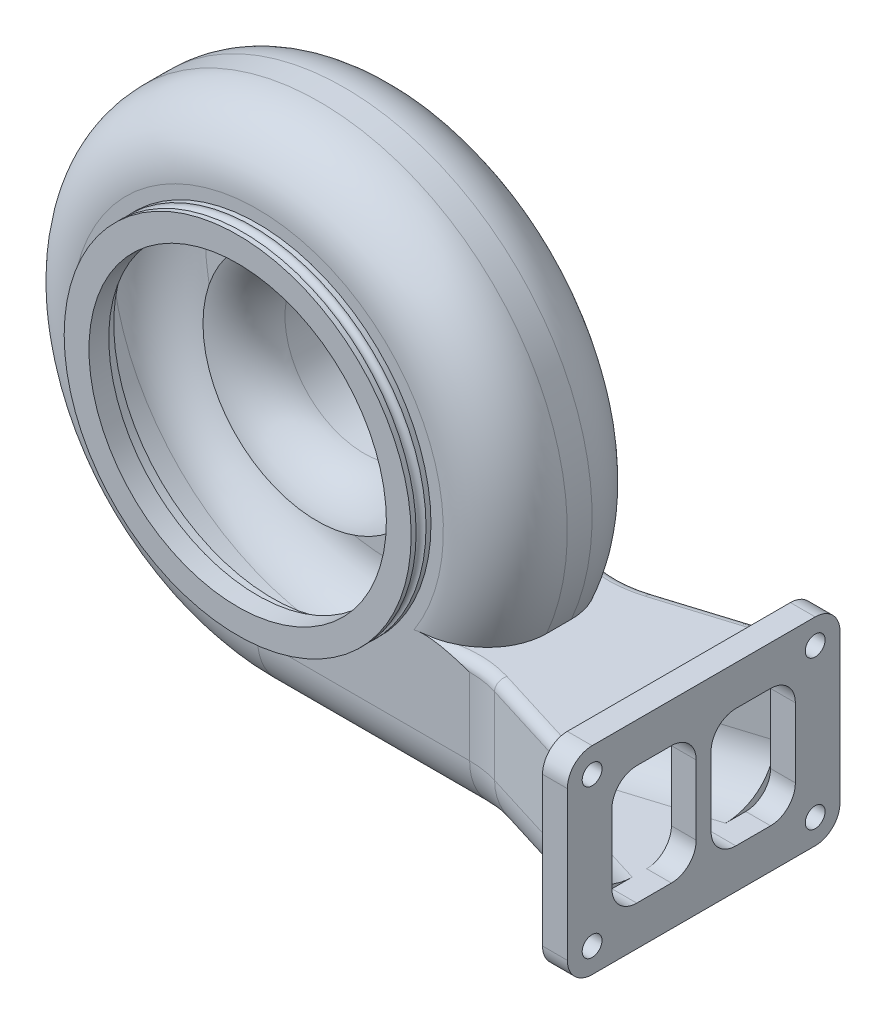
ISO-10303-21;
HEADER;
FILE_DESCRIPTION(('STEP AP214'),'2;1');
FILE_NAME('part.step','',(''),(''),'','','');
FILE_SCHEMA(('AUTOMOTIVE_DESIGN { 1 0 10303 214 1 1 1 1 }'));
ENDSEC;
DATA;
#1=APPLICATION_CONTEXT('core data for automotive mechanical design processes');
#2=APPLICATION_PROTOCOL_DEFINITION('international standard','automotive_design',2000,#1);
#3=PRODUCT_CONTEXT('',#1,'mechanical');
#4=PRODUCT('Part','Part','',(#3));
#5=PRODUCT_RELATED_PRODUCT_CATEGORY('part','',(#4));
#6=PRODUCT_DEFINITION_FORMATION('','',#4);
#7=PRODUCT_DEFINITION_CONTEXT('part definition',#1,'design');
#8=PRODUCT_DEFINITION('design','',#6,#7);
#9=PRODUCT_DEFINITION_SHAPE('','',#8);
#10=(LENGTH_UNIT() NAMED_UNIT(*) SI_UNIT(.MILLI.,.METRE.));
#11=(NAMED_UNIT(*) PLANE_ANGLE_UNIT() SI_UNIT($,.RADIAN.));
#12=(NAMED_UNIT(*) SI_UNIT($,.STERADIAN.) SOLID_ANGLE_UNIT());
#13=UNCERTAINTY_MEASURE_WITH_UNIT(LENGTH_MEASURE(1.E-05),#10,'distance_accuracy_value','');
#14=(GEOMETRIC_REPRESENTATION_CONTEXT(3) GLOBAL_UNCERTAINTY_ASSIGNED_CONTEXT((#13)) GLOBAL_UNIT_ASSIGNED_CONTEXT((#10,
#11,#12)) REPRESENTATION_CONTEXT('',''));
#15=CARTESIAN_POINT('',(0.,0.,0.));
#16=DIRECTION('',(0.,0.,1.));
#17=DIRECTION('',(1.,0.,0.));
#18=AXIS2_PLACEMENT_3D('',#15,#16,#17);
#19=CARTESIAN_POINT('',(0.,0.,-15.));
#20=DIRECTION('',(0.,0.,-1.));
#21=DIRECTION('',(-1.,0.,0.));
#22=AXIS2_PLACEMENT_3D('',#19,#20,#21);
#23=PLANE('',#22);
#24=CARTESIAN_POINT('',(0.,0.,-15.));
#25=DIRECTION('',(0.,0.,-1.));
#26=DIRECTION('',(-1.,0.,0.));
#27=AXIS2_PLACEMENT_3D('',#24,#25,#26);
#28=CIRCLE('',#27,19.);
#29=CARTESIAN_POINT('',(-19.,0.,-15.));
#30=VERTEX_POINT('',#29);
#31=EDGE_CURVE('E573',#30,#30,#28,.T.);
#32=ORIENTED_EDGE('',*,*,#31,.T.);
#33=EDGE_LOOP('',(#32));
#34=FACE_BOUND('',#33,.T.);
#35=CARTESIAN_POINT('',(0.,0.,-15.));
#36=DIRECTION('',(0.,0.,-1.));
#37=DIRECTION('',(-1.,0.,0.));
#38=AXIS2_PLACEMENT_3D('',#35,#36,#37);
#39=CIRCLE('',#38,16.);
#40=CARTESIAN_POINT('',(-16.,0.,-15.));
#41=VERTEX_POINT('',#40);
#42=EDGE_CURVE('E440',#41,#41,#39,.T.);
#43=ORIENTED_EDGE('',*,*,#42,.F.);
#44=EDGE_LOOP('',(#43));
#45=FACE_BOUND('',#44,.T.);
#46=ADVANCED_FACE('F37',(#34,#45),#23,.T.);
#47=CARTESIAN_POINT('',(0.,0.,34.));
#48=DIRECTION('',(0.,0.,-1.));
#49=DIRECTION('',(-1.,0.,0.));
#50=AXIS2_PLACEMENT_3D('',#47,#48,#49);
#51=CYLINDRICAL_SURFACE('',#50,35.);
#52=CARTESIAN_POINT('',(0.,0.,31.));
#53=DIRECTION('',(0.,0.,1.));
#54=DIRECTION('',(1.,0.,0.));
#55=AXIS2_PLACEMENT_3D('',#52,#53,#54);
#56=CIRCLE('',#55,35.);
#57=CARTESIAN_POINT('',(35.,0.,31.));
#58=VERTEX_POINT('',#57);
#59=EDGE_CURVE('E558',#58,#58,#56,.F.);
#60=ORIENTED_EDGE('',*,*,#59,.T.);
#61=EDGE_LOOP('',(#60));
#62=FACE_BOUND('',#61,.T.);
#63=CARTESIAN_POINT('',(0.,0.,30.));
#64=DIRECTION('',(0.,0.,1.));
#65=DIRECTION('',(1.,0.,0.));
#66=AXIS2_PLACEMENT_3D('',#63,#64,#65);
#67=CIRCLE('',#66,35.);
#68=CARTESIAN_POINT('',(35.,0.,30.));
#69=VERTEX_POINT('',#68);
#70=EDGE_CURVE('E583',#69,#69,#67,.T.);
#71=ORIENTED_EDGE('',*,*,#70,.T.);
#72=EDGE_LOOP('',(#71));
#73=FACE_BOUND('',#72,.T.);
#74=ADVANCED_FACE('F860',(#62,#73),#51,.T.);
#75=CARTESIAN_POINT('',(0.,0.,30.));
#76=DIRECTION('',(0.,0.,1.));
#77=DIRECTION('',(1.,0.,0.));
#78=AXIS2_PLACEMENT_3D('',#75,#76,#77);
#79=PLANE('',#78);
#80=CARTESIAN_POINT('',(0.,0.,30.));
#81=DIRECTION('',(0.,0.,1.));
#82=DIRECTION('',(1.,0.,0.));
#83=AXIS2_PLACEMENT_3D('',#80,#81,#82);
#84=CIRCLE('',#83,37.5);
#85=CARTESIAN_POINT('',(31.5749678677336,-20.2304573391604,30.));
#86=VERTEX_POINT('',#85);
#87=CARTESIAN_POINT('',(0.,-37.5,30.));
#88=VERTEX_POINT('',#87);
#89=EDGE_CURVE('E848',#86,#88,#84,.T.);
#90=ORIENTED_EDGE('',*,*,#89,.T.);
#91=DIRECTION('',(1.,0.,0.));
#92=VECTOR('',#91,1.);
#93=CARTESIAN_POINT('',(42.7945469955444,-37.5,30.));
#94=LINE('',#93,#92);
#95=CARTESIAN_POINT('',(42.7945469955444,-37.5,30.));
#96=VERTEX_POINT('',#95);
#97=EDGE_CURVE('E1093',#88,#96,#94,.T.);
#98=ORIENTED_EDGE('',*,*,#97,.T.);
#99=DIRECTION('',(0.,-1.,0.));
#100=VECTOR('',#99,1.);
#101=CARTESIAN_POINT('',(42.7945469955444,-20.,30.));
#102=LINE('',#101,#100);
#103=CARTESIAN_POINT('',(42.7945469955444,-22.,30.));
#104=VERTEX_POINT('',#103);
#105=EDGE_CURVE('E790',#96,#104,#102,.F.);
#106=ORIENTED_EDGE('',*,*,#105,.T.);
#107=CARTESIAN_POINT('',(31.5749678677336,-20.2304573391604,30.));
#108=CARTESIAN_POINT('',(31.6869708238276,-20.2016266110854,30.));
#109=CARTESIAN_POINT('',(31.7997778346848,-20.1761019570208,30.));
#110=CARTESIAN_POINT('',(32.0265018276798,-20.1309895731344,30.));
#111=CARTESIAN_POINT('',(32.1404180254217,-20.1113979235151,30.));
#112=CARTESIAN_POINT('',(32.3686858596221,-20.0774883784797,30.));
#113=CARTESIAN_POINT('',(32.4830353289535,-20.0631556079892,30.));
#114=CARTESIAN_POINT('',(32.71223513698,-20.0391473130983,30.));
#115=CARTESIAN_POINT('',(32.827085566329,-20.0294726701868,30.));
#116=CARTESIAN_POINT('',(33.1688844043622,-20.0069332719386,30.));
#117=CARTESIAN_POINT('',(33.3962412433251,-20.000114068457,30.));
#118=CARTESIAN_POINT('',(33.8510737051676,-19.99988879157,30.));
#119=CARTESIAN_POINT('',(34.0785492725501,-20.0064937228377,30.));
#120=CARTESIAN_POINT('',(34.4857773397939,-20.0284237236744,30.));
#121=CARTESIAN_POINT('',(34.6656487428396,-20.0416575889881,30.));
#122=CARTESIAN_POINT('',(35.0248347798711,-20.0743216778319,30.));
#123=CARTESIAN_POINT('',(35.204149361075,-20.0937524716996,30.));
#124=CARTESIAN_POINT('',(35.7412433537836,-20.1602009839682,30.));
#125=CARTESIAN_POINT('',(36.098021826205,-20.2153653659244,30.));
#126=CARTESIAN_POINT('',(36.8090895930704,-20.3425880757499,30.));
#127=CARTESIAN_POINT('',(37.1633735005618,-20.414675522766,30.));
#128=CARTESIAN_POINT('',(37.8689355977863,-20.5718353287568,30.));
#129=CARTESIAN_POINT('',(38.2202144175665,-20.6569048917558,30.));
#130=CARTESIAN_POINT('',(38.9237530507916,-20.8377564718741,30.));
#131=CARTESIAN_POINT('',(39.275986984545,-20.9336379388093,30.));
#132=CARTESIAN_POINT('',(39.9784285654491,-21.1325918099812,30.));
#133=CARTESIAN_POINT('',(40.3286360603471,-21.2356647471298,30.));
#134=CARTESIAN_POINT('',(41.3765209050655,-21.5516630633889,30.));
#135=CARTESIAN_POINT('',(42.0720797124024,-21.7715368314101,29.9999999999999));
#136=CARTESIAN_POINT('',(42.7765683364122,-21.9943146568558,30.));
#137=CARTESIAN_POINT('',(42.7855576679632,-21.9971573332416,30.));
#138=CARTESIAN_POINT('',(42.7945469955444,-22.,30.));
#139=B_SPLINE_CURVE_WITH_KNOTS('',3,(#107,#108,#109,#110,#111,#112,#113,#114,#115,#116,#117,
#118,#119,#120,#121,#122,#123,#124,#125,#126,#127,#128,#129,#130,#131,#132,#133,#134,#135,#136,
#137,#138),.UNSPECIFIED.,.F.,.F.,(4,2,2,2,2,2,2,2,2,2,2,2,2,2,2,4),(0.,0.346846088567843,
0.693462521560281,1.03909082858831,1.38478451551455,2.06662288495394,2.74902042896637,
3.28997578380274,3.83098094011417,4.91344486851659,5.99778520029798,7.08189232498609,
8.17694073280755,9.27207037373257,11.4604053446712,11.4886896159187),.UNSPECIFIED.);
#140=EDGE_CURVE('E840',#104,#86,#139,.F.);
#141=ORIENTED_EDGE('',*,*,#140,.T.);
#142=EDGE_LOOP('',(#90,#98,#106,#141));
#143=FACE_BOUND('',#142,.T.);
#144=ORIENTED_EDGE('',*,*,#70,.F.);
#145=EDGE_LOOP('',(#144));
#146=FACE_BOUND('',#145,.T.);
#147=ADVANCED_FACE('F854',(#143,#146),#79,.T.);
#148=CARTESIAN_POINT('',(0.,0.,30.));
#149=DIRECTION('',(0.,0.,-1.));
#150=DIRECTION('',(-1.,0.,0.));
#151=AXIS2_PLACEMENT_3D('',#148,#149,#150);
#152=CYLINDRICAL_SURFACE('',#151,50.);
#153=DIRECTION('',(0.,0.,-1.));
#154=VECTOR('',#153,1.);
#155=CARTESIAN_POINT('',(0.,-50.,30.));
#156=LINE('',#155,#154);
#157=CARTESIAN_POINT('',(0.,-50.,17.5));
#158=VERTEX_POINT('',#157);
#159=CARTESIAN_POINT('',(0.,-50.,12.5));
#160=VERTEX_POINT('',#159);
#161=EDGE_CURVE('E779',#158,#160,#156,.T.);
#162=ORIENTED_EDGE('',*,*,#161,.F.);
#163=CARTESIAN_POINT('',(0.,0.,17.5));
#164=DIRECTION('',(0.,0.,1.));
#165=DIRECTION('',(1.,0.,0.));
#166=AXIS2_PLACEMENT_3D('',#163,#164,#165);
#167=CIRCLE('',#166,50.);
#168=CARTESIAN_POINT('',(45.8257569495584,-20.,17.5));
#169=VERTEX_POINT('',#168);
#170=EDGE_CURVE('E1104',#158,#169,#167,.F.);
#171=ORIENTED_EDGE('',*,*,#170,.T.);
#172=DIRECTION('',(0.,0.,-1.));
#173=VECTOR('',#172,1.);
#174=CARTESIAN_POINT('',(45.8257569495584,-20.,30.));
#175=LINE('',#174,#173);
#176=CARTESIAN_POINT('',(45.8257569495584,-20.,12.5));
#177=VERTEX_POINT('',#176);
#178=EDGE_CURVE('E770',#169,#177,#175,.T.);
#179=ORIENTED_EDGE('',*,*,#178,.T.);
#180=CARTESIAN_POINT('',(0.,0.,12.5));
#181=DIRECTION('',(0.,0.,1.));
#182=DIRECTION('',(1.,0.,0.));
#183=AXIS2_PLACEMENT_3D('',#180,#181,#182);
#184=CIRCLE('',#183,50.);
#185=EDGE_CURVE('E1133',#177,#160,#184,.T.);
#186=ORIENTED_EDGE('',*,*,#185,.T.);
#187=EDGE_LOOP('',(#162,#171,#179,#186));
#188=FACE_BOUND('',#187,.T.);
#189=ADVANCED_FACE('F859',(#188),#152,.T.);
#190=CARTESIAN_POINT('',(0.,-50.,30.));
#191=DIRECTION('',(0.,1.,0.));
#192=DIRECTION('',(0.,0.,1.));
#193=AXIS2_PLACEMENT_3D('',#190,#191,#192);
#194=PLANE('',#193);
#195=DIRECTION('',(0.,0.,-1.));
#196=VECTOR('',#195,1.);
#197=CARTESIAN_POINT('',(70.,-50.,30.));
#198=LINE('',#197,#196);
#199=CARTESIAN_POINT('',(70.,-50.,24.4122340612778));
#200=VERTEX_POINT('',#199);
#201=CARTESIAN_POINT('',(70.,-50.,5.58776593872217));
#202=VERTEX_POINT('',#201);
#203=EDGE_CURVE('E776',#200,#202,#198,.T.);
#204=ORIENTED_EDGE('',*,*,#203,.F.);
#205=DIRECTION('',(-0.955090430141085,0.,-0.296314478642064));
#206=VECTOR('',#205,1.);
#207=CARTESIAN_POINT('',(52.4247675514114,-50.,18.9595610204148));
#208=LINE('',#207,#206);
#209=CARTESIAN_POINT('',(52.4247675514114,-50.,18.9595610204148));
#210=VERTEX_POINT('',#209);
#211=EDGE_CURVE('E833',#200,#210,#208,.T.);
#212=ORIENTED_EDGE('',*,*,#211,.T.);
#213=CARTESIAN_POINT('',(42.7945469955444,-50.,50.));
#214=DIRECTION('',(0.,1.,0.));
#215=DIRECTION('',(0.,0.,1.));
#216=AXIS2_PLACEMENT_3D('',#213,#214,#215);
#217=CIRCLE('',#216,32.5);
#218=CARTESIAN_POINT('',(42.7945469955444,-50.,17.5));
#219=VERTEX_POINT('',#218);
#220=EDGE_CURVE('E831',#210,#219,#217,.T.);
#221=ORIENTED_EDGE('',*,*,#220,.T.);
#222=DIRECTION('',(1.,0.,0.));
#223=VECTOR('',#222,1.);
#224=CARTESIAN_POINT('',(0.,-50.,17.5));
#225=LINE('',#224,#223);
#226=EDGE_CURVE('E829',#219,#158,#225,.F.);
#227=ORIENTED_EDGE('',*,*,#226,.T.);
#228=ORIENTED_EDGE('',*,*,#161,.T.);
#229=DIRECTION('',(1.,0.,0.));
#230=VECTOR('',#229,1.);
#231=CARTESIAN_POINT('',(0.,-50.,12.5));
#232=LINE('',#231,#230);
#233=CARTESIAN_POINT('',(42.7945469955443,-50.,12.5));
#234=VERTEX_POINT('',#233);
#235=EDGE_CURVE('E817',#160,#234,#232,.T.);
#236=ORIENTED_EDGE('',*,*,#235,.T.);
#237=CARTESIAN_POINT('',(42.7945469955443,-50.,-20.));
#238=DIRECTION('',(0.,1.,0.));
#239=DIRECTION('',(0.,0.,1.));
#240=AXIS2_PLACEMENT_3D('',#237,#238,#239);
#241=CIRCLE('',#240,32.5);
#242=CARTESIAN_POINT('',(52.4247675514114,-50.,11.0404389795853));
#243=VERTEX_POINT('',#242);
#244=EDGE_CURVE('E824',#234,#243,#241,.T.);
#245=ORIENTED_EDGE('',*,*,#244,.T.);
#246=DIRECTION('',(0.955090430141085,0.,-0.296314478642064));
#247=VECTOR('',#246,1.);
#248=CARTESIAN_POINT('',(73.7039309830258,-50.,4.43863037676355));
#249=LINE('',#248,#247);
#250=EDGE_CURVE('E826',#243,#202,#249,.T.);
#251=ORIENTED_EDGE('',*,*,#250,.T.);
#252=EDGE_LOOP('',(#204,#212,#221,#227,#228,#236,#245,#251));
#253=FACE_BOUND('',#252,.T.);
#254=ADVANCED_FACE('F1820',(#253),#194,.F.);
#255=CARTESIAN_POINT('',(45.8257569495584,-20.,30.));
#256=DIRECTION('',(0.,-1.,0.));
#257=DIRECTION('',(0.,0.,-1.));
#258=AXIS2_PLACEMENT_3D('',#255,#256,#257);
#259=PLANE('',#258);
#260=ORIENTED_EDGE('',*,*,#178,.F.);
#261=CARTESIAN_POINT('',(45.8257569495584,-20.,17.5));
#262=CARTESIAN_POINT('',(45.8257574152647,-20.,17.6643438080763));
#263=CARTESIAN_POINT('',(45.8222200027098,-20.,17.8286667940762));
#264=CARTESIAN_POINT('',(45.8080842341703,-20.,18.1570070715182));
#265=CARTESIAN_POINT('',(45.7974859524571,-20.,18.3210243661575));
#266=CARTESIAN_POINT('',(45.7551332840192,-20.,18.8120949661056));
#267=CARTESIAN_POINT('',(45.7128210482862,-20.,19.1382997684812));
#268=CARTESIAN_POINT('',(45.6005835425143,-20.,19.7851627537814));
#269=CARTESIAN_POINT('',(45.5307168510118,-20.,20.105831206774));
#270=CARTESIAN_POINT('',(45.3640524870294,-20.,20.7401015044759));
#271=CARTESIAN_POINT('',(45.2672544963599,-20.,21.0537032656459));
#272=CARTESIAN_POINT('',(45.0476840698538,-20.,21.6715910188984));
#273=CARTESIAN_POINT('',(44.9249171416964,-20.,21.9758789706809));
#274=CARTESIAN_POINT('',(44.6545429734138,-20.,22.5732151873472));
#275=CARTESIAN_POINT('',(44.5069347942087,-20.,22.8662630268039));
#276=CARTESIAN_POINT('',(44.1882573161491,-20.,23.4392132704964));
#277=CARTESIAN_POINT('',(44.0171932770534,-20.,23.7191186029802));
#278=CARTESIAN_POINT('',(43.6530735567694,-20.,24.2642271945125));
#279=CARTESIAN_POINT('',(43.4600176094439,-20.,24.5294302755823));
#280=CARTESIAN_POINT('',(43.0480244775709,-20.,25.0506783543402));
#281=CARTESIAN_POINT('',(42.828528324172,-20.,25.3062813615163));
#282=CARTESIAN_POINT('',(42.3698811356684,-20.,25.7991857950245));
#283=CARTESIAN_POINT('',(42.1307295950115,-20.,26.0364867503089));
#284=CARTESIAN_POINT('',(41.6343505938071,-20.,26.4920222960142));
#285=CARTESIAN_POINT('',(41.3770999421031,-20.,26.7102315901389));
#286=CARTESIAN_POINT('',(40.8467163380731,-20.,27.1264204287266));
#287=CARTESIAN_POINT('',(40.5735820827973,-20.,27.3243983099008));
#288=CARTESIAN_POINT('',(39.9914182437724,-20.,27.7141941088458));
#289=CARTESIAN_POINT('',(39.6812526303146,-20.,27.9043158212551));
#290=CARTESIAN_POINT('',(39.0470127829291,-20.,28.259845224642));
#291=CARTESIAN_POINT('',(38.7229357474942,-20.,28.4252479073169));
#292=CARTESIAN_POINT('',(38.0641350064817,-20.,28.7306201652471));
#293=CARTESIAN_POINT('',(37.7294433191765,-20.,28.8706590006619));
#294=CARTESIAN_POINT('',(37.0508751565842,-20.,29.1258173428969));
#295=CARTESIAN_POINT('',(36.7070034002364,-20.,29.2409493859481));
#296=CARTESIAN_POINT('',(36.3595274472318,-20.,29.3436742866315));
#297=B_SPLINE_CURVE_WITH_KNOTS('',3,(#261,#262,#263,#264,#265,#266,#267,#268,#269,#270,#271,
#272,#273,#274,#275,#276,#277,#278,#279,#280,#281,#282,#283,#284,#285,#286,#287,#288,#289,#290,
#291,#292,#293,#294,#295,#296),.UNSPECIFIED.,.F.,.F.,(4,2,2,2,2,2,2,2,2,2,2,2,2,2,2,2,2,4),(0.,
0.49295188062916,0.985898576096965,1.97139495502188,2.95480744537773,3.93823155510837,
4.92144730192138,5.90470022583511,6.88773302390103,7.87077771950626,8.8804227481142,
9.89009375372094,10.9010829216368,11.9121551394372,13.0023970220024,14.0928594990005,
15.1802978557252,16.2671875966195),.UNSPECIFIED.);
#298=CARTESIAN_POINT('',(38.8497534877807,-20.,28.3565574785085));
#299=VERTEX_POINT('',#298);
#300=EDGE_CURVE('E1131',#169,#299,#297,.T.);
#301=ORIENTED_EDGE('',*,*,#300,.T.);
#302=CARTESIAN_POINT('',(42.7945469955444,-20.,50.));
#303=DIRECTION('',(0.,-1.,0.));
#304=DIRECTION('',(0.,0.,-1.));
#305=AXIS2_PLACEMENT_3D('',#302,#303,#304);
#306=CIRCLE('',#305,22.);
#307=CARTESIAN_POINT('',(49.3134655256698,-20.,28.9880105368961));
#308=VERTEX_POINT('',#307);
#309=EDGE_CURVE('E798',#299,#308,#306,.T.);
#310=ORIENTED_EDGE('',*,*,#309,.T.);
#311=DIRECTION('',(0.955090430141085,0.,0.296314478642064));
#312=VECTOR('',#311,1.);
#313=CARTESIAN_POINT('',(70.5926289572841,-20.,35.5898191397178));
#314=LINE('',#313,#312);
#315=CARTESIAN_POINT('',(70.,-20.,35.4059574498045));
#316=VERTEX_POINT('',#315);
#317=EDGE_CURVE('E796',#308,#316,#314,.T.);
#318=ORIENTED_EDGE('',*,*,#317,.T.);
#319=DIRECTION('',(0.,0.,-1.));
#320=VECTOR('',#319,1.);
#321=CARTESIAN_POINT('',(70.,-20.,30.));
#322=LINE('',#321,#320);
#323=CARTESIAN_POINT('',(70.,-20.,-5.40595744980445));
#324=VERTEX_POINT('',#323);
#325=EDGE_CURVE('E773',#316,#324,#322,.T.);
#326=ORIENTED_EDGE('',*,*,#325,.T.);
#327=DIRECTION('',(-0.955090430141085,0.,0.296314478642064));
#328=VECTOR('',#327,1.);
#329=CARTESIAN_POINT('',(49.3134655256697,-20.,1.01198946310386));
#330=LINE('',#329,#328);
#331=CARTESIAN_POINT('',(49.3134655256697,-20.,1.01198946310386));
#332=VERTEX_POINT('',#331);
#333=EDGE_CURVE('E793',#324,#332,#330,.T.);
#334=ORIENTED_EDGE('',*,*,#333,.T.);
#335=CARTESIAN_POINT('',(42.7945469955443,-20.,-20.));
#336=DIRECTION('',(0.,-1.,0.));
#337=DIRECTION('',(0.,0.,-1.));
#338=AXIS2_PLACEMENT_3D('',#335,#336,#337);
#339=CIRCLE('',#338,22.);
#340=CARTESIAN_POINT('',(38.8497534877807,-20.,1.64344252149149));
#341=VERTEX_POINT('',#340);
#342=EDGE_CURVE('E59',#332,#341,#339,.T.);
#343=ORIENTED_EDGE('',*,*,#342,.T.);
#344=CARTESIAN_POINT('',(45.8257569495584,-20.,12.5));
#345=CARTESIAN_POINT('',(45.8257574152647,-20.,12.3356561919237));
#346=CARTESIAN_POINT('',(45.8222200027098,-20.,12.1713332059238));
#347=CARTESIAN_POINT('',(45.8080842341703,-20.,11.8429929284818));
#348=CARTESIAN_POINT('',(45.7974859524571,-20.,11.6789756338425));
#349=CARTESIAN_POINT('',(45.7551332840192,-20.,11.1879050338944));
#350=CARTESIAN_POINT('',(45.7128210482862,-20.,10.8617002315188));
#351=CARTESIAN_POINT('',(45.6005835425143,-20.,10.2148372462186));
#352=CARTESIAN_POINT('',(45.5307168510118,-20.,9.89416879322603));
#353=CARTESIAN_POINT('',(45.3640524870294,-20.,9.25989849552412));
#354=CARTESIAN_POINT('',(45.2672544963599,-20.,8.94629673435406));
#355=CARTESIAN_POINT('',(45.0476840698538,-20.,8.3284089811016));
#356=CARTESIAN_POINT('',(44.9249171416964,-20.,8.02412102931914));
#357=CARTESIAN_POINT('',(44.6545429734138,-20.,7.42678481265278));
#358=CARTESIAN_POINT('',(44.5069347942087,-20.,7.13373697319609));
#359=CARTESIAN_POINT('',(44.1882573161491,-20.,6.56078672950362));
#360=CARTESIAN_POINT('',(44.0171932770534,-20.,6.28088139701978));
#361=CARTESIAN_POINT('',(43.6530735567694,-20.,5.73577280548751));
#362=CARTESIAN_POINT('',(43.4600176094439,-20.,5.47056972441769));
#363=CARTESIAN_POINT('',(43.0480244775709,-20.,4.94932164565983));
#364=CARTESIAN_POINT('',(42.828528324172,-20.,4.69371863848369));
#365=CARTESIAN_POINT('',(42.3698811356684,-20.,4.20081420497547));
#366=CARTESIAN_POINT('',(42.1307295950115,-20.,3.9635132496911));
#367=CARTESIAN_POINT('',(41.6343505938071,-20.,3.5079777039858));
#368=CARTESIAN_POINT('',(41.3770999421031,-20.,3.28976840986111));
#369=CARTESIAN_POINT('',(40.8467163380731,-20.,2.87357957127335));
#370=CARTESIAN_POINT('',(40.5735820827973,-20.,2.67560169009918));
#371=CARTESIAN_POINT('',(39.9914182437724,-20.,2.28580589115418));
#372=CARTESIAN_POINT('',(39.6812526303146,-20.,2.09568417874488));
#373=CARTESIAN_POINT('',(39.0470127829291,-20.,1.74015477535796));
#374=CARTESIAN_POINT('',(38.7229357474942,-20.,1.57475209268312));
#375=CARTESIAN_POINT('',(38.0641350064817,-20.,1.26937983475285));
#376=CARTESIAN_POINT('',(37.7294433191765,-20.,1.12934099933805));
#377=CARTESIAN_POINT('',(37.0508751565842,-20.,0.874182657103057));
#378=CARTESIAN_POINT('',(36.7070034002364,-20.,0.759050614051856));
#379=CARTESIAN_POINT('',(36.3595274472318,-20.,0.656325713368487));
#380=B_SPLINE_CURVE_WITH_KNOTS('',3,(#344,#345,#346,#347,#348,#349,#350,#351,#352,#353,#354,
#355,#356,#357,#358,#359,#360,#361,#362,#363,#364,#365,#366,#367,#368,#369,#370,#371,#372,#373,
#374,#375,#376,#377,#378,#379),.UNSPECIFIED.,.F.,.F.,(4,2,2,2,2,2,2,2,2,2,2,2,2,2,2,2,2,4),(0.,
0.492951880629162,0.985898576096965,1.97139495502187,2.95480744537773,3.93823155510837,
4.92144730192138,5.90470022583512,6.88773302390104,7.87077771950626,8.88042274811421,
9.89009375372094,10.9010829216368,11.9121551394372,13.0023970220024,14.0928594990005,
15.1802978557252,16.2671875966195),.UNSPECIFIED.);
#381=EDGE_CURVE('E904',#341,#177,#380,.F.);
#382=ORIENTED_EDGE('',*,*,#381,.T.);
#383=EDGE_LOOP('',(#260,#301,#310,#318,#326,#334,#343,#382));
#384=FACE_BOUND('',#383,.T.);
#385=ADVANCED_FACE('F868',(#384),#259,.F.);
#386=CARTESIAN_POINT('',(0.,0.,0.));
#387=DIRECTION('',(0.,0.,1.));
#388=DIRECTION('',(1.,0.,0.));
#389=AXIS2_PLACEMENT_3D('',#386,#387,#388);
#390=PLANE('',#389);
#391=CARTESIAN_POINT('',(0.,0.,0.));
#392=DIRECTION('',(0.,0.,1.));
#393=DIRECTION('',(1.,0.,0.));
#394=AXIS2_PLACEMENT_3D('',#391,#392,#393);
#395=CIRCLE('',#394,32.5);
#396=CARTESIAN_POINT('',(32.5,0.,0.));
#397=VERTEX_POINT('',#396);
#398=EDGE_CURVE('E1886',#397,#397,#395,.T.);
#399=ORIENTED_EDGE('',*,*,#398,.T.);
#400=EDGE_LOOP('',(#399));
#401=FACE_BOUND('',#400,.T.);
#402=DIRECTION('',(0.,-1.,0.));
#403=VECTOR('',#402,1.);
#404=CARTESIAN_POINT('',(42.7945469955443,0.,0.));
#405=LINE('',#404,#403);
#406=CARTESIAN_POINT('',(42.7945469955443,-22.,0.));
#407=VERTEX_POINT('',#406);
#408=CARTESIAN_POINT('',(42.7945469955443,-37.5,0.));
#409=VERTEX_POINT('',#408);
#410=EDGE_CURVE('E782',#407,#409,#405,.T.);
#411=ORIENTED_EDGE('',*,*,#410,.T.);
#412=DIRECTION('',(1.,0.,0.));
#413=VECTOR('',#412,1.);
#414=CARTESIAN_POINT('',(0.,-37.5,0.));
#415=LINE('',#414,#413);
#416=CARTESIAN_POINT('',(0.,-37.5,0.));
#417=VERTEX_POINT('',#416);
#418=EDGE_CURVE('E1890',#409,#417,#415,.F.);
#419=ORIENTED_EDGE('',*,*,#418,.T.);
#420=CARTESIAN_POINT('',(0.,0.,0.));
#421=DIRECTION('',(0.,0.,1.));
#422=DIRECTION('',(1.,0.,0.));
#423=AXIS2_PLACEMENT_3D('',#420,#421,#422);
#424=CIRCLE('',#423,37.5);
#425=CARTESIAN_POINT('',(31.5749678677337,-20.2304573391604,0.));
#426=VERTEX_POINT('',#425);
#427=EDGE_CURVE('E880',#417,#426,#424,.F.);
#428=ORIENTED_EDGE('',*,*,#427,.T.);
#429=CARTESIAN_POINT('',(31.5749678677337,-20.2304573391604,0.));
#430=CARTESIAN_POINT('',(31.6869708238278,-20.2016266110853,0.));
#431=CARTESIAN_POINT('',(31.7997778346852,-20.1761019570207,0.));
#432=CARTESIAN_POINT('',(32.0265018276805,-20.1309895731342,0.));
#433=CARTESIAN_POINT('',(32.1404180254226,-20.1113979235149,0.));
#434=CARTESIAN_POINT('',(32.3686858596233,-20.0774883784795,0.));
#435=CARTESIAN_POINT('',(32.4830353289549,-20.063155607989,0.));
#436=CARTESIAN_POINT('',(32.7122351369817,-20.0391473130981,0.));
#437=CARTESIAN_POINT('',(32.8270855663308,-20.0294726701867,0.));
#438=CARTESIAN_POINT('',(33.1688844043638,-20.0069332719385,0.));
#439=CARTESIAN_POINT('',(33.3962412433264,-20.000114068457,0.));
#440=CARTESIAN_POINT('',(33.8510737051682,-19.99988879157,0.));
#441=CARTESIAN_POINT('',(34.0785492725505,-20.0064937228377,0.));
#442=CARTESIAN_POINT('',(34.4857773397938,-20.0284237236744,0.));
#443=CARTESIAN_POINT('',(34.6656487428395,-20.041657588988,0.));
#444=CARTESIAN_POINT('',(35.0248347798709,-20.0743216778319,0.));
#445=CARTESIAN_POINT('',(35.2041493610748,-20.0937524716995,0.));
#446=CARTESIAN_POINT('',(35.7412433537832,-20.1602009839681,0.));
#447=CARTESIAN_POINT('',(36.0980218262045,-20.2153653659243,0.));
#448=CARTESIAN_POINT('',(36.8090895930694,-20.3425880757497,0.));
#449=CARTESIAN_POINT('',(37.1633735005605,-20.4146755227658,0.));
#450=CARTESIAN_POINT('',(37.8689355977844,-20.5718353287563,0.));
#451=CARTESIAN_POINT('',(38.2202144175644,-20.6569048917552,0.));
#452=CARTESIAN_POINT('',(38.9237530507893,-20.8377564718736,0.));
#453=CARTESIAN_POINT('',(39.2759869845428,-20.9336379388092,0.));
#454=CARTESIAN_POINT('',(39.9784285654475,-21.1325918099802,0.));
#455=CARTESIAN_POINT('',(40.3286360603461,-21.2356647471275,0.));
#456=CARTESIAN_POINT('',(41.3765209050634,-21.5516630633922,0.));
#457=CARTESIAN_POINT('',(42.0720797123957,-21.7715368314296,0.));
#458=CARTESIAN_POINT('',(42.776568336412,-21.9943146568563,0.));
#459=CARTESIAN_POINT('',(42.7855576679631,-21.9971573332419,0.));
#460=CARTESIAN_POINT('',(42.7945469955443,-22.,0.));
#461=B_SPLINE_CURVE_WITH_KNOTS('',3,(#429,#430,#431,#432,#433,#434,#435,#436,#437,#438,#439,
#440,#441,#442,#443,#444,#445,#446,#447,#448,#449,#450,#451,#452,#453,#454,#455,#456,#457,#458,
#459,#460),.UNSPECIFIED.,.F.,.F.,(4,2,2,2,2,2,2,2,2,2,2,2,2,2,2,4),(0.,0.346846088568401,
0.693462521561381,1.03909082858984,1.3847845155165,2.06662288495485,2.74902042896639,
3.28997578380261,3.83098094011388,4.91344486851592,5.99778520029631,7.08189232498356,
8.1769407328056,9.27207037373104,11.4604053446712,11.4886896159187),.UNSPECIFIED.);
#462=EDGE_CURVE('E873',#426,#407,#461,.T.);
#463=ORIENTED_EDGE('',*,*,#462,.T.);
#464=EDGE_LOOP('',(#411,#419,#428,#463));
#465=FACE_BOUND('',#464,.T.);
#466=ADVANCED_FACE('F864',(#401,#465),#390,.F.);
#467=CARTESIAN_POINT('',(70.,5.31094678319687,37.5));
#468=DIRECTION('',(-0.296314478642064,0.,0.955090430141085));
#469=DIRECTION('',(0.955090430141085,0.,0.296314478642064));
#470=AXIS2_PLACEMENT_3D('',#467,#468,#469);
#471=PLANE('',#470);
#472=DIRECTION('',(0.,-1.,0.));
#473=VECTOR('',#472,1.);
#474=CARTESIAN_POINT('',(48.7208365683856,-50.,30.8981913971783));
#475=LINE('',#474,#473);
#476=CARTESIAN_POINT('',(48.7208365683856,-22.,30.8981913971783));
#477=VERTEX_POINT('',#476);
#478=CARTESIAN_POINT('',(48.7208365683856,-37.5,30.8981913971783));
#479=VERTEX_POINT('',#478);
#480=EDGE_CURVE('E787',#477,#479,#475,.T.);
#481=ORIENTED_EDGE('',*,*,#480,.T.);
#482=DIRECTION('',(-0.955090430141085,0.,-0.296314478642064));
#483=VECTOR('',#482,1.);
#484=CARTESIAN_POINT('',(70.,-37.5,37.5));
#485=LINE('',#484,#483);
#486=CARTESIAN_POINT('',(70.,-37.5,37.5));
#487=VERTEX_POINT('',#486);
#488=EDGE_CURVE('E836',#479,#487,#485,.F.);
#489=ORIENTED_EDGE('',*,*,#488,.T.);
#490=DIRECTION('',(0.,-1.,0.));
#491=VECTOR('',#490,1.);
#492=CARTESIAN_POINT('',(70.,5.31094678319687,37.5));
#493=LINE('',#492,#491);
#494=CARTESIAN_POINT('',(70.,-22.,37.5));
#495=VERTEX_POINT('',#494);
#496=EDGE_CURVE('E767',#495,#487,#493,.T.);
#497=ORIENTED_EDGE('',*,*,#496,.F.);
#498=DIRECTION('',(0.955090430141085,0.,0.296314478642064));
#499=VECTOR('',#498,1.);
#500=CARTESIAN_POINT('',(48.7208365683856,-22.,30.8981913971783));
#501=LINE('',#500,#499);
#502=EDGE_CURVE('E807',#495,#477,#501,.F.);
#503=ORIENTED_EDGE('',*,*,#502,.T.);
#504=EDGE_LOOP('',(#481,#489,#497,#503));
#505=FACE_BOUND('',#504,.T.);
#506=ADVANCED_FACE('F862',(#505),#471,.T.);
#507=CARTESIAN_POINT('',(70.,5.31094678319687,-7.5));
#508=DIRECTION('',(-0.296314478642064,0.,-0.955090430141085));
#509=DIRECTION('',(-0.955090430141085,0.,0.296314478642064));
#510=AXIS2_PLACEMENT_3D('',#507,#508,#509);
#511=PLANE('',#510);
#512=DIRECTION('',(0.,-1.,0.));
#513=VECTOR('',#512,1.);
#514=CARTESIAN_POINT('',(70.,5.31094678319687,-7.5));
#515=LINE('',#514,#513);
#516=CARTESIAN_POINT('',(70.,-22.,-7.5));
#517=VERTEX_POINT('',#516);
#518=CARTESIAN_POINT('',(70.,-37.5,-7.5));
#519=VERTEX_POINT('',#518);
#520=EDGE_CURVE('E764',#517,#519,#515,.T.);
#521=ORIENTED_EDGE('',*,*,#520,.T.);
#522=DIRECTION('',(0.955090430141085,0.,-0.296314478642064));
#523=VECTOR('',#522,1.);
#524=CARTESIAN_POINT('',(48.7208365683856,-37.5,-0.898191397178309));
#525=LINE('',#524,#523);
#526=CARTESIAN_POINT('',(48.7208365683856,-37.5,-0.898191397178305));
#527=VERTEX_POINT('',#526);
#528=EDGE_CURVE('E1084',#519,#527,#525,.F.);
#529=ORIENTED_EDGE('',*,*,#528,.T.);
#530=DIRECTION('',(0.,-1.,0.));
#531=VECTOR('',#530,1.);
#532=CARTESIAN_POINT('',(48.7208365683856,5.31094678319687,-0.898191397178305));
#533=LINE('',#532,#531);
#534=CARTESIAN_POINT('',(48.7208365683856,-22.,-0.898191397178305));
#535=VERTEX_POINT('',#534);
#536=EDGE_CURVE('E785',#527,#535,#533,.F.);
#537=ORIENTED_EDGE('',*,*,#536,.T.);
#538=DIRECTION('',(-0.955090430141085,0.,0.296314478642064));
#539=VECTOR('',#538,1.);
#540=CARTESIAN_POINT('',(70.,-22.,-7.5));
#541=LINE('',#540,#539);
#542=EDGE_CURVE('E809',#535,#517,#541,.F.);
#543=ORIENTED_EDGE('',*,*,#542,.T.);
#544=EDGE_LOOP('',(#521,#529,#537,#543));
#545=FACE_BOUND('',#544,.T.);
#546=ADVANCED_FACE('F1041',(#545),#511,.T.);
#547=CARTESIAN_POINT('',(75.,-50.,37.5));
#548=DIRECTION('',(-1.,0.,0.));
#549=DIRECTION('',(0.,0.,1.));
#550=AXIS2_PLACEMENT_3D('',#547,#548,#549);
#551=PLANE('',#550);
#552=CARTESIAN_POINT('',(75.,-20.,-7.5));
#553=DIRECTION('',(1.,0.,0.));
#554=DIRECTION('',(0.,0.,1.));
#555=AXIS2_PLACEMENT_3D('',#552,#553,#554);
#556=CIRCLE('',#555,2.);
#557=CARTESIAN_POINT('',(75.,-20.,-5.5));
#558=VERTEX_POINT('',#557);
#559=EDGE_CURVE('E554',#558,#558,#556,.T.);
#560=ORIENTED_EDGE('',*,*,#559,.F.);
#561=EDGE_LOOP('',(#560));
#562=FACE_BOUND('',#561,.T.);
#563=CARTESIAN_POINT('',(75.,-50.,-7.5));
#564=DIRECTION('',(1.,0.,0.));
#565=DIRECTION('',(0.,0.,-1.));
#566=AXIS2_PLACEMENT_3D('',#563,#564,#565);
#567=CIRCLE('',#566,2.);
#568=CARTESIAN_POINT('',(75.,-50.,-9.5));
#569=VERTEX_POINT('',#568);
#570=EDGE_CURVE('E560',#569,#569,#567,.T.);
#571=ORIENTED_EDGE('',*,*,#570,.F.);
#572=EDGE_LOOP('',(#571));
#573=FACE_BOUND('',#572,.T.);
#574=CARTESIAN_POINT('',(75.,-50.,37.5));
#575=DIRECTION('',(1.,0.,0.));
#576=DIRECTION('',(0.,0.,1.));
#577=AXIS2_PLACEMENT_3D('',#574,#575,#576);
#578=CIRCLE('',#577,2.);
#579=CARTESIAN_POINT('',(75.,-50.,39.5));
#580=VERTEX_POINT('',#579);
#581=EDGE_CURVE('E564',#580,#580,#578,.T.);
#582=ORIENTED_EDGE('',*,*,#581,.F.);
#583=EDGE_LOOP('',(#582));
#584=FACE_BOUND('',#583,.T.);
#585=CARTESIAN_POINT('',(75.,-20.,37.5));
#586=DIRECTION('',(1.,0.,0.));
#587=DIRECTION('',(0.,0.,-1.));
#588=AXIS2_PLACEMENT_3D('',#585,#586,#587);
#589=CIRCLE('',#588,2.);
#590=CARTESIAN_POINT('',(75.,-20.,35.5));
#591=VERTEX_POINT('',#590);
#592=EDGE_CURVE('E568',#591,#591,#589,.T.);
#593=ORIENTED_EDGE('',*,*,#592,.F.);
#594=EDGE_LOOP('',(#593));
#595=FACE_BOUND('',#594,.T.);
#596=CARTESIAN_POINT('',(75.,-42.,28.5));
#597=DIRECTION('',(1.,0.,0.));
#598=DIRECTION('',(0.,0.,-1.));
#599=AXIS2_PLACEMENT_3D('',#596,#597,#598);
#600=CIRCLE('',#599,5.);
#601=CARTESIAN_POINT('',(75.,-42.,33.5));
#602=VERTEX_POINT('',#601);
#603=CARTESIAN_POINT('',(75.,-47.,28.5));
#604=VERTEX_POINT('',#603);
#605=EDGE_CURVE('E648',#602,#604,#600,.T.);
#606=ORIENTED_EDGE('',*,*,#605,.F.);
#607=DIRECTION('',(0.,-1.,0.));
#608=VECTOR('',#607,1.);
#609=CARTESIAN_POINT('',(75.,-28.,33.5));
#610=LINE('',#609,#608);
#611=CARTESIAN_POINT('',(75.,-28.,33.5));
#612=VERTEX_POINT('',#611);
#613=EDGE_CURVE('E664',#612,#602,#610,.T.);
#614=ORIENTED_EDGE('',*,*,#613,.F.);
#615=CARTESIAN_POINT('',(75.,-28.,28.5));
#616=DIRECTION('',(1.,0.,0.));
#617=DIRECTION('',(0.,0.,-1.));
#618=AXIS2_PLACEMENT_3D('',#615,#616,#617);
#619=CIRCLE('',#618,5.);
#620=CARTESIAN_POINT('',(75.,-23.,28.5));
#621=VERTEX_POINT('',#620);
#622=EDGE_CURVE('E661',#621,#612,#619,.T.);
#623=ORIENTED_EDGE('',*,*,#622,.F.);
#624=DIRECTION('',(0.,0.,1.));
#625=VECTOR('',#624,1.);
#626=CARTESIAN_POINT('',(75.,-23.,28.5));
#627=LINE('',#626,#625);
#628=CARTESIAN_POINT('',(75.,-23.,21.5));
#629=VERTEX_POINT('',#628);
#630=EDGE_CURVE('E659',#629,#621,#627,.T.);
#631=ORIENTED_EDGE('',*,*,#630,.F.);
#632=CARTESIAN_POINT('',(75.,-28.,21.5));
#633=DIRECTION('',(1.,0.,0.));
#634=DIRECTION('',(0.,0.,1.));
#635=AXIS2_PLACEMENT_3D('',#632,#633,#634);
#636=CIRCLE('',#635,5.);
#637=CARTESIAN_POINT('',(75.,-28.,16.5));
#638=VERTEX_POINT('',#637);
#639=EDGE_CURVE('E657',#638,#629,#636,.T.);
#640=ORIENTED_EDGE('',*,*,#639,.F.);
#641=DIRECTION('',(0.,1.,0.));
#642=VECTOR('',#641,1.);
#643=CARTESIAN_POINT('',(75.,-28.,16.5));
#644=LINE('',#643,#642);
#645=CARTESIAN_POINT('',(75.,-42.,16.5));
#646=VERTEX_POINT('',#645);
#647=EDGE_CURVE('E655',#646,#638,#644,.T.);
#648=ORIENTED_EDGE('',*,*,#647,.F.);
#649=CARTESIAN_POINT('',(75.,-42.,21.5));
#650=DIRECTION('',(1.,0.,0.));
#651=DIRECTION('',(0.,0.,-1.));
#652=AXIS2_PLACEMENT_3D('',#649,#650,#651);
#653=CIRCLE('',#652,5.);
#654=CARTESIAN_POINT('',(75.,-47.,21.5));
#655=VERTEX_POINT('',#654);
#656=EDGE_CURVE('E653',#655,#646,#653,.T.);
#657=ORIENTED_EDGE('',*,*,#656,.F.);
#658=DIRECTION('',(0.,0.,-1.));
#659=VECTOR('',#658,1.);
#660=CARTESIAN_POINT('',(75.,-47.,28.5));
#661=LINE('',#660,#659);
#662=EDGE_CURVE('E650',#604,#655,#661,.T.);
#663=ORIENTED_EDGE('',*,*,#662,.F.);
#664=EDGE_LOOP('',(#606,#614,#623,#631,#640,#648,#657,#663));
#665=FACE_BOUND('',#664,.T.);
#666=CARTESIAN_POINT('',(75.,-50.,37.5));
#667=DIRECTION('',(1.,0.,0.));
#668=DIRECTION('',(0.,0.,1.));
#669=AXIS2_PLACEMENT_3D('',#666,#667,#668);
#670=CIRCLE('',#669,5.);
#671=CARTESIAN_POINT('',(75.,-50.,42.5));
#672=VERTEX_POINT('',#671);
#673=CARTESIAN_POINT('',(75.,-55.,37.5));
#674=VERTEX_POINT('',#673);
#675=EDGE_CURVE('E707',#672,#674,#670,.T.);
#676=ORIENTED_EDGE('',*,*,#675,.T.);
#677=DIRECTION('',(0.,0.,-1.));
#678=VECTOR('',#677,1.);
#679=CARTESIAN_POINT('',(75.,-55.,37.5));
#680=LINE('',#679,#678);
#681=CARTESIAN_POINT('',(75.,-55.,-7.49999999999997));
#682=VERTEX_POINT('',#681);
#683=EDGE_CURVE('E710',#674,#682,#680,.T.);
#684=ORIENTED_EDGE('',*,*,#683,.T.);
#685=CARTESIAN_POINT('',(75.,-50.,-7.5));
#686=DIRECTION('',(1.,0.,0.));
#687=DIRECTION('',(0.,0.,-1.));
#688=AXIS2_PLACEMENT_3D('',#685,#686,#687);
#689=CIRCLE('',#688,5.);
#690=CARTESIAN_POINT('',(75.,-50.,-12.5));
#691=VERTEX_POINT('',#690);
#692=EDGE_CURVE('E713',#682,#691,#689,.T.);
#693=ORIENTED_EDGE('',*,*,#692,.T.);
#694=DIRECTION('',(0.,1.,0.));
#695=VECTOR('',#694,1.);
#696=CARTESIAN_POINT('',(75.,-50.,-12.5));
#697=LINE('',#696,#695);
#698=CARTESIAN_POINT('',(75.,-20.,-12.5));
#699=VERTEX_POINT('',#698);
#700=EDGE_CURVE('E715',#691,#699,#697,.T.);
#701=ORIENTED_EDGE('',*,*,#700,.T.);
#702=CARTESIAN_POINT('',(75.,-20.,-7.5));
#703=DIRECTION('',(1.,0.,0.));
#704=DIRECTION('',(0.,0.,-1.));
#705=AXIS2_PLACEMENT_3D('',#702,#703,#704);
#706=CIRCLE('',#705,5.);
#707=CARTESIAN_POINT('',(75.,-15.,-7.49999999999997));
#708=VERTEX_POINT('',#707);
#709=EDGE_CURVE('E717',#699,#708,#706,.T.);
#710=ORIENTED_EDGE('',*,*,#709,.T.);
#711=DIRECTION('',(0.,0.,1.));
#712=VECTOR('',#711,1.);
#713=CARTESIAN_POINT('',(75.,-15.,-7.49999999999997));
#714=LINE('',#713,#712);
#715=CARTESIAN_POINT('',(75.,-15.,37.5));
#716=VERTEX_POINT('',#715);
#717=EDGE_CURVE('E719',#708,#716,#714,.T.);
#718=ORIENTED_EDGE('',*,*,#717,.T.);
#719=CARTESIAN_POINT('',(75.,-20.,37.5));
#720=DIRECTION('',(1.,0.,0.));
#721=DIRECTION('',(0.,0.,-1.));
#722=AXIS2_PLACEMENT_3D('',#719,#720,#721);
#723=CIRCLE('',#722,5.);
#724=CARTESIAN_POINT('',(75.,-20.,42.5));
#725=VERTEX_POINT('',#724);
#726=EDGE_CURVE('E721',#716,#725,#723,.T.);
#727=ORIENTED_EDGE('',*,*,#726,.T.);
#728=DIRECTION('',(0.,-1.,0.));
#729=VECTOR('',#728,1.);
#730=CARTESIAN_POINT('',(75.,-20.,42.5));
#731=LINE('',#730,#729);
#732=EDGE_CURVE('E723',#725,#672,#731,.T.);
#733=ORIENTED_EDGE('',*,*,#732,.T.);
#734=EDGE_LOOP('',(#676,#684,#693,#701,#710,#718,#727,#733));
#735=FACE_BOUND('',#734,.T.);
#736=CARTESIAN_POINT('',(75.,-28.,1.50000000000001));
#737=DIRECTION('',(1.,0.,0.));
#738=DIRECTION('',(0.,0.,1.));
#739=AXIS2_PLACEMENT_3D('',#736,#737,#738);
#740=CIRCLE('',#739,5.);
#741=CARTESIAN_POINT('',(75.,-28.,-3.49999999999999));
#742=VERTEX_POINT('',#741);
#743=CARTESIAN_POINT('',(75.,-23.,1.50000000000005));
#744=VERTEX_POINT('',#743);
#745=EDGE_CURVE('E590',#742,#744,#740,.T.);
#746=ORIENTED_EDGE('',*,*,#745,.F.);
#747=DIRECTION('',(0.,1.,0.));
#748=VECTOR('',#747,1.);
#749=CARTESIAN_POINT('',(75.,-28.,-3.49999999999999));
#750=LINE('',#749,#748);
#751=CARTESIAN_POINT('',(75.,-42.,-3.49999999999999));
#752=VERTEX_POINT('',#751);
#753=EDGE_CURVE('E606',#752,#742,#750,.T.);
#754=ORIENTED_EDGE('',*,*,#753,.F.);
#755=CARTESIAN_POINT('',(75.,-42.,1.50000000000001));
#756=DIRECTION('',(1.,0.,0.));
#757=DIRECTION('',(0.,0.,1.));
#758=AXIS2_PLACEMENT_3D('',#755,#756,#757);
#759=CIRCLE('',#758,5.);
#760=CARTESIAN_POINT('',(75.,-47.,1.50000000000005));
#761=VERTEX_POINT('',#760);
#762=EDGE_CURVE('E603',#761,#752,#759,.T.);
#763=ORIENTED_EDGE('',*,*,#762,.F.);
#764=DIRECTION('',(0.,0.,-1.));
#765=VECTOR('',#764,1.);
#766=CARTESIAN_POINT('',(75.,-47.,1.50000000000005));
#767=LINE('',#766,#765);
#768=CARTESIAN_POINT('',(75.,-47.,8.49999999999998));
#769=VERTEX_POINT('',#768);
#770=EDGE_CURVE('E601',#769,#761,#767,.T.);
#771=ORIENTED_EDGE('',*,*,#770,.F.);
#772=CARTESIAN_POINT('',(75.,-42.,8.50000000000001));
#773=DIRECTION('',(1.,0.,0.));
#774=DIRECTION('',(0.,0.,1.));
#775=AXIS2_PLACEMENT_3D('',#772,#773,#774);
#776=CIRCLE('',#775,5.);
#777=CARTESIAN_POINT('',(75.,-42.,13.5));
#778=VERTEX_POINT('',#777);
#779=EDGE_CURVE('E599',#778,#769,#776,.T.);
#780=ORIENTED_EDGE('',*,*,#779,.F.);
#781=DIRECTION('',(0.,-1.,0.));
#782=VECTOR('',#781,1.);
#783=CARTESIAN_POINT('',(75.,-28.,13.5));
#784=LINE('',#783,#782);
#785=CARTESIAN_POINT('',(75.,-28.,13.5));
#786=VERTEX_POINT('',#785);
#787=EDGE_CURVE('E597',#786,#778,#784,.T.);
#788=ORIENTED_EDGE('',*,*,#787,.F.);
#789=CARTESIAN_POINT('',(75.,-28.,8.50000000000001));
#790=DIRECTION('',(1.,0.,0.));
#791=DIRECTION('',(0.,0.,-1.));
#792=AXIS2_PLACEMENT_3D('',#789,#790,#791);
#793=CIRCLE('',#792,5.);
#794=CARTESIAN_POINT('',(75.,-23.,8.49999999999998));
#795=VERTEX_POINT('',#794);
#796=EDGE_CURVE('E595',#795,#786,#793,.T.);
#797=ORIENTED_EDGE('',*,*,#796,.F.);
#798=DIRECTION('',(0.,0.,1.));
#799=VECTOR('',#798,1.);
#800=CARTESIAN_POINT('',(75.,-23.,1.50000000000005));
#801=LINE('',#800,#799);
#802=EDGE_CURVE('E592',#744,#795,#801,.T.);
#803=ORIENTED_EDGE('',*,*,#802,.F.);
#804=EDGE_LOOP('',(#746,#754,#763,#771,#780,#788,#797,#803));
#805=FACE_BOUND('',#804,.T.);
#806=ADVANCED_FACE('F1037',(#562,#573,#584,#595,#665,#735,#805),#551,.F.);
#807=CARTESIAN_POINT('',(70.,-50.,37.5));
#808=DIRECTION('',(-1.,0.,0.));
#809=DIRECTION('',(0.,0.,1.));
#810=AXIS2_PLACEMENT_3D('',#807,#808,#809);
#811=PLANE('',#810);
#812=CARTESIAN_POINT('',(70.,-20.,-7.5));
#813=DIRECTION('',(-1.,0.,0.));
#814=DIRECTION('',(0.,0.,1.));
#815=AXIS2_PLACEMENT_3D('',#812,#813,#814);
#816=CIRCLE('',#815,2.);
#817=CARTESIAN_POINT('',(70.,-20.0020179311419,-5.50000101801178));
#818=VERTEX_POINT('',#817);
#819=EDGE_CURVE('E557',#818,#517,#816,.T.);
#820=ORIENTED_EDGE('',*,*,#819,.F.);
#821=CARTESIAN_POINT('',(70.,-22.,-5.40595744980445));
#822=DIRECTION('',(-1.,0.,0.));
#823=DIRECTION('',(0.,0.,-1.));
#824=AXIS2_PLACEMENT_3D('',#821,#822,#823);
#825=ELLIPSE('',#824,2.09404255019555,2.);
#826=EDGE_CURVE('E815',#818,#324,#825,.F.);
#827=ORIENTED_EDGE('',*,*,#826,.T.);
#828=ORIENTED_EDGE('',*,*,#325,.F.);
#829=CARTESIAN_POINT('',(70.,-22.,35.4059574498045));
#830=DIRECTION('',(-1.,0.,0.));
#831=DIRECTION('',(0.,0.,-1.));
#832=AXIS2_PLACEMENT_3D('',#829,#830,#831);
#833=ELLIPSE('',#832,2.09404255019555,2.);
#834=CARTESIAN_POINT('',(70.,-20.0020179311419,35.5000010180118));
#835=VERTEX_POINT('',#834);
#836=EDGE_CURVE('E812',#316,#835,#833,.F.);
#837=ORIENTED_EDGE('',*,*,#836,.T.);
#838=CARTESIAN_POINT('',(70.,-20.,37.5));
#839=DIRECTION('',(-1.,0.,0.));
#840=DIRECTION('',(0.,0.,1.));
#841=AXIS2_PLACEMENT_3D('',#838,#839,#840);
#842=CIRCLE('',#841,2.);
#843=EDGE_CURVE('E51',#495,#835,#842,.T.);
#844=ORIENTED_EDGE('',*,*,#843,.F.);
#845=ORIENTED_EDGE('',*,*,#496,.T.);
#846=CARTESIAN_POINT('',(70.,-37.5,24.4122340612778));
#847=DIRECTION('',(-1.,0.,0.));
#848=DIRECTION('',(0.,0.,1.));
#849=AXIS2_PLACEMENT_3D('',#846,#847,#848);
#850=ELLIPSE('',#849,13.0877659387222,12.5);
#851=EDGE_CURVE('E1128',#487,#200,#850,.F.);
#852=ORIENTED_EDGE('',*,*,#851,.T.);
#853=ORIENTED_EDGE('',*,*,#203,.T.);
#854=CARTESIAN_POINT('',(70.,-37.5,5.58776593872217));
#855=DIRECTION('',(-1.,0.,0.));
#856=DIRECTION('',(0.,0.,1.));
#857=AXIS2_PLACEMENT_3D('',#854,#855,#856);
#858=ELLIPSE('',#857,13.0877659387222,12.5);
#859=EDGE_CURVE('E1091',#202,#519,#858,.F.);
#860=ORIENTED_EDGE('',*,*,#859,.T.);
#861=ORIENTED_EDGE('',*,*,#520,.F.);
#862=EDGE_LOOP('',(#820,#827,#828,#837,#844,#845,#852,#853,#860,#861));
#863=FACE_BOUND('',#862,.T.);
#864=CARTESIAN_POINT('',(70.,-50.,-7.5));
#865=DIRECTION('',(-1.,0.,0.));
#866=DIRECTION('',(0.,0.,1.));
#867=AXIS2_PLACEMENT_3D('',#864,#865,#866);
#868=CIRCLE('',#867,2.);
#869=CARTESIAN_POINT('',(70.,-50.,-5.5));
#870=VERTEX_POINT('',#869);
#871=EDGE_CURVE('E563',#870,#870,#868,.T.);
#872=ORIENTED_EDGE('',*,*,#871,.F.);
#873=EDGE_LOOP('',(#872));
#874=FACE_BOUND('',#873,.T.);
#875=CARTESIAN_POINT('',(70.,-50.,37.5));
#876=DIRECTION('',(-1.,0.,0.));
#877=DIRECTION('',(0.,0.,1.));
#878=AXIS2_PLACEMENT_3D('',#875,#876,#877);
#879=CIRCLE('',#878,2.);
#880=CARTESIAN_POINT('',(70.,-50.,39.5));
#881=VERTEX_POINT('',#880);
#882=EDGE_CURVE('E567',#881,#881,#879,.T.);
#883=ORIENTED_EDGE('',*,*,#882,.F.);
#884=EDGE_LOOP('',(#883));
#885=FACE_BOUND('',#884,.T.);
#886=CARTESIAN_POINT('',(70.,-50.,37.5));
#887=DIRECTION('',(1.,0.,0.));
#888=DIRECTION('',(0.,0.,1.));
#889=AXIS2_PLACEMENT_3D('',#886,#887,#888);
#890=CIRCLE('',#889,5.);
#891=CARTESIAN_POINT('',(70.,-50.,42.5));
#892=VERTEX_POINT('',#891);
#893=CARTESIAN_POINT('',(70.,-55.,37.5));
#894=VERTEX_POINT('',#893);
#895=EDGE_CURVE('E706',#892,#894,#890,.T.);
#896=ORIENTED_EDGE('',*,*,#895,.F.);
#897=DIRECTION('',(0.,-1.,0.));
#898=VECTOR('',#897,1.);
#899=CARTESIAN_POINT('',(70.,-20.,42.5));
#900=LINE('',#899,#898);
#901=CARTESIAN_POINT('',(70.,-20.,42.5));
#902=VERTEX_POINT('',#901);
#903=EDGE_CURVE('E711',#902,#892,#900,.T.);
#904=ORIENTED_EDGE('',*,*,#903,.F.);
#905=CARTESIAN_POINT('',(70.,-20.,37.5));
#906=DIRECTION('',(1.,0.,0.));
#907=DIRECTION('',(0.,0.,-1.));
#908=AXIS2_PLACEMENT_3D('',#905,#906,#907);
#909=CIRCLE('',#908,5.);
#910=CARTESIAN_POINT('',(70.,-15.,37.5));
#911=VERTEX_POINT('',#910);
#912=EDGE_CURVE('E738',#911,#902,#909,.T.);
#913=ORIENTED_EDGE('',*,*,#912,.F.);
#914=DIRECTION('',(0.,0.,1.));
#915=VECTOR('',#914,1.);
#916=CARTESIAN_POINT('',(70.,-15.,-7.49999999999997));
#917=LINE('',#916,#915);
#918=CARTESIAN_POINT('',(70.,-15.,-7.49999999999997));
#919=VERTEX_POINT('',#918);
#920=EDGE_CURVE('E736',#919,#911,#917,.T.);
#921=ORIENTED_EDGE('',*,*,#920,.F.);
#922=CARTESIAN_POINT('',(70.,-20.,-7.5));
#923=DIRECTION('',(1.,0.,0.));
#924=DIRECTION('',(0.,0.,-1.));
#925=AXIS2_PLACEMENT_3D('',#922,#923,#924);
#926=CIRCLE('',#925,5.);
#927=CARTESIAN_POINT('',(70.,-20.,-12.5));
#928=VERTEX_POINT('',#927);
#929=EDGE_CURVE('E734',#928,#919,#926,.T.);
#930=ORIENTED_EDGE('',*,*,#929,.F.);
#931=DIRECTION('',(0.,1.,0.));
#932=VECTOR('',#931,1.);
#933=CARTESIAN_POINT('',(70.,-50.,-12.5));
#934=LINE('',#933,#932);
#935=CARTESIAN_POINT('',(70.,-50.,-12.5));
#936=VERTEX_POINT('',#935);
#937=EDGE_CURVE('E732',#936,#928,#934,.T.);
#938=ORIENTED_EDGE('',*,*,#937,.F.);
#939=CARTESIAN_POINT('',(70.,-50.,-7.5));
#940=DIRECTION('',(1.,0.,0.));
#941=DIRECTION('',(0.,0.,-1.));
#942=AXIS2_PLACEMENT_3D('',#939,#940,#941);
#943=CIRCLE('',#942,5.);
#944=CARTESIAN_POINT('',(70.,-55.,-7.49999999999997));
#945=VERTEX_POINT('',#944);
#946=EDGE_CURVE('E730',#945,#936,#943,.T.);
#947=ORIENTED_EDGE('',*,*,#946,.F.);
#948=DIRECTION('',(0.,0.,-1.));
#949=VECTOR('',#948,1.);
#950=CARTESIAN_POINT('',(70.,-55.,37.5));
#951=LINE('',#950,#949);
#952=EDGE_CURVE('E728',#894,#945,#951,.T.);
#953=ORIENTED_EDGE('',*,*,#952,.F.);
#954=EDGE_LOOP('',(#896,#904,#913,#921,#930,#938,#947,#953));
#955=FACE_BOUND('',#954,.T.);
#956=ADVANCED_FACE('F1040',(#863,#874,#885,#955),#811,.T.);
#957=CARTESIAN_POINT('',(75.,-50.,37.5));
#958=DIRECTION('',(-1.,0.,0.));
#959=DIRECTION('',(0.,0.,1.));
#960=AXIS2_PLACEMENT_3D('',#957,#958,#959);
#961=CYLINDRICAL_SURFACE('',#960,5.);
#962=ORIENTED_EDGE('',*,*,#895,.T.);
#963=DIRECTION('',(-1.,0.,0.));
#964=VECTOR('',#963,1.);
#965=CARTESIAN_POINT('',(75.,-55.,37.5));
#966=LINE('',#965,#964);
#967=EDGE_CURVE('E761',#674,#894,#966,.T.);
#968=ORIENTED_EDGE('',*,*,#967,.F.);
#969=ORIENTED_EDGE('',*,*,#675,.F.);
#970=DIRECTION('',(-1.,0.,0.));
#971=VECTOR('',#970,1.);
#972=CARTESIAN_POINT('',(75.,-50.,42.5));
#973=LINE('',#972,#971);
#974=EDGE_CURVE('E725',#672,#892,#973,.T.);
#975=ORIENTED_EDGE('',*,*,#974,.T.);
#976=EDGE_LOOP('',(#962,#968,#969,#975));
#977=FACE_BOUND('',#976,.T.);
#978=ADVANCED_FACE('F1045',(#977),#961,.T.);
#979=CARTESIAN_POINT('',(75.,-55.,37.5));
#980=DIRECTION('',(0.,1.,0.));
#981=DIRECTION('',(0.,0.,1.));
#982=AXIS2_PLACEMENT_3D('',#979,#980,#981);
#983=PLANE('',#982);
#984=ORIENTED_EDGE('',*,*,#952,.T.);
#985=DIRECTION('',(-1.,0.,0.));
#986=VECTOR('',#985,1.);
#987=CARTESIAN_POINT('',(75.,-55.,-7.49999999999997));
#988=LINE('',#987,#986);
#989=EDGE_CURVE('E758',#682,#945,#988,.T.);
#990=ORIENTED_EDGE('',*,*,#989,.F.);
#991=ORIENTED_EDGE('',*,*,#683,.F.);
#992=ORIENTED_EDGE('',*,*,#967,.T.);
#993=EDGE_LOOP('',(#984,#990,#991,#992));
#994=FACE_BOUND('',#993,.T.);
#995=ADVANCED_FACE('F1069',(#994),#983,.F.);
#996=CARTESIAN_POINT('',(75.,-50.,-7.5));
#997=DIRECTION('',(-1.,0.,0.));
#998=DIRECTION('',(0.,0.,1.));
#999=AXIS2_PLACEMENT_3D('',#996,#997,#998);
#1000=CYLINDRICAL_SURFACE('',#999,5.);
#1001=ORIENTED_EDGE('',*,*,#946,.T.);
#1002=DIRECTION('',(-1.,0.,0.));
#1003=VECTOR('',#1002,1.);
#1004=CARTESIAN_POINT('',(75.,-50.,-12.5));
#1005=LINE('',#1004,#1003);
#1006=EDGE_CURVE('E755',#691,#936,#1005,.T.);
#1007=ORIENTED_EDGE('',*,*,#1006,.F.);
#1008=ORIENTED_EDGE('',*,*,#692,.F.);
#1009=ORIENTED_EDGE('',*,*,#989,.T.);
#1010=EDGE_LOOP('',(#1001,#1007,#1008,#1009));
#1011=FACE_BOUND('',#1010,.T.);
#1012=ADVANCED_FACE('F1065',(#1011),#1000,.T.);
#1013=CARTESIAN_POINT('',(75.,-50.,-12.5));
#1014=DIRECTION('',(0.,0.,1.));
#1015=DIRECTION('',(1.,0.,0.));
#1016=AXIS2_PLACEMENT_3D('',#1013,#1014,#1015);
#1017=PLANE('',#1016);
#1018=ORIENTED_EDGE('',*,*,#937,.T.);
#1019=DIRECTION('',(-1.,0.,0.));
#1020=VECTOR('',#1019,1.);
#1021=CARTESIAN_POINT('',(75.,-20.,-12.5));
#1022=LINE('',#1021,#1020);
#1023=EDGE_CURVE('E752',#699,#928,#1022,.T.);
#1024=ORIENTED_EDGE('',*,*,#1023,.F.);
#1025=ORIENTED_EDGE('',*,*,#700,.F.);
#1026=ORIENTED_EDGE('',*,*,#1006,.T.);
#1027=EDGE_LOOP('',(#1018,#1024,#1025,#1026));
#1028=FACE_BOUND('',#1027,.T.);
#1029=ADVANCED_FACE('F1061',(#1028),#1017,.F.);
#1030=CARTESIAN_POINT('',(75.,-20.,-7.5));
#1031=DIRECTION('',(-1.,0.,0.));
#1032=DIRECTION('',(0.,0.,1.));
#1033=AXIS2_PLACEMENT_3D('',#1030,#1031,#1032);
#1034=CYLINDRICAL_SURFACE('',#1033,5.);
#1035=ORIENTED_EDGE('',*,*,#929,.T.);
#1036=DIRECTION('',(-1.,0.,0.));
#1037=VECTOR('',#1036,1.);
#1038=CARTESIAN_POINT('',(75.,-15.,-7.49999999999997));
#1039=LINE('',#1038,#1037);
#1040=EDGE_CURVE('E749',#708,#919,#1039,.T.);
#1041=ORIENTED_EDGE('',*,*,#1040,.F.);
#1042=ORIENTED_EDGE('',*,*,#709,.F.);
#1043=ORIENTED_EDGE('',*,*,#1023,.T.);
#1044=EDGE_LOOP('',(#1035,#1041,#1042,#1043));
#1045=FACE_BOUND('',#1044,.T.);
#1046=ADVANCED_FACE('F1057',(#1045),#1034,.T.);
#1047=CARTESIAN_POINT('',(75.,-15.,-7.49999999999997));
#1048=DIRECTION('',(0.,-1.,0.));
#1049=DIRECTION('',(0.,0.,-1.));
#1050=AXIS2_PLACEMENT_3D('',#1047,#1048,#1049);
#1051=PLANE('',#1050);
#1052=ORIENTED_EDGE('',*,*,#920,.T.);
#1053=DIRECTION('',(-1.,0.,0.));
#1054=VECTOR('',#1053,1.);
#1055=CARTESIAN_POINT('',(75.,-15.,37.5));
#1056=LINE('',#1055,#1054);
#1057=EDGE_CURVE('E746',#716,#911,#1056,.T.);
#1058=ORIENTED_EDGE('',*,*,#1057,.F.);
#1059=ORIENTED_EDGE('',*,*,#717,.F.);
#1060=ORIENTED_EDGE('',*,*,#1040,.T.);
#1061=EDGE_LOOP('',(#1052,#1058,#1059,#1060));
#1062=FACE_BOUND('',#1061,.T.);
#1063=ADVANCED_FACE('F1053',(#1062),#1051,.F.);
#1064=CARTESIAN_POINT('',(75.,-20.,37.5));
#1065=DIRECTION('',(-1.,0.,0.));
#1066=DIRECTION('',(0.,0.,1.));
#1067=AXIS2_PLACEMENT_3D('',#1064,#1065,#1066);
#1068=CYLINDRICAL_SURFACE('',#1067,5.);
#1069=ORIENTED_EDGE('',*,*,#912,.T.);
#1070=DIRECTION('',(-1.,0.,0.));
#1071=VECTOR('',#1070,1.);
#1072=CARTESIAN_POINT('',(75.,-20.,42.5));
#1073=LINE('',#1072,#1071);
#1074=EDGE_CURVE('E743',#725,#902,#1073,.T.);
#1075=ORIENTED_EDGE('',*,*,#1074,.F.);
#1076=ORIENTED_EDGE('',*,*,#726,.F.);
#1077=ORIENTED_EDGE('',*,*,#1057,.T.);
#1078=EDGE_LOOP('',(#1069,#1075,#1076,#1077));
#1079=FACE_BOUND('',#1078,.T.);
#1080=ADVANCED_FACE('F1049',(#1079),#1068,.T.);
#1081=CARTESIAN_POINT('',(75.,-20.,42.5));
#1082=DIRECTION('',(0.,0.,-1.));
#1083=DIRECTION('',(-1.,0.,0.));
#1084=AXIS2_PLACEMENT_3D('',#1081,#1082,#1083);
#1085=PLANE('',#1084);
#1086=ORIENTED_EDGE('',*,*,#903,.T.);
#1087=ORIENTED_EDGE('',*,*,#974,.F.);
#1088=ORIENTED_EDGE('',*,*,#732,.F.);
#1089=ORIENTED_EDGE('',*,*,#1074,.T.);
#1090=EDGE_LOOP('',(#1086,#1087,#1088,#1089));
#1091=FACE_BOUND('',#1090,.T.);
#1092=ADVANCED_FACE('F1035',(#1091),#1085,.F.);
#1093=CARTESIAN_POINT('',(75.,-42.,28.5));
#1094=DIRECTION('',(-1.,0.,0.));
#1095=DIRECTION('',(0.,0.,1.));
#1096=AXIS2_PLACEMENT_3D('',#1093,#1094,#1095);
#1097=CYLINDRICAL_SURFACE('',#1096,5.);
#1098=CARTESIAN_POINT('',(70.,-42.,28.5));
#1099=DIRECTION('',(1.,0.,0.));
#1100=DIRECTION('',(0.,0.,-1.));
#1101=AXIS2_PLACEMENT_3D('',#1098,#1099,#1100);
#1102=CIRCLE('',#1101,5.);
#1103=CARTESIAN_POINT('',(70.,-42.,33.5));
#1104=VERTEX_POINT('',#1103);
#1105=CARTESIAN_POINT('',(70.,-47.,28.5));
#1106=VERTEX_POINT('',#1105);
#1107=EDGE_CURVE('E647',#1104,#1106,#1102,.T.);
#1108=ORIENTED_EDGE('',*,*,#1107,.F.);
#1109=DIRECTION('',(-1.,0.,0.));
#1110=VECTOR('',#1109,1.);
#1111=CARTESIAN_POINT('',(75.,-42.,33.5));
#1112=LINE('',#1111,#1110);
#1113=EDGE_CURVE('E666',#602,#1104,#1112,.T.);
#1114=ORIENTED_EDGE('',*,*,#1113,.F.);
#1115=ORIENTED_EDGE('',*,*,#605,.T.);
#1116=DIRECTION('',(-1.,0.,0.));
#1117=VECTOR('',#1116,1.);
#1118=CARTESIAN_POINT('',(75.,-47.,28.5));
#1119=LINE('',#1118,#1117);
#1120=EDGE_CURVE('E703',#604,#1106,#1119,.T.);
#1121=ORIENTED_EDGE('',*,*,#1120,.T.);
#1122=EDGE_LOOP('',(#1108,#1114,#1115,#1121));
#1123=FACE_BOUND('',#1122,.T.);
#1124=ADVANCED_FACE('F1031',(#1123),#1097,.F.);
#1125=CARTESIAN_POINT('',(75.,-47.,28.5));
#1126=DIRECTION('',(0.,1.,0.));
#1127=DIRECTION('',(0.,0.,1.));
#1128=AXIS2_PLACEMENT_3D('',#1125,#1126,#1127);
#1129=PLANE('',#1128);
#1130=DIRECTION('',(0.,0.,-1.));
#1131=VECTOR('',#1130,1.);
#1132=CARTESIAN_POINT('',(70.,-47.,28.5));
#1133=LINE('',#1132,#1131);
#1134=CARTESIAN_POINT('',(70.,-47.,24.4122340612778));
#1135=VERTEX_POINT('',#1134);
#1136=EDGE_CURVE('E669',#1106,#1135,#1133,.T.);
#1137=ORIENTED_EDGE('',*,*,#1136,.F.);
#1138=ORIENTED_EDGE('',*,*,#1120,.F.);
#1139=ORIENTED_EDGE('',*,*,#662,.T.);
#1140=DIRECTION('',(-1.,0.,0.));
#1141=VECTOR('',#1140,1.);
#1142=CARTESIAN_POINT('',(75.,-47.,21.5));
#1143=LINE('',#1142,#1141);
#1144=CARTESIAN_POINT('',(70.,-47.,21.5));
#1145=VERTEX_POINT('',#1144);
#1146=EDGE_CURVE('E700',#655,#1145,#1143,.T.);
#1147=ORIENTED_EDGE('',*,*,#1146,.T.);
#1148=DIRECTION('',(0.,0.,-1.));
#1149=VECTOR('',#1148,1.);
#1150=CARTESIAN_POINT('',(70.,-47.,30.));
#1151=LINE('',#1150,#1149);
#1152=CARTESIAN_POINT('',(70.,-47.,15.2550020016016));
#1153=VERTEX_POINT('',#1152);
#1154=EDGE_CURVE('E541',#1145,#1153,#1151,.T.);
#1155=ORIENTED_EDGE('',*,*,#1154,.T.);
#1156=DIRECTION('',(-1.,0.,0.));
#1157=VECTOR('',#1156,1.);
#1158=CARTESIAN_POINT('',(75.,-47.,15.2550020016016));
#1159=LINE('',#1158,#1157);
#1160=CARTESIAN_POINT('',(72.,-47.,15.2550020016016));
#1161=VERTEX_POINT('',#1160);
#1162=EDGE_CURVE('E545',#1153,#1161,#1159,.F.);
#1163=ORIENTED_EDGE('',*,*,#1162,.T.);
#1164=DIRECTION('',(0.,0.,1.));
#1165=VECTOR('',#1164,1.);
#1166=CARTESIAN_POINT('',(72.,-47.,30.));
#1167=LINE('',#1166,#1165);
#1168=CARTESIAN_POINT('',(72.,-47.,14.7449979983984));
#1169=VERTEX_POINT('',#1168);
#1170=EDGE_CURVE('E547',#1169,#1161,#1167,.T.);
#1171=ORIENTED_EDGE('',*,*,#1170,.F.);
#1172=DIRECTION('',(-1.,0.,0.));
#1173=VECTOR('',#1172,1.);
#1174=CARTESIAN_POINT('',(75.,-47.,14.7449979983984));
#1175=LINE('',#1174,#1173);
#1176=CARTESIAN_POINT('',(70.,-47.,14.7449979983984));
#1177=VERTEX_POINT('',#1176);
#1178=EDGE_CURVE('E542',#1169,#1177,#1175,.T.);
#1179=ORIENTED_EDGE('',*,*,#1178,.T.);
#1180=CARTESIAN_POINT('',(70.,-47.,8.50000000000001));
#1181=VERTEX_POINT('',#1180);
#1182=EDGE_CURVE('E538',#1177,#1181,#1151,.T.);
#1183=ORIENTED_EDGE('',*,*,#1182,.T.);
#1184=DIRECTION('',(-1.,0.,0.));
#1185=VECTOR('',#1184,1.);
#1186=CARTESIAN_POINT('',(75.,-47.,8.49999999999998));
#1187=LINE('',#1186,#1185);
#1188=EDGE_CURVE('E632',#769,#1181,#1187,.T.);
#1189=ORIENTED_EDGE('',*,*,#1188,.F.);
#1190=ORIENTED_EDGE('',*,*,#770,.T.);
#1191=DIRECTION('',(-1.,0.,0.));
#1192=VECTOR('',#1191,1.);
#1193=CARTESIAN_POINT('',(75.,-47.,1.50000000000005));
#1194=LINE('',#1193,#1192);
#1195=CARTESIAN_POINT('',(70.,-47.,1.50000000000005));
#1196=VERTEX_POINT('',#1195);
#1197=EDGE_CURVE('E629',#761,#1196,#1194,.T.);
#1198=ORIENTED_EDGE('',*,*,#1197,.T.);
#1199=DIRECTION('',(0.,0.,-1.));
#1200=VECTOR('',#1199,1.);
#1201=CARTESIAN_POINT('',(70.,-47.,1.50000000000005));
#1202=LINE('',#1201,#1200);
#1203=CARTESIAN_POINT('',(70.,-47.,5.58776593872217));
#1204=VERTEX_POINT('',#1203);
#1205=EDGE_CURVE('E617',#1204,#1196,#1202,.T.);
#1206=ORIENTED_EDGE('',*,*,#1205,.F.);
#1207=DIRECTION('',(-0.955090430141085,0.,0.296314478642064));
#1208=VECTOR('',#1207,1.);
#1209=CARTESIAN_POINT('',(-0.762677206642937,-47.,27.5417141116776));
#1210=LINE('',#1209,#1208);
#1211=CARTESIAN_POINT('',(52.4247675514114,-47.,11.0404389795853));
#1212=VERTEX_POINT('',#1211);
#1213=EDGE_CURVE('E1307',#1212,#1204,#1210,.F.);
#1214=ORIENTED_EDGE('',*,*,#1213,.F.);
#1215=CARTESIAN_POINT('',(42.7945469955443,-47.,-20.));
#1216=DIRECTION('',(0.,1.,0.));
#1217=DIRECTION('',(0.,0.,1.));
#1218=AXIS2_PLACEMENT_3D('',#1215,#1216,#1217);
#1219=CIRCLE('',#1218,32.5);
#1220=CARTESIAN_POINT('',(42.7945469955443,-47.,12.5));
#1221=VERTEX_POINT('',#1220);
#1222=EDGE_CURVE('E1283',#1221,#1212,#1219,.T.);
#1223=ORIENTED_EDGE('',*,*,#1222,.F.);
#1224=DIRECTION('',(1.,0.,0.));
#1225=VECTOR('',#1224,1.);
#1226=CARTESIAN_POINT('',(0.,-47.,12.5));
#1227=LINE('',#1226,#1225);
#1228=CARTESIAN_POINT('',(0.,-47.,12.5));
#1229=VERTEX_POINT('',#1228);
#1230=EDGE_CURVE('E1281',#1229,#1221,#1227,.T.);
#1231=ORIENTED_EDGE('',*,*,#1230,.F.);
#1232=DIRECTION('',(0.,0.,1.));
#1233=VECTOR('',#1232,1.);
#1234=CARTESIAN_POINT('',(0.,-47.,30.));
#1235=LINE('',#1234,#1233);
#1236=CARTESIAN_POINT('',(0.,-47.,17.5));
#1237=VERTEX_POINT('',#1236);
#1238=EDGE_CURVE('E456',#1237,#1229,#1235,.F.);
#1239=ORIENTED_EDGE('',*,*,#1238,.F.);
#1240=DIRECTION('',(1.,0.,0.));
#1241=VECTOR('',#1240,1.);
#1242=CARTESIAN_POINT('',(0.,-47.,17.5));
#1243=LINE('',#1242,#1241);
#1244=CARTESIAN_POINT('',(42.7945469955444,-47.,17.5));
#1245=VERTEX_POINT('',#1244);
#1246=EDGE_CURVE('E438',#1245,#1237,#1243,.F.);
#1247=ORIENTED_EDGE('',*,*,#1246,.F.);
#1248=CARTESIAN_POINT('',(42.7945469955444,-47.,50.));
#1249=DIRECTION('',(0.,1.,0.));
#1250=DIRECTION('',(0.,0.,1.));
#1251=AXIS2_PLACEMENT_3D('',#1248,#1249,#1250);
#1252=CIRCLE('',#1251,32.5);
#1253=CARTESIAN_POINT('',(52.4247675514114,-47.,18.9595610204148));
#1254=VERTEX_POINT('',#1253);
#1255=EDGE_CURVE('E2184',#1254,#1245,#1252,.T.);
#1256=ORIENTED_EDGE('',*,*,#1255,.F.);
#1257=DIRECTION('',(0.955090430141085,0.,0.296314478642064));
#1258=VECTOR('',#1257,1.);
#1259=CARTESIAN_POINT('',(7.72753647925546,-47.,5.09235399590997));
#1260=LINE('',#1259,#1258);
#1261=EDGE_CURVE('E2116',#1135,#1254,#1260,.F.);
#1262=ORIENTED_EDGE('',*,*,#1261,.F.);
#1263=EDGE_LOOP('',(#1137,#1138,#1139,#1147,#1155,#1163,#1171,#1179,#1183,#1189,#1190,#1198,
#1206,#1214,#1223,#1231,#1239,#1247,#1256,#1262));
#1264=FACE_BOUND('',#1263,.T.);
#1265=ADVANCED_FACE('F1027',(#1264),#1129,.T.);
#1266=CARTESIAN_POINT('',(75.,-42.,21.5));
#1267=DIRECTION('',(-1.,0.,0.));
#1268=DIRECTION('',(0.,0.,1.));
#1269=AXIS2_PLACEMENT_3D('',#1266,#1267,#1268);
#1270=CYLINDRICAL_SURFACE('',#1269,5.);
#1271=CARTESIAN_POINT('',(70.,-42.,21.5));
#1272=DIRECTION('',(1.,0.,0.));
#1273=DIRECTION('',(0.,0.,-1.));
#1274=AXIS2_PLACEMENT_3D('',#1271,#1272,#1273);
#1275=CIRCLE('',#1274,5.);
#1276=CARTESIAN_POINT('',(70.,-42.,16.5));
#1277=VERTEX_POINT('',#1276);
#1278=EDGE_CURVE('E672',#1145,#1277,#1275,.T.);
#1279=ORIENTED_EDGE('',*,*,#1278,.F.);
#1280=ORIENTED_EDGE('',*,*,#1146,.F.);
#1281=ORIENTED_EDGE('',*,*,#656,.T.);
#1282=DIRECTION('',(-1.,0.,0.));
#1283=VECTOR('',#1282,1.);
#1284=CARTESIAN_POINT('',(75.,-42.,16.5));
#1285=LINE('',#1284,#1283);
#1286=EDGE_CURVE('E697',#646,#1277,#1285,.T.);
#1287=ORIENTED_EDGE('',*,*,#1286,.T.);
#1288=EDGE_LOOP('',(#1279,#1280,#1281,#1287));
#1289=FACE_BOUND('',#1288,.T.);
#1290=ADVANCED_FACE('F1023',(#1289),#1270,.F.);
#1291=CARTESIAN_POINT('',(75.,-28.,16.5));
#1292=DIRECTION('',(0.,0.,1.));
#1293=DIRECTION('',(0.,-1.,0.));
#1294=AXIS2_PLACEMENT_3D('',#1291,#1292,#1293);
#1295=PLANE('',#1294);
#1296=DIRECTION('',(0.,1.,0.));
#1297=VECTOR('',#1296,1.);
#1298=CARTESIAN_POINT('',(70.,-28.,16.5));
#1299=LINE('',#1298,#1297);
#1300=CARTESIAN_POINT('',(70.,-28.,16.5));
#1301=VERTEX_POINT('',#1300);
#1302=EDGE_CURVE('E674',#1277,#1301,#1299,.T.);
#1303=ORIENTED_EDGE('',*,*,#1302,.F.);
#1304=ORIENTED_EDGE('',*,*,#1286,.F.);
#1305=ORIENTED_EDGE('',*,*,#647,.T.);
#1306=DIRECTION('',(-1.,0.,0.));
#1307=VECTOR('',#1306,1.);
#1308=CARTESIAN_POINT('',(75.,-28.,16.5));
#1309=LINE('',#1308,#1307);
#1310=EDGE_CURVE('E694',#638,#1301,#1309,.T.);
#1311=ORIENTED_EDGE('',*,*,#1310,.T.);
#1312=EDGE_LOOP('',(#1303,#1304,#1305,#1311));
#1313=FACE_BOUND('',#1312,.T.);
#1314=ADVANCED_FACE('F1019',(#1313),#1295,.T.);
#1315=CARTESIAN_POINT('',(75.,-28.,21.5));
#1316=DIRECTION('',(-1.,0.,0.));
#1317=DIRECTION('',(0.,0.,1.));
#1318=AXIS2_PLACEMENT_3D('',#1315,#1316,#1317);
#1319=CYLINDRICAL_SURFACE('',#1318,5.);
#1320=CARTESIAN_POINT('',(70.,-28.,21.5));
#1321=DIRECTION('',(1.,0.,0.));
#1322=DIRECTION('',(0.,0.,1.));
#1323=AXIS2_PLACEMENT_3D('',#1320,#1321,#1322);
#1324=CIRCLE('',#1323,5.);
#1325=CARTESIAN_POINT('',(70.,-23.,21.5));
#1326=VERTEX_POINT('',#1325);
#1327=EDGE_CURVE('E676',#1301,#1326,#1324,.T.);
#1328=ORIENTED_EDGE('',*,*,#1327,.F.);
#1329=ORIENTED_EDGE('',*,*,#1310,.F.);
#1330=ORIENTED_EDGE('',*,*,#639,.T.);
#1331=DIRECTION('',(-1.,0.,0.));
#1332=VECTOR('',#1331,1.);
#1333=CARTESIAN_POINT('',(75.,-23.,21.5));
#1334=LINE('',#1333,#1332);
#1335=EDGE_CURVE('E691',#629,#1326,#1334,.T.);
#1336=ORIENTED_EDGE('',*,*,#1335,.T.);
#1337=EDGE_LOOP('',(#1328,#1329,#1330,#1336));
#1338=FACE_BOUND('',#1337,.T.);
#1339=ADVANCED_FACE('F1015',(#1338),#1319,.F.);
#1340=CARTESIAN_POINT('',(75.,-23.,28.5));
#1341=DIRECTION('',(0.,-1.,0.));
#1342=DIRECTION('',(0.,0.,-1.));
#1343=AXIS2_PLACEMENT_3D('',#1340,#1341,#1342);
#1344=PLANE('',#1343);
#1345=DIRECTION('',(-1.,0.,0.));
#1346=VECTOR('',#1345,1.);
#1347=CARTESIAN_POINT('',(75.,-23.,28.5));
#1348=LINE('',#1347,#1346);
#1349=CARTESIAN_POINT('',(70.,-23.,28.5));
#1350=VERTEX_POINT('',#1349);
#1351=EDGE_CURVE('E688',#621,#1350,#1348,.T.);
#1352=ORIENTED_EDGE('',*,*,#1351,.T.);
#1353=DIRECTION('',(0.,0.,-1.));
#1354=VECTOR('',#1353,1.);
#1355=CARTESIAN_POINT('',(70.,-23.,30.));
#1356=LINE('',#1355,#1354);
#1357=CARTESIAN_POINT('',(70.,-23.,34.3589361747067));
#1358=VERTEX_POINT('',#1357);
#1359=EDGE_CURVE('E524',#1358,#1350,#1356,.T.);
#1360=ORIENTED_EDGE('',*,*,#1359,.F.);
#1361=DIRECTION('',(0.955090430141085,0.,0.296314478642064));
#1362=VECTOR('',#1361,1.);
#1363=CARTESIAN_POINT('',(70.8889434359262,-23.,34.6347287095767));
#1364=LINE('',#1363,#1362);
#1365=CARTESIAN_POINT('',(49.6097800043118,-23.,28.0329201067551));
#1366=VERTEX_POINT('',#1365);
#1367=EDGE_CURVE('E1268',#1366,#1358,#1364,.T.);
#1368=ORIENTED_EDGE('',*,*,#1367,.F.);
#1369=CARTESIAN_POINT('',(42.7945469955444,-23.,50.));
#1370=DIRECTION('',(0.,-1.,0.));
#1371=DIRECTION('',(0.,0.,-1.));
#1372=AXIS2_PLACEMENT_3D('',#1369,#1370,#1371);
#1373=CIRCLE('',#1372,23.);
#1374=CARTESIAN_POINT('',(42.7945469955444,-23.,27.));
#1375=VERTEX_POINT('',#1374);
#1376=EDGE_CURVE('E1272',#1366,#1375,#1373,.F.);
#1377=ORIENTED_EDGE('',*,*,#1376,.T.);
#1378=DIRECTION('',(1.,0.,0.));
#1379=VECTOR('',#1378,1.);
#1380=CARTESIAN_POINT('',(0.,-23.,27.));
#1381=LINE('',#1380,#1379);
#1382=CARTESIAN_POINT('',(29.6184064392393,-23.,27.));
#1383=VERTEX_POINT('',#1382);
#1384=EDGE_CURVE('E494',#1383,#1375,#1381,.T.);
#1385=ORIENTED_EDGE('',*,*,#1384,.F.);
#1386=CARTESIAN_POINT('',(39.5089890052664,-23.,22.2692752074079));
#1387=CARTESIAN_POINT('',(39.350655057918,-23.,22.504999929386));
#1388=CARTESIAN_POINT('',(39.1812726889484,-23.,22.7334252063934));
#1389=CARTESIAN_POINT('',(38.8225294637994,-23.,23.174178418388));
#1390=CARTESIAN_POINT('',(38.6331536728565,-23.,23.3864941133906));
#1391=CARTESIAN_POINT('',(38.2361096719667,-23.,23.7943757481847));
#1392=CARTESIAN_POINT('',(38.0283934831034,-23.,23.9898949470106));
#1393=CARTESIAN_POINT('',(37.5972504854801,-23.,24.362781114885));
#1394=CARTESIAN_POINT('',(37.3738215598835,-23.,24.5401456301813));
#1395=CARTESIAN_POINT('',(36.9149884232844,-23.,24.8750383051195));
#1396=CARTESIAN_POINT('',(36.6796790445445,-23.,25.0326966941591));
#1397=CARTESIAN_POINT('',(36.1976145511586,-23.,25.3293881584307));
#1398=CARTESIAN_POINT('',(35.9508590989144,-23.,25.4684206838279));
#1399=CARTESIAN_POINT('',(35.4479647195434,-23.,25.7277129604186));
#1400=CARTESIAN_POINT('',(35.191834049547,-23.,25.8479887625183));
#1401=CARTESIAN_POINT('',(34.6716088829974,-23.,26.0700819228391));
#1402=CARTESIAN_POINT('',(34.4075114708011,-23.,26.1718924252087));
#1403=CARTESIAN_POINT('',(33.8381295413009,-23.,26.3693522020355));
#1404=CARTESIAN_POINT('',(33.5319642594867,-23.,26.4624677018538));
#1405=CARTESIAN_POINT('',(32.9135718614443,-23.,26.6259188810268));
#1406=CARTESIAN_POINT('',(32.6013425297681,-23.,26.6962460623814));
#1407=CARTESIAN_POINT('',(31.658294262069,-23.,26.8739465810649));
#1408=CARTESIAN_POINT('',(31.0209895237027,-23.,26.9480814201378));
#1409=CARTESIAN_POINT('',(29.6243252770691,-23.,27.0192747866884));
#1410=CARTESIAN_POINT('',(28.8641786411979,-23.,26.9995541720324));
#1411=CARTESIAN_POINT('',(27.3537082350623,-23.,26.853205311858));
#1412=CARTESIAN_POINT('',(26.6033946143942,-23.,26.7264742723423));
#1413=CARTESIAN_POINT('',(25.4297487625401,-23.,26.4466432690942));
#1414=CARTESIAN_POINT('',(24.9984440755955,-23.,26.3256409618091));
#1415=CARTESIAN_POINT('',(24.1463549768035,-23.,26.050480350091));
#1416=CARTESIAN_POINT('',(23.725572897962,-23.,25.8963147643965));
#1417=CARTESIAN_POINT('',(22.8972159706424,-23.,25.5556745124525));
#1418=CARTESIAN_POINT('',(22.4896439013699,-23.,25.3691930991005));
#1419=CARTESIAN_POINT('',(21.6907661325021,-23.,24.9642722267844));
#1420=CARTESIAN_POINT('',(21.2994551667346,-23.,24.7458432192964));
#1421=CARTESIAN_POINT('',(20.642634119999,-23.,24.3417834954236));
#1422=CARTESIAN_POINT('',(20.3723525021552,-23.,24.1638763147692));
#1423=CARTESIAN_POINT('',(19.8439436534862,-23.,23.7907350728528));
#1424=CARTESIAN_POINT('',(19.5858169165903,-23.,23.5955003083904));
#1425=CARTESIAN_POINT('',(19.0844738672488,-23.,23.1873941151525));
#1426=CARTESIAN_POINT('',(18.8412364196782,-23.,22.9745487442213));
#1427=CARTESIAN_POINT('',(18.372470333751,-23.,22.5302048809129));
#1428=CARTESIAN_POINT('',(18.1469342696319,-23.,22.2987142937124));
#1429=CARTESIAN_POINT('',(17.7914027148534,-23.,21.8988706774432));
#1430=CARTESIAN_POINT('',(17.6551598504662,-23.,21.7360782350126));
#1431=CARTESIAN_POINT('',(17.3937632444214,-23.,21.4018678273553));
#1432=CARTESIAN_POINT('',(17.2686108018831,-23.,21.2304488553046));
#1433=CARTESIAN_POINT('',(16.9128272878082,-23.,20.7032635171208));
#1434=CARTESIAN_POINT('',(16.7012228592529,-23.,20.3338611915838));
#1435=CARTESIAN_POINT('',(16.4561852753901,-23.,19.7979318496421));
#1436=CARTESIAN_POINT('',(16.3927015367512,-23.,19.6447824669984));
#1437=CARTESIAN_POINT('',(16.2777845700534,-23.,19.3340497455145));
#1438=CARTESIAN_POINT('',(16.2263452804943,-23.,19.1764686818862));
#1439=CARTESIAN_POINT('',(16.1367344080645,-23.,18.8577129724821));
#1440=CARTESIAN_POINT('',(16.0985512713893,-23.,18.6965415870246));
#1441=CARTESIAN_POINT('',(16.0364000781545,-23.,18.3714597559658));
#1442=CARTESIAN_POINT('',(16.0124319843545,-23.,18.2075493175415));
#1443=CARTESIAN_POINT('',(15.9793291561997,-23.,17.8773371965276));
#1444=CARTESIAN_POINT('',(15.9702747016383,-23.,17.7110274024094));
#1445=CARTESIAN_POINT('',(15.9675322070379,-23.,17.3782843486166));
#1446=CARTESIAN_POINT('',(15.9738438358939,-23.,17.2118510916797));
#1447=CARTESIAN_POINT('',(16.0016423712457,-23.,16.8801752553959));
#1448=CARTESIAN_POINT('',(16.0231373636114,-23.,16.7149333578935));
#1449=CARTESIAN_POINT('',(16.0806620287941,-23.,16.3870071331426));
#1450=CARTESIAN_POINT('',(16.1166932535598,-23.,16.2243230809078));
#1451=CARTESIAN_POINT('',(16.2084360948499,-23.,15.8795621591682));
#1452=CARTESIAN_POINT('',(16.2662247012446,-23.,15.6980373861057));
#1453=CARTESIAN_POINT('',(16.3977039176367,-23.,15.3409007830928));
#1454=CARTESIAN_POINT('',(16.4713970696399,-23.,15.1652899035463));
#1455=CARTESIAN_POINT('',(16.7137450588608,-23.,14.6479101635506));
#1456=CARTESIAN_POINT('',(16.9035769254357,-23.,14.3159169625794));
#1457=CARTESIAN_POINT('',(17.2732089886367,-23.,13.7593449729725));
#1458=CARTESIAN_POINT('',(17.4439094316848,-23.,13.5284867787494));
#1459=CARTESIAN_POINT('',(17.8048380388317,-23.,13.0823874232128));
#1460=CARTESIAN_POINT('',(17.9950760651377,-23.,12.8671542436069));
#1461=CARTESIAN_POINT('',(18.3917748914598,-23.,12.4515341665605));
#1462=CARTESIAN_POINT('',(18.5982661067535,-23.,12.2511765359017));
#1463=CARTESIAN_POINT('',(19.0244277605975,-23.,11.8651135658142));
#1464=CARTESIAN_POINT('',(19.2440976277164,-23.,11.679407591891));
#1465=CARTESIAN_POINT('',(19.8134005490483,-23.,11.2277703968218));
#1466=CARTESIAN_POINT('',(20.1704738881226,-23.,10.9711837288));
#1467=CARTESIAN_POINT('',(20.9052481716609,-23.,10.4893654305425));
#1468=CARTESIAN_POINT('',(21.2829591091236,-23.,10.2641491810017));
#1469=CARTESIAN_POINT('',(22.0553617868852,-23.,9.84443015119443));
#1470=CARTESIAN_POINT('',(22.4500642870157,-23.,9.64994720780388));
#1471=CARTESIAN_POINT('',(23.2531629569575,-23.,9.29196978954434));
#1472=CARTESIAN_POINT('',(23.6615568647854,-23.,9.12847022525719));
#1473=CARTESIAN_POINT('',(24.5004790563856,-23.,8.8291471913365));
#1474=CARTESIAN_POINT('',(24.9313068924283,-23.,8.69415959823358));
#1475=CARTESIAN_POINT('',(25.8021740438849,-23.,8.45856158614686));
#1476=CARTESIAN_POINT('',(26.2422141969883,-23.,8.35795430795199));
#1477=CARTESIAN_POINT('',(27.5715547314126,-23.,8.11014849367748));
#1478=CARTESIAN_POINT('',(28.4716643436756,-23.,8.01639483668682));
#1479=CARTESIAN_POINT('',(30.1382772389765,-23.,7.98972509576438));
#1480=CARTESIAN_POINT('',(30.9043883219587,-23.,8.03461874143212));
#1481=CARTESIAN_POINT('',(32.0398213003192,-23.,8.19496114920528));
#1482=CARTESIAN_POINT('',(32.415994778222,-23.,8.26390417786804));
#1483=CARTESIAN_POINT('',(33.1610719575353,-23.,8.43395822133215));
#1484=CARTESIAN_POINT('',(33.5299768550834,-23.,8.5350638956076));
#1485=CARTESIAN_POINT('',(34.1941969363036,-23.,8.75004173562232));
#1486=CARTESIAN_POINT('',(34.491211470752,-23.,8.85868751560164));
#1487=CARTESIAN_POINT('',(35.0757600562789,-23.,9.09902259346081));
#1488=CARTESIAN_POINT('',(35.3632956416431,-23.,9.23070814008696));
#1489=CARTESIAN_POINT('',(35.9265862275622,-23.,9.51735383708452));
#1490=CARTESIAN_POINT('',(36.2023402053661,-23.,9.67231600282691));
#1491=CARTESIAN_POINT('',(36.7394886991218,-23.,10.0054716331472));
#1492=CARTESIAN_POINT('',(37.0008829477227,-23.,10.1836655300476));
#1493=CARTESIAN_POINT('',(37.5086196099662,-23.,10.5644746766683));
#1494=CARTESIAN_POINT('',(37.7548222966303,-23.,10.7672767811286));
#1495=CARTESIAN_POINT('',(38.2268456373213,-23.,11.1953484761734));
#1496=CARTESIAN_POINT('',(38.4526692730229,-23.,11.4206147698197));
#1497=CARTESIAN_POINT('',(38.8808164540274,-23.,11.8922836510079));
#1498=CARTESIAN_POINT('',(39.0831532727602,-23.,12.1386741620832));
#1499=CARTESIAN_POINT('',(39.4614332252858,-23.,12.6509422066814));
#1500=CARTESIAN_POINT('',(39.6373816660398,-23.,12.9168158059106));
#1501=CARTESIAN_POINT('',(39.9371151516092,-23.,13.4267545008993));
#1502=CARTESIAN_POINT('',(40.0647594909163,-23.,13.6685573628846));
#1503=CARTESIAN_POINT('',(40.2968681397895,-23.,14.1630321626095));
#1504=CARTESIAN_POINT('',(40.401336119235,-23.,14.4157023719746));
#1505=CARTESIAN_POINT('',(40.5855988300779,-23.,14.9296826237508));
#1506=CARTESIAN_POINT('',(40.6654117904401,-23.,15.190986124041));
#1507=CARTESIAN_POINT('',(40.799314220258,-23.,15.7201017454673));
#1508=CARTESIAN_POINT('',(40.8534060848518,-23.,15.9879132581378));
#1509=CARTESIAN_POINT('',(40.9304590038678,-23.,16.497065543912));
#1510=CARTESIAN_POINT('',(40.9562443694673,-23.,16.7379828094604));
#1511=CARTESIAN_POINT('',(40.9866426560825,-23.,17.2211450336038));
#1512=CARTESIAN_POINT('',(40.9912569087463,-23.,17.4633899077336));
#1513=CARTESIAN_POINT('',(40.9792565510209,-23.,17.947396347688));
#1514=CARTESIAN_POINT('',(40.9626378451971,-23.,18.1891578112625));
#1515=CARTESIAN_POINT('',(40.9083657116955,-23.,18.6703000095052));
#1516=CARTESIAN_POINT('',(40.8707129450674,-23.,18.9096808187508));
#1517=CARTESIAN_POINT('',(40.7765041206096,-23.,19.3759559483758));
#1518=CARTESIAN_POINT('',(40.7206563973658,-23.,19.6029939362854));
#1519=CARTESIAN_POINT('',(40.5903964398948,-23.,20.0516764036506));
#1520=CARTESIAN_POINT('',(40.5159842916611,-23.,20.2733209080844));
#1521=CARTESIAN_POINT('',(40.3495191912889,-23.,20.7094340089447));
#1522=CARTESIAN_POINT('',(40.2574963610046,-23.,20.9239141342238));
#1523=CARTESIAN_POINT('',(40.0566735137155,-23.,21.3447694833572));
#1524=CARTESIAN_POINT('',(39.9478813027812,-23.,21.5511484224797));
#1525=CARTESIAN_POINT('',(39.7804453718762,-23.,21.840774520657));
#1526=CARTESIAN_POINT('',(39.7281662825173,-23.,21.9277561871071));
#1527=CARTESIAN_POINT('',(39.6207242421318,-23.,22.099894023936));
#1528=CARTESIAN_POINT('',(39.5655618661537,-23.,22.1850505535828));
#1529=CARTESIAN_POINT('',(39.5089890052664,-23.,22.2692752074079));
#1530=B_SPLINE_CURVE_WITH_KNOTS('',3,(#1386,#1387,#1388,#1389,#1390,#1391,#1392,#1393,#1394,
#1395,#1396,#1397,#1398,#1399,#1400,#1401,#1402,#1403,#1404,#1405,#1406,#1407,#1408,#1409,#1410,
#1411,#1412,#1413,#1414,#1415,#1416,#1417,#1418,#1419,#1420,#1421,#1422,#1423,#1424,#1425,#1426,
#1427,#1428,#1429,#1430,#1431,#1432,#1433,#1434,#1435,#1436,#1437,#1438,#1439,#1440,#1441,#1442,
#1443,#1444,#1445,#1446,#1447,#1448,#1449,#1450,#1451,#1452,#1453,#1454,#1455,#1456,#1457,#1458,
#1459,#1460,#1461,#1462,#1463,#1464,#1465,#1466,#1467,#1468,#1469,#1470,#1471,#1472,#1473,#1474,
#1475,#1476,#1477,#1478,#1479,#1480,#1481,#1482,#1483,#1484,#1485,#1486,#1487,#1488,#1489,#1490,
#1491,#1492,#1493,#1494,#1495,#1496,#1497,#1498,#1499,#1500,#1501,#1502,#1503,#1504,#1505,#1506,
#1507,#1508,#1509,#1510,#1511,#1512,#1513,#1514,#1515,#1516,#1517,#1518,#1519,#1520,#1521,#1522,
#1523,#1524,#1525,#1526,#1527,#1528,#1529),.UNSPECIFIED.,.T.,.F.,(4,2,2,2,2,2,2,2,2,2,2,2,2,2,2,
2,2,2,2,2,2,2,2,2,2,2,2,2,2,2,2,2,2,2,2,2,2,2,2,2,2,2,2,2,2,2,2,2,2,2,2,2,2,2,2,2,2,2,2,2,2,2,2,
2,2,2,2,2,2,2,2,4),(0.,0.851782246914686,1.70420532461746,2.558928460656,3.41376696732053,
4.26261836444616,5.11149481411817,5.95964081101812,6.80810106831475,7.76717845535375,
8.72661308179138,10.6450884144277,12.9181651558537,15.1934278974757,16.5361314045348,
17.8791300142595,19.2224093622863,20.5652502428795,21.5353819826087,22.5055531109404,
23.4743135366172,24.4426653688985,25.079053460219,25.7155159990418,26.9855859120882,
27.4825721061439,27.979307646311,28.4756091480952,28.9719093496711,29.4708724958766,
29.9698248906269,30.4690432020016,30.9683148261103,31.538955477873,32.1096874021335,
33.2521449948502,34.1124684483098,34.9732283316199,35.8356391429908,36.6980125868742,
38.015209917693,39.3330508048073,40.6517388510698,41.9702100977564,43.3231718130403,
44.6762570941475,47.3774176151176,49.6698573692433,50.8159826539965,51.9619177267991,
52.9098031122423,53.8575343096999,54.8053476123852,55.7531785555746,56.7087192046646,
57.6641198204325,58.6189778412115,59.573643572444,60.3927829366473,61.2117925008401,
62.0301950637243,62.8485214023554,63.5744967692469,64.3004264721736,65.0264962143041,
65.7525431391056,66.4531583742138,67.1537703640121,67.8531945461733,68.5522941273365,
68.8566971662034,69.1610397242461),.UNSPECIFIED.);
#1531=CARTESIAN_POINT('',(40.9878030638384,-23.,17.5));
#1532=VERTEX_POINT('',#1531);
#1533=EDGE_CURVE('E426',#1532,#1383,#1530,.T.);
#1534=ORIENTED_EDGE('',*,*,#1533,.F.);
#1535=DIRECTION('',(0.,0.,-1.));
#1536=VECTOR('',#1535,1.);
#1537=CARTESIAN_POINT('',(40.9878030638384,-23.,17.5));
#1538=LINE('',#1537,#1536);
#1539=CARTESIAN_POINT('',(40.9878030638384,-23.,12.5));
#1540=VERTEX_POINT('',#1539);
#1541=EDGE_CURVE('E453',#1532,#1540,#1538,.T.);
#1542=ORIENTED_EDGE('',*,*,#1541,.T.);
#1543=CARTESIAN_POINT('',(39.5089890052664,-23.,7.73072479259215));
#1544=CARTESIAN_POINT('',(39.6433238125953,-23.,7.93071743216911));
#1545=CARTESIAN_POINT('',(39.7697252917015,-23.,8.13599544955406));
#1546=CARTESIAN_POINT('',(40.0055373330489,-23.,8.55616782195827));
#1547=CARTESIAN_POINT('',(40.1149453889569,-23.,8.7710635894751));
#1548=CARTESIAN_POINT('',(40.3156673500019,-23.,9.20929556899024));
#1549=CARTESIAN_POINT('',(40.406971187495,-23.,9.43263639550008));
#1550=CARTESIAN_POINT('',(40.5704273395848,-23.,9.88621739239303));
#1551=CARTESIAN_POINT('',(40.6425806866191,-23.,10.116457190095));
#1552=CARTESIAN_POINT('',(40.7670599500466,-23.,10.5827542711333));
#1553=CARTESIAN_POINT('',(40.8193445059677,-23.,10.8188226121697));
#1554=CARTESIAN_POINT('',(40.9032666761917,-23.,11.2946101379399));
#1555=CARTESIAN_POINT('',(40.9349039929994,-23.,11.5343293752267));
#1556=CARTESIAN_POINT('',(40.977149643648,-23.,12.0155657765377));
#1557=CARTESIAN_POINT('',(40.9877623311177,-23.,12.2570825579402));
#1558=CARTESIAN_POINT('',(40.9878435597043,-23.,12.7401157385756));
#1559=CARTESIAN_POINT('',(40.9773126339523,-23.,12.9816321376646));
#1560=CARTESIAN_POINT('',(40.9358873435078,-23.,13.455374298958));
#1561=CARTESIAN_POINT('',(40.9056329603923,-23.,13.6876563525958));
#1562=CARTESIAN_POINT('',(40.8257294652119,-23.,14.1488519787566));
#1563=CARTESIAN_POINT('',(40.7760808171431,-23.,14.3777656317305));
#1564=CARTESIAN_POINT('',(40.6579327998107,-23.,14.8306640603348));
#1565=CARTESIAN_POINT('',(40.5894337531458,-23.,15.054648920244));
#1566=CARTESIAN_POINT('',(40.4343103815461,-23.,15.4962468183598));
#1567=CARTESIAN_POINT('',(40.3476857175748,-23.,15.7138597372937));
#1568=CARTESIAN_POINT('',(40.1558849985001,-23.,16.1443300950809));
#1569=CARTESIAN_POINT('',(40.0504705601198,-23.,16.3570812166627));
#1570=CARTESIAN_POINT('',(39.8229735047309,-23.,16.7734627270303));
#1571=CARTESIAN_POINT('',(39.7008908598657,-23.,16.9770931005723));
#1572=CARTESIAN_POINT('',(39.4411912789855,-23.,17.37421206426));
#1573=CARTESIAN_POINT('',(39.3035726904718,-23.,17.5676995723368));
#1574=CARTESIAN_POINT('',(39.0140139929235,-23.,17.9436545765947));
#1575=CARTESIAN_POINT('',(38.8620724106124,-23.,18.126120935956));
#1576=CARTESIAN_POINT('',(38.5330948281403,-23.,18.4927162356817));
#1577=CARTESIAN_POINT('',(38.3550295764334,-23.,18.6759215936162));
#1578=CARTESIAN_POINT('',(37.9853349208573,-23.,19.0280759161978));
#1579=CARTESIAN_POINT('',(37.7937049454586,-23.,19.1970242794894));
#1580=CARTESIAN_POINT('',(37.39837534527,-23.,19.5202295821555));
#1581=CARTESIAN_POINT('',(37.1946729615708,-23.,19.67448314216));
#1582=CARTESIAN_POINT('',(36.7767193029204,-23.,19.9679705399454));
#1583=CARTESIAN_POINT('',(36.5624669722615,-23.,20.1072028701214));
#1584=CARTESIAN_POINT('',(36.0971362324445,-23.,20.3871602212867));
#1585=CARTESIAN_POINT('',(35.8448282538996,-23.,20.5258452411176));
#1586=CARTESIAN_POINT('',(35.330593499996,-23.,20.783937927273));
#1587=CARTESIAN_POINT('',(35.0686660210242,-23.,20.9033441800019));
#1588=CARTESIAN_POINT('',(34.2709379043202,-23.,21.2329188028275));
#1589=CARTESIAN_POINT('',(33.7231055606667,-23.,21.4144939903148));
#1590=CARTESIAN_POINT('',(32.5164453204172,-23.,21.7276170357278));
#1591=CARTESIAN_POINT('',(31.8542370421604,-23.,21.8459368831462));
#1592=CARTESIAN_POINT('',(30.5200582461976,-23.,21.9886119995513));
#1593=CARTESIAN_POINT('',(29.8480841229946,-23.,22.0129316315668));
#1594=CARTESIAN_POINT('',(28.3815080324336,-23.,21.9707652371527));
#1595=CARTESIAN_POINT('',(27.5873719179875,-23.,21.8865268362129));
#1596=CARTESIAN_POINT('',(26.4115425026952,-23.,21.6760950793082));
#1597=CARTESIAN_POINT('',(26.0217325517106,-23.,21.5917966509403));
#1598=CARTESIAN_POINT('',(25.2488808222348,-23.,21.3961234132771));
#1599=CARTESIAN_POINT('',(24.8658391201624,-23.,21.2847482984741));
#1600=CARTESIAN_POINT('',(24.0451550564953,-23.,21.0150188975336));
#1601=CARTESIAN_POINT('',(23.6090669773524,-23.,20.851926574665));
#1602=CARTESIAN_POINT('',(22.7513708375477,-23.,20.490906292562));
#1603=CARTESIAN_POINT('',(22.3297675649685,-23.,20.2929669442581));
#1604=CARTESIAN_POINT('',(21.5050900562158,-23.,19.8628181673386));
#1605=CARTESIAN_POINT('',(21.1019923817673,-23.,19.6306537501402));
#1606=CARTESIAN_POINT('',(20.3181696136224,-23.,19.1314025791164));
#1607=CARTESIAN_POINT('',(19.9374298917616,-23.,18.8643390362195));
#1608=CARTESIAN_POINT('',(19.3657111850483,-23.,18.4193855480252));
#1609=CARTESIAN_POINT('',(19.1649568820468,-23.,18.2539709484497));
#1610=CARTESIAN_POINT('',(18.7738323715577,-23.,17.9113238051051));
#1611=CARTESIAN_POINT('',(18.5834596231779,-23.,17.7340941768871));
#1612=CARTESIAN_POINT('',(18.2150541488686,-23.,17.3674684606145));
#1613=CARTESIAN_POINT('',(18.0370109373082,-23.,17.1780829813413));
#1614=CARTESIAN_POINT('',(17.6955596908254,-23.,16.7866694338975));
#1615=CARTESIAN_POINT('',(17.5321482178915,-23.,16.5846443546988));
#1616=CARTESIAN_POINT('',(17.1423210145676,-23.,16.058756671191));
#1617=CARTESIAN_POINT('',(16.9272757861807,-23.,15.72612179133));
#1618=CARTESIAN_POINT('',(16.645883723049,-23.,15.205390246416));
#1619=CARTESIAN_POINT('',(16.5589744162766,-23.,15.0282552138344));
#1620=CARTESIAN_POINT('',(16.4008306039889,-23.,14.6670705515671));
#1621=CARTESIAN_POINT('',(16.3295921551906,-23.,14.4830226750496));
#1622=CARTESIAN_POINT('',(16.2172106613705,-23.,14.1459672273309));
#1623=CARTESIAN_POINT('',(16.1729023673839,-23.,13.9940114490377));
#1624=CARTESIAN_POINT('',(16.0967151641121,-23.,13.6870248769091));
#1625=CARTESIAN_POINT('',(16.0648333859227,-23.,13.5319948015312));
#1626=CARTESIAN_POINT('',(16.0143140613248,-23.,13.2198969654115));
#1627=CARTESIAN_POINT('',(15.9956667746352,-23.,13.0628307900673));
#1628=CARTESIAN_POINT('',(15.9720873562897,-23.,12.7476622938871));
#1629=CARTESIAN_POINT('',(15.9671554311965,-23.,12.5895599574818));
#1630=CARTESIAN_POINT('',(15.9711504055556,-23.,12.2733661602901));
#1631=CARTESIAN_POINT('',(15.9800918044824,-23.,12.1152748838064));
#1632=CARTESIAN_POINT('',(16.0116062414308,-23.,11.8004690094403));
#1633=CARTESIAN_POINT('',(16.0341791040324,-23.,11.6437543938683));
#1634=CARTESIAN_POINT('',(16.0923683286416,-23.,11.3326787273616));
#1635=CARTESIAN_POINT('',(16.1279927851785,-23.,11.1783191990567));
#1636=CARTESIAN_POINT('',(16.211425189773,-23.,10.8728736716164));
#1637=CARTESIAN_POINT('',(16.2592392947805,-23.,10.721789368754));
#1638=CARTESIAN_POINT('',(16.3825890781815,-23.,10.3773673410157));
#1639=CARTESIAN_POINT('',(16.4621232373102,-23.,10.1854574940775));
#1640=CARTESIAN_POINT('',(16.637914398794,-23.,9.80943767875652));
#1641=CARTESIAN_POINT('',(16.734179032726,-23.,9.62533131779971));
#1642=CARTESIAN_POINT('',(16.941268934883,-23.,9.26508727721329));
#1643=CARTESIAN_POINT('',(17.0521210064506,-23.,9.08896508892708));
#1644=CARTESIAN_POINT('',(17.2861401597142,-23.,8.7451993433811));
#1645=CARTESIAN_POINT('',(17.4093057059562,-23.,8.57755473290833));
#1646=CARTESIAN_POINT('',(17.7376515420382,-23.,8.15964736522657));
#1647=CARTESIAN_POINT('',(17.9503546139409,-23.,7.91527864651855));
#1648=CARTESIAN_POINT('',(18.3960978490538,-23.,7.4458433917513));
#1649=CARTESIAN_POINT('',(18.6291490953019,-23.,7.22078750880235));
#1650=CARTESIAN_POINT('',(19.1121167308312,-23.,6.78876694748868));
#1651=CARTESIAN_POINT('',(19.3620615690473,-23.,6.5818342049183));
#1652=CARTESIAN_POINT('',(19.8755647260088,-23.,6.18576548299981));
#1653=CARTESIAN_POINT('',(20.1391221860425,-23.,5.99662838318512));
#1654=CARTESIAN_POINT('',(20.7955983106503,-23.,5.55653894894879));
#1655=CARTESIAN_POINT('',(21.1946753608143,-23.,5.3147348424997));
#1656=CARTESIAN_POINT('',(22.0119489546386,-23.,4.86579656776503));
#1657=CARTESIAN_POINT('',(22.4301530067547,-23.,4.65867616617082));
#1658=CARTESIAN_POINT('',(23.2822620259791,-23.,4.27914700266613));
#1659=CARTESIAN_POINT('',(23.7161745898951,-23.,4.10675530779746));
#1660=CARTESIAN_POINT('',(24.5964326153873,-23.,3.79758812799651));
#1661=CARTESIAN_POINT('',(25.0427762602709,-23.,3.66080746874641));
#1662=CARTESIAN_POINT('',(25.9502254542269,-23.,3.42279759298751));
#1663=CARTESIAN_POINT('',(26.411440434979,-23.,3.32198442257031));
#1664=CARTESIAN_POINT('',(27.3408575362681,-23.,3.15985419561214));
#1665=CARTESIAN_POINT('',(27.8090604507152,-23.,3.09854166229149));
#1666=CARTESIAN_POINT('',(28.7484409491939,-23.,3.0176076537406));
#1667=CARTESIAN_POINT('',(29.2196134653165,-23.,2.99792806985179));
#1668=CARTESIAN_POINT('',(30.1617139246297,-23.,3.00241509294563));
#1669=CARTESIAN_POINT('',(30.6326418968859,-23.,3.02656702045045));
#1670=CARTESIAN_POINT('',(31.4546803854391,-23.,3.10943155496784));
#1671=CARTESIAN_POINT('',(31.8068126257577,-23.,3.15819949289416));
#1672=CARTESIAN_POINT('',(32.5062418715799,-23.,3.28298205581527));
#1673=CARTESIAN_POINT('',(32.8535393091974,-23.,3.35899422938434));
#1674=CARTESIAN_POINT('',(33.5406288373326,-23.,3.53909858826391));
#1675=CARTESIAN_POINT('',(33.8804244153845,-23.,3.64317741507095));
#1676=CARTESIAN_POINT('',(34.549829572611,-23.,3.88013840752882));
#1677=CARTESIAN_POINT('',(34.8794407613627,-23.,4.01301599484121));
#1678=CARTESIAN_POINT('',(35.4739183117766,-23.,4.28454351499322));
#1679=CARTESIAN_POINT('',(35.740743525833,-23.,4.41891316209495));
#1680=CARTESIAN_POINT('',(36.2628714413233,-23.,4.70840587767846));
#1681=CARTESIAN_POINT('',(36.5181761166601,-23.,4.86352537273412));
#1682=CARTESIAN_POINT('',(37.014658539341,-23.,5.19412303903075));
#1683=CARTESIAN_POINT('',(37.2558594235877,-23.,5.3695663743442));
#1684=CARTESIAN_POINT('',(37.7221629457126,-23.,5.74054436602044));
#1685=CARTESIAN_POINT('',(37.9472713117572,-23.,5.93607181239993));
#1686=CARTESIAN_POINT('',(38.4151943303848,-23.,6.38092956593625));
#1687=CARTESIAN_POINT('',(38.6546746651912,-23.,6.63378923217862));
#1688=CARTESIAN_POINT('',(39.1046140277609,-23.,7.16433305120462));
#1689=CARTESIAN_POINT('',(39.3150676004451,-23.,7.44202185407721));
#1690=CARTESIAN_POINT('',(39.5089890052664,-23.,7.73072479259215));
#1691=B_SPLINE_CURVE_WITH_KNOTS('',3,(#1543,#1544,#1545,#1546,#1547,#1548,#1549,#1550,#1551,
#1552,#1553,#1554,#1555,#1556,#1557,#1558,#1559,#1560,#1561,#1562,#1563,#1564,#1565,#1566,#1567,
#1568,#1569,#1570,#1571,#1572,#1573,#1574,#1575,#1576,#1577,#1578,#1579,#1580,#1581,#1582,#1583,
#1584,#1585,#1586,#1587,#1588,#1589,#1590,#1591,#1592,#1593,#1594,#1595,#1596,#1597,#1598,#1599,
#1600,#1601,#1602,#1603,#1604,#1605,#1606,#1607,#1608,#1609,#1610,#1611,#1612,#1613,#1614,#1615,
#1616,#1617,#1618,#1619,#1620,#1621,#1622,#1623,#1624,#1625,#1626,#1627,#1628,#1629,#1630,#1631,
#1632,#1633,#1634,#1635,#1636,#1637,#1638,#1639,#1640,#1641,#1642,#1643,#1644,#1645,#1646,#1647,
#1648,#1649,#1650,#1651,#1652,#1653,#1654,#1655,#1656,#1657,#1658,#1659,#1660,#1661,#1662,#1663,
#1664,#1665,#1666,#1667,#1668,#1669,#1670,#1671,#1672,#1673,#1674,#1675,#1676,#1677,#1678,#1679,
#1680,#1681,#1682,#1683,#1684,#1685,#1686,#1687,#1688,#1689,#1690),.UNSPECIFIED.,.T.,.F.,(4,2,2,
2,2,2,2,2,2,2,2,2,2,2,2,2,2,2,2,2,2,2,2,2,2,2,2,2,2,2,2,2,2,2,2,2,2,2,2,2,2,2,2,2,2,2,2,2,2,2,2,
2,2,2,2,2,2,2,2,2,2,2,2,2,2,2,2,2,2,2,2,2,2,4),(0.,0.722501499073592,1.44510945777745,
2.16811813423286,2.89108782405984,3.61555436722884,4.34003134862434,5.0643582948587,
5.7886669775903,6.49057052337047,7.19245727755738,7.89433202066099,8.59621989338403,
9.30774479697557,10.0192708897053,10.7308727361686,11.4425478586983,12.2082013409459,
12.9738871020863,13.7397485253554,14.5056867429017,15.3685342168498,16.2314449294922,
17.9569692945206,19.9676776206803,21.9791481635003,24.365178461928,25.5608833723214,
26.7566017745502,28.1518410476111,29.5475371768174,30.9414138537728,32.3343681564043,
33.1143439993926,33.8941280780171,34.6732406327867,35.4521696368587,36.63574995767,
37.227087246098,37.8182755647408,38.2926582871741,38.7669314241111,39.2408551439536,
39.7147860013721,40.189212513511,40.6636329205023,41.1383480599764,41.6133034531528,
42.2355618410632,42.8581048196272,43.4818080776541,44.1054336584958,45.0758235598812,
46.0467453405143,47.0193449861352,47.9918833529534,49.3898169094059,50.7883040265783,
52.1874767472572,53.5864460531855,55.0011096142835,56.4159351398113,57.8287846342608,
59.2411610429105,60.3066657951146,61.3720746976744,62.4369774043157,63.5017109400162,
64.3970808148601,65.2922966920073,66.1860002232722,67.0793840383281,68.1221682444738,
69.1651481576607),.UNSPECIFIED.);
#1692=CARTESIAN_POINT('',(29.6184064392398,-23.,3.));
#1693=VERTEX_POINT('',#1692);
#1694=EDGE_CURVE('E463',#1693,#1540,#1691,.T.);
#1695=ORIENTED_EDGE('',*,*,#1694,.F.);
#1696=DIRECTION('',(-1.,0.,0.));
#1697=VECTOR('',#1696,1.);
#1698=CARTESIAN_POINT('',(45.8257569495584,-23.,3.));
#1699=LINE('',#1698,#1697);
#1700=CARTESIAN_POINT('',(42.7945469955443,-23.,3.));
#1701=VERTEX_POINT('',#1700);
#1702=EDGE_CURVE('E496',#1701,#1693,#1699,.T.);
#1703=ORIENTED_EDGE('',*,*,#1702,.F.);
#1704=CARTESIAN_POINT('',(42.7945469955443,-23.,-20.));
#1705=DIRECTION('',(0.,-1.,0.));
#1706=DIRECTION('',(0.,0.,-1.));
#1707=AXIS2_PLACEMENT_3D('',#1704,#1705,#1706);
#1708=CIRCLE('',#1707,23.);
#1709=CARTESIAN_POINT('',(49.6097800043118,-23.,1.96707989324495));
#1710=VERTEX_POINT('',#1709);
#1711=EDGE_CURVE('E465',#1701,#1710,#1708,.F.);
#1712=ORIENTED_EDGE('',*,*,#1711,.T.);
#1713=DIRECTION('',(0.955090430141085,0.,-0.296314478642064));
#1714=VECTOR('',#1713,1.);
#1715=CARTESIAN_POINT('',(38.2244866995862,-23.,5.49933939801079));
#1716=LINE('',#1715,#1714);
#1717=CARTESIAN_POINT('',(70.,-23.,-4.35893617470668));
#1718=VERTEX_POINT('',#1717);
#1719=EDGE_CURVE('E1224',#1710,#1718,#1716,.T.);
#1720=ORIENTED_EDGE('',*,*,#1719,.T.);
#1721=CARTESIAN_POINT('',(70.,-23.,1.50000000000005));
#1722=VERTEX_POINT('',#1721);
#1723=EDGE_CURVE('E520',#1722,#1718,#1356,.T.);
#1724=ORIENTED_EDGE('',*,*,#1723,.F.);
#1725=DIRECTION('',(-1.,0.,0.));
#1726=VECTOR('',#1725,1.);
#1727=CARTESIAN_POINT('',(75.,-23.,1.50000000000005));
#1728=LINE('',#1727,#1726);
#1729=EDGE_CURVE('E644',#744,#1722,#1728,.T.);
#1730=ORIENTED_EDGE('',*,*,#1729,.F.);
#1731=ORIENTED_EDGE('',*,*,#802,.T.);
#1732=DIRECTION('',(-1.,0.,0.));
#1733=VECTOR('',#1732,1.);
#1734=CARTESIAN_POINT('',(75.,-23.,8.49999999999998));
#1735=LINE('',#1734,#1733);
#1736=CARTESIAN_POINT('',(70.,-23.,8.49999999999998));
#1737=VERTEX_POINT('',#1736);
#1738=EDGE_CURVE('E641',#795,#1737,#1735,.T.);
#1739=ORIENTED_EDGE('',*,*,#1738,.T.);
#1740=CARTESIAN_POINT('',(70.,-23.,14.7449979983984));
#1741=VERTEX_POINT('',#1740);
#1742=EDGE_CURVE('E521',#1741,#1737,#1356,.T.);
#1743=ORIENTED_EDGE('',*,*,#1742,.F.);
#1744=DIRECTION('',(-1.,0.,0.));
#1745=VECTOR('',#1744,1.);
#1746=CARTESIAN_POINT('',(75.,-23.,14.7449979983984));
#1747=LINE('',#1746,#1745);
#1748=CARTESIAN_POINT('',(72.,-23.,14.7449979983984));
#1749=VERTEX_POINT('',#1748);
#1750=EDGE_CURVE('E518',#1741,#1749,#1747,.F.);
#1751=ORIENTED_EDGE('',*,*,#1750,.T.);
#1752=DIRECTION('',(0.,0.,1.));
#1753=VECTOR('',#1752,1.);
#1754=CARTESIAN_POINT('',(72.,-23.,37.5));
#1755=LINE('',#1754,#1753);
#1756=CARTESIAN_POINT('',(72.,-23.,15.2550020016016));
#1757=VERTEX_POINT('',#1756);
#1758=EDGE_CURVE('E509',#1749,#1757,#1755,.T.);
#1759=ORIENTED_EDGE('',*,*,#1758,.T.);
#1760=DIRECTION('',(-1.,0.,0.));
#1761=VECTOR('',#1760,1.);
#1762=CARTESIAN_POINT('',(75.,-23.,15.2550020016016));
#1763=LINE('',#1762,#1761);
#1764=CARTESIAN_POINT('',(70.,-23.,15.2550020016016));
#1765=VERTEX_POINT('',#1764);
#1766=EDGE_CURVE('E515',#1757,#1765,#1763,.T.);
#1767=ORIENTED_EDGE('',*,*,#1766,.T.);
#1768=EDGE_CURVE('E523',#1326,#1765,#1356,.T.);
#1769=ORIENTED_EDGE('',*,*,#1768,.F.);
#1770=ORIENTED_EDGE('',*,*,#1335,.F.);
#1771=ORIENTED_EDGE('',*,*,#630,.T.);
#1772=EDGE_LOOP('',(#1352,#1360,#1368,#1377,#1385,#1534,#1542,#1695,#1703,#1712,#1720,#1724,
#1730,#1731,#1739,#1743,#1751,#1759,#1767,#1769,#1770,#1771));
#1773=FACE_BOUND('',#1772,.T.);
#1774=ADVANCED_FACE('F1011',(#1773),#1344,.T.);
#1775=CARTESIAN_POINT('',(75.,-28.,28.5));
#1776=DIRECTION('',(-1.,0.,0.));
#1777=DIRECTION('',(0.,0.,1.));
#1778=AXIS2_PLACEMENT_3D('',#1775,#1776,#1777);
#1779=CYLINDRICAL_SURFACE('',#1778,5.);
#1780=CARTESIAN_POINT('',(70.,-28.,28.5));
#1781=DIRECTION('',(1.,0.,0.));
#1782=DIRECTION('',(0.,0.,-1.));
#1783=AXIS2_PLACEMENT_3D('',#1780,#1781,#1782);
#1784=CIRCLE('',#1783,5.);
#1785=CARTESIAN_POINT('',(70.,-28.,33.5));
#1786=VERTEX_POINT('',#1785);
#1787=EDGE_CURVE('E679',#1350,#1786,#1784,.T.);
#1788=ORIENTED_EDGE('',*,*,#1787,.F.);
#1789=ORIENTED_EDGE('',*,*,#1351,.F.);
#1790=ORIENTED_EDGE('',*,*,#622,.T.);
#1791=DIRECTION('',(-1.,0.,0.));
#1792=VECTOR('',#1791,1.);
#1793=CARTESIAN_POINT('',(75.,-28.,33.5));
#1794=LINE('',#1793,#1792);
#1795=EDGE_CURVE('E685',#612,#1786,#1794,.T.);
#1796=ORIENTED_EDGE('',*,*,#1795,.T.);
#1797=EDGE_LOOP('',(#1788,#1789,#1790,#1796));
#1798=FACE_BOUND('',#1797,.T.);
#1799=ADVANCED_FACE('F1007',(#1798),#1779,.F.);
#1800=CARTESIAN_POINT('',(75.,-28.,33.5));
#1801=DIRECTION('',(0.,0.,-1.));
#1802=DIRECTION('',(-1.,0.,0.));
#1803=AXIS2_PLACEMENT_3D('',#1800,#1801,#1802);
#1804=PLANE('',#1803);
#1805=DIRECTION('',(0.,-1.,0.));
#1806=VECTOR('',#1805,1.);
#1807=CARTESIAN_POINT('',(70.,-28.,33.5));
#1808=LINE('',#1807,#1806);
#1809=CARTESIAN_POINT('',(70.,-41.3618492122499,33.5));
#1810=VERTEX_POINT('',#1809);
#1811=EDGE_CURVE('E651',#1786,#1810,#1808,.T.);
#1812=ORIENTED_EDGE('',*,*,#1811,.F.);
#1813=ORIENTED_EDGE('',*,*,#1795,.F.);
#1814=ORIENTED_EDGE('',*,*,#613,.T.);
#1815=ORIENTED_EDGE('',*,*,#1113,.T.);
#1816=EDGE_CURVE('E681',#1810,#1104,#1808,.T.);
#1817=ORIENTED_EDGE('',*,*,#1816,.F.);
#1818=EDGE_LOOP('',(#1812,#1813,#1814,#1815,#1817));
#1819=FACE_BOUND('',#1818,.T.);
#1820=ADVANCED_FACE('F1003',(#1819),#1804,.T.);
#1821=CARTESIAN_POINT('',(75.,-28.,1.50000000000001));
#1822=DIRECTION('',(-1.,0.,0.));
#1823=DIRECTION('',(0.,0.,1.));
#1824=AXIS2_PLACEMENT_3D('',#1821,#1822,#1823);
#1825=CYLINDRICAL_SURFACE('',#1824,5.);
#1826=CARTESIAN_POINT('',(70.,-28.,1.50000000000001));
#1827=DIRECTION('',(1.,0.,0.));
#1828=DIRECTION('',(0.,0.,1.));
#1829=AXIS2_PLACEMENT_3D('',#1826,#1827,#1828);
#1830=CIRCLE('',#1829,5.);
#1831=CARTESIAN_POINT('',(70.,-28.,-3.49999999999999));
#1832=VERTEX_POINT('',#1831);
#1833=EDGE_CURVE('E587',#1832,#1722,#1830,.T.);
#1834=ORIENTED_EDGE('',*,*,#1833,.F.);
#1835=DIRECTION('',(-1.,0.,0.));
#1836=VECTOR('',#1835,1.);
#1837=CARTESIAN_POINT('',(75.,-28.,-3.49999999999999));
#1838=LINE('',#1837,#1836);
#1839=EDGE_CURVE('E608',#742,#1832,#1838,.T.);
#1840=ORIENTED_EDGE('',*,*,#1839,.F.);
#1841=ORIENTED_EDGE('',*,*,#745,.T.);
#1842=ORIENTED_EDGE('',*,*,#1729,.T.);
#1843=EDGE_LOOP('',(#1834,#1840,#1841,#1842));
#1844=FACE_BOUND('',#1843,.T.);
#1845=ADVANCED_FACE('F999',(#1844),#1825,.F.);
#1846=CARTESIAN_POINT('',(75.,-28.,8.50000000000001));
#1847=DIRECTION('',(-1.,0.,0.));
#1848=DIRECTION('',(0.,0.,1.));
#1849=AXIS2_PLACEMENT_3D('',#1846,#1847,#1848);
#1850=CYLINDRICAL_SURFACE('',#1849,5.);
#1851=CARTESIAN_POINT('',(70.,-28.,8.50000000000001));
#1852=DIRECTION('',(1.,0.,0.));
#1853=DIRECTION('',(0.,0.,-1.));
#1854=AXIS2_PLACEMENT_3D('',#1851,#1852,#1853);
#1855=CIRCLE('',#1854,5.);
#1856=CARTESIAN_POINT('',(70.,-28.,13.5));
#1857=VERTEX_POINT('',#1856);
#1858=EDGE_CURVE('E611',#1737,#1857,#1855,.T.);
#1859=ORIENTED_EDGE('',*,*,#1858,.F.);
#1860=ORIENTED_EDGE('',*,*,#1738,.F.);
#1861=ORIENTED_EDGE('',*,*,#796,.T.);
#1862=DIRECTION('',(-1.,0.,0.));
#1863=VECTOR('',#1862,1.);
#1864=CARTESIAN_POINT('',(75.,-28.,13.5));
#1865=LINE('',#1864,#1863);
#1866=EDGE_CURVE('E638',#786,#1857,#1865,.T.);
#1867=ORIENTED_EDGE('',*,*,#1866,.T.);
#1868=EDGE_LOOP('',(#1859,#1860,#1861,#1867));
#1869=FACE_BOUND('',#1868,.T.);
#1870=ADVANCED_FACE('F995',(#1869),#1850,.F.);
#1871=CARTESIAN_POINT('',(75.,-28.,13.5));
#1872=DIRECTION('',(0.,0.,-1.));
#1873=DIRECTION('',(0.,1.,0.));
#1874=AXIS2_PLACEMENT_3D('',#1871,#1872,#1873);
#1875=PLANE('',#1874);
#1876=DIRECTION('',(0.,-1.,0.));
#1877=VECTOR('',#1876,1.);
#1878=CARTESIAN_POINT('',(70.,-28.,13.5));
#1879=LINE('',#1878,#1877);
#1880=CARTESIAN_POINT('',(70.,-42.,13.5));
#1881=VERTEX_POINT('',#1880);
#1882=EDGE_CURVE('E613',#1857,#1881,#1879,.T.);
#1883=ORIENTED_EDGE('',*,*,#1882,.F.);
#1884=ORIENTED_EDGE('',*,*,#1866,.F.);
#1885=ORIENTED_EDGE('',*,*,#787,.T.);
#1886=DIRECTION('',(-1.,0.,0.));
#1887=VECTOR('',#1886,1.);
#1888=CARTESIAN_POINT('',(75.,-42.,13.5));
#1889=LINE('',#1888,#1887);
#1890=EDGE_CURVE('E635',#778,#1881,#1889,.T.);
#1891=ORIENTED_EDGE('',*,*,#1890,.T.);
#1892=EDGE_LOOP('',(#1883,#1884,#1885,#1891));
#1893=FACE_BOUND('',#1892,.T.);
#1894=ADVANCED_FACE('F991',(#1893),#1875,.T.);
#1895=CARTESIAN_POINT('',(75.,-42.,8.50000000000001));
#1896=DIRECTION('',(-1.,0.,0.));
#1897=DIRECTION('',(0.,0.,1.));
#1898=AXIS2_PLACEMENT_3D('',#1895,#1896,#1897);
#1899=CYLINDRICAL_SURFACE('',#1898,5.);
#1900=CARTESIAN_POINT('',(70.,-42.,8.50000000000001));
#1901=DIRECTION('',(1.,0.,0.));
#1902=DIRECTION('',(0.,0.,1.));
#1903=AXIS2_PLACEMENT_3D('',#1900,#1901,#1902);
#1904=CIRCLE('',#1903,5.);
#1905=EDGE_CURVE('E615',#1881,#1181,#1904,.T.);
#1906=ORIENTED_EDGE('',*,*,#1905,.F.);
#1907=ORIENTED_EDGE('',*,*,#1890,.F.);
#1908=ORIENTED_EDGE('',*,*,#779,.T.);
#1909=ORIENTED_EDGE('',*,*,#1188,.T.);
#1910=EDGE_LOOP('',(#1906,#1907,#1908,#1909));
#1911=FACE_BOUND('',#1910,.T.);
#1912=ADVANCED_FACE('F987',(#1911),#1899,.F.);
#1913=CARTESIAN_POINT('',(75.,-42.,1.50000000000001));
#1914=DIRECTION('',(-1.,0.,0.));
#1915=DIRECTION('',(0.,0.,1.));
#1916=AXIS2_PLACEMENT_3D('',#1913,#1914,#1915);
#1917=CYLINDRICAL_SURFACE('',#1916,5.);
#1918=CARTESIAN_POINT('',(70.,-42.,1.50000000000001));
#1919=DIRECTION('',(1.,0.,0.));
#1920=DIRECTION('',(0.,0.,1.));
#1921=AXIS2_PLACEMENT_3D('',#1918,#1919,#1920);
#1922=CIRCLE('',#1921,5.);
#1923=CARTESIAN_POINT('',(70.,-42.,-3.49999999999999));
#1924=VERTEX_POINT('',#1923);
#1925=EDGE_CURVE('E619',#1196,#1924,#1922,.T.);
#1926=ORIENTED_EDGE('',*,*,#1925,.F.);
#1927=ORIENTED_EDGE('',*,*,#1197,.F.);
#1928=ORIENTED_EDGE('',*,*,#762,.T.);
#1929=DIRECTION('',(-1.,0.,0.));
#1930=VECTOR('',#1929,1.);
#1931=CARTESIAN_POINT('',(75.,-42.,-3.49999999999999));
#1932=LINE('',#1931,#1930);
#1933=EDGE_CURVE('E627',#752,#1924,#1932,.T.);
#1934=ORIENTED_EDGE('',*,*,#1933,.T.);
#1935=EDGE_LOOP('',(#1926,#1927,#1928,#1934));
#1936=FACE_BOUND('',#1935,.T.);
#1937=ADVANCED_FACE('F983',(#1936),#1917,.F.);
#1938=CARTESIAN_POINT('',(75.,-28.,-3.49999999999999));
#1939=DIRECTION('',(0.,0.,1.));
#1940=DIRECTION('',(1.,0.,0.));
#1941=AXIS2_PLACEMENT_3D('',#1938,#1939,#1940);
#1942=PLANE('',#1941);
#1943=DIRECTION('',(0.,1.,0.));
#1944=VECTOR('',#1943,1.);
#1945=CARTESIAN_POINT('',(70.,-28.,-3.49999999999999));
#1946=LINE('',#1945,#1944);
#1947=CARTESIAN_POINT('',(70.,-41.3618492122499,-3.49999999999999));
#1948=VERTEX_POINT('',#1947);
#1949=EDGE_CURVE('E593',#1924,#1948,#1946,.T.);
#1950=ORIENTED_EDGE('',*,*,#1949,.F.);
#1951=ORIENTED_EDGE('',*,*,#1933,.F.);
#1952=ORIENTED_EDGE('',*,*,#753,.T.);
#1953=ORIENTED_EDGE('',*,*,#1839,.T.);
#1954=EDGE_CURVE('E622',#1948,#1832,#1946,.T.);
#1955=ORIENTED_EDGE('',*,*,#1954,.F.);
#1956=EDGE_LOOP('',(#1950,#1951,#1952,#1953,#1955));
#1957=FACE_BOUND('',#1956,.T.);
#1958=ADVANCED_FACE('F979',(#1957),#1942,.T.);
#1959=CARTESIAN_POINT('',(70.,-50.,30.));
#1960=DIRECTION('',(-1.,0.,0.));
#1961=DIRECTION('',(0.,0.,1.));
#1962=AXIS2_PLACEMENT_3D('',#1959,#1960,#1961);
#1963=PLANE('',#1962);
#1964=ORIENTED_EDGE('',*,*,#1949,.T.);
#1965=CARTESIAN_POINT('',(70.,-37.5,5.58776593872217));
#1966=DIRECTION('',(-1.,0.,0.));
#1967=DIRECTION('',(0.,0.,1.));
#1968=AXIS2_PLACEMENT_3D('',#1965,#1966,#1967);
#1969=ELLIPSE('',#1968,9.94670211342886,9.5);
#1970=EDGE_CURVE('E1182',#1948,#1204,#1969,.T.);
#1971=ORIENTED_EDGE('',*,*,#1970,.T.);
#1972=ORIENTED_EDGE('',*,*,#1205,.T.);
#1973=ORIENTED_EDGE('',*,*,#1925,.T.);
#1974=EDGE_LOOP('',(#1964,#1971,#1972,#1973));
#1975=FACE_BOUND('',#1974,.T.);
#1976=ADVANCED_FACE('F982',(#1975),#1963,.F.);
#1977=ORIENTED_EDGE('',*,*,#1136,.T.);
#1978=CARTESIAN_POINT('',(70.,-37.5,24.4122340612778));
#1979=DIRECTION('',(-1.,0.,0.));
#1980=DIRECTION('',(0.,0.,1.));
#1981=AXIS2_PLACEMENT_3D('',#1978,#1979,#1980);
#1982=ELLIPSE('',#1981,9.94670211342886,9.5);
#1983=EDGE_CURVE('E532',#1135,#1810,#1982,.T.);
#1984=ORIENTED_EDGE('',*,*,#1983,.T.);
#1985=ORIENTED_EDGE('',*,*,#1816,.T.);
#1986=ORIENTED_EDGE('',*,*,#1107,.T.);
#1987=EDGE_LOOP('',(#1977,#1984,#1985,#1986));
#1988=FACE_BOUND('',#1987,.T.);
#1989=ADVANCED_FACE('F1780',(#1988),#1963,.F.);
#1990=CARTESIAN_POINT('',(42.7945469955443,0.,-20.));
#1991=DIRECTION('',(0.,-1.,0.));
#1992=DIRECTION('',(0.,0.,-1.));
#1993=AXIS2_PLACEMENT_3D('',#1990,#1991,#1992);
#1994=CYLINDRICAL_SURFACE('',#1993,20.);
#1995=ORIENTED_EDGE('',*,*,#536,.F.);
#1996=CARTESIAN_POINT('',(42.7945469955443,-37.5,-20.));
#1997=DIRECTION('',(0.,1.,0.));
#1998=DIRECTION('',(0.,0.,1.));
#1999=AXIS2_PLACEMENT_3D('',#1996,#1997,#1998);
#2000=CIRCLE('',#1999,20.);
#2001=EDGE_CURVE('E881',#527,#409,#2000,.F.);
#2002=ORIENTED_EDGE('',*,*,#2001,.T.);
#2003=ORIENTED_EDGE('',*,*,#410,.F.);
#2004=CARTESIAN_POINT('',(42.7945469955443,-22.,-20.));
#2005=DIRECTION('',(0.,-1.,0.));
#2006=DIRECTION('',(0.,0.,-1.));
#2007=AXIS2_PLACEMENT_3D('',#2004,#2005,#2006);
#2008=CIRCLE('',#2007,20.);
#2009=EDGE_CURVE('E804',#407,#535,#2008,.F.);
#2010=ORIENTED_EDGE('',*,*,#2009,.T.);
#2011=EDGE_LOOP('',(#1995,#2002,#2003,#2010));
#2012=FACE_BOUND('',#2011,.T.);
#2013=ADVANCED_FACE('F1785',(#2012),#1994,.F.);
#2014=CARTESIAN_POINT('',(42.7945469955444,5.31094678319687,50.));
#2015=DIRECTION('',(0.,1.,0.));
#2016=DIRECTION('',(0.,0.,1.));
#2017=AXIS2_PLACEMENT_3D('',#2014,#2015,#2016);
#2018=CYLINDRICAL_SURFACE('',#2017,20.);
#2019=ORIENTED_EDGE('',*,*,#105,.F.);
#2020=CARTESIAN_POINT('',(42.7945469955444,-37.5,50.));
#2021=DIRECTION('',(0.,1.,0.));
#2022=DIRECTION('',(0.,0.,1.));
#2023=AXIS2_PLACEMENT_3D('',#2020,#2021,#2022);
#2024=CIRCLE('',#2023,20.);
#2025=EDGE_CURVE('E838',#96,#479,#2024,.F.);
#2026=ORIENTED_EDGE('',*,*,#2025,.T.);
#2027=ORIENTED_EDGE('',*,*,#480,.F.);
#2028=CARTESIAN_POINT('',(42.7945469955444,-22.,50.));
#2029=DIRECTION('',(0.,-1.,0.));
#2030=DIRECTION('',(0.,0.,-1.));
#2031=AXIS2_PLACEMENT_3D('',#2028,#2029,#2030);
#2032=CIRCLE('',#2031,20.);
#2033=EDGE_CURVE('E801',#477,#104,#2032,.F.);
#2034=ORIENTED_EDGE('',*,*,#2033,.T.);
#2035=EDGE_LOOP('',(#2019,#2026,#2027,#2034));
#2036=FACE_BOUND('',#2035,.T.);
#2037=ADVANCED_FACE('F965',(#2036),#2018,.F.);
#2038=CARTESIAN_POINT('',(0.,0.,15.));
#2039=DIRECTION('',(0.,0.,-1.));
#2040=DIRECTION('',(-1.,0.,0.));
#2041=AXIS2_PLACEMENT_3D('',#2038,#2039,#2040);
#2042=CYLINDRICAL_SURFACE('',#2041,20.);
#2043=CARTESIAN_POINT('',(0.,0.,12.5));
#2044=DIRECTION('',(0.,0.,1.));
#2045=DIRECTION('',(1.,0.,0.));
#2046=AXIS2_PLACEMENT_3D('',#2043,#2044,#2045);
#2047=CIRCLE('',#2046,20.);
#2048=CARTESIAN_POINT('',(20.,0.,12.5));
#2049=VERTEX_POINT('',#2048);
#2050=EDGE_CURVE('E1884',#2049,#2049,#2047,.F.);
#2051=ORIENTED_EDGE('',*,*,#2050,.T.);
#2052=EDGE_LOOP('',(#2051));
#2053=FACE_BOUND('',#2052,.T.);
#2054=CARTESIAN_POINT('',(0.,0.,15.));
#2055=DIRECTION('',(0.,0.,-1.));
#2056=DIRECTION('',(-1.,0.,0.));
#2057=AXIS2_PLACEMENT_3D('',#2054,#2055,#2056);
#2058=CIRCLE('',#2057,20.);
#2059=CARTESIAN_POINT('',(-20.,0.,15.));
#2060=VERTEX_POINT('',#2059);
#2061=EDGE_CURVE('E576',#2060,#2060,#2058,.T.);
#2062=ORIENTED_EDGE('',*,*,#2061,.F.);
#2063=EDGE_LOOP('',(#2062));
#2064=FACE_BOUND('',#2063,.T.);
#2065=ADVANCED_FACE('F961',(#2053,#2064),#2042,.F.);
#2066=CARTESIAN_POINT('',(0.,0.,-15.));
#2067=DIRECTION('',(0.,0.,1.));
#2068=DIRECTION('',(1.,0.,0.));
#2069=AXIS2_PLACEMENT_3D('',#2066,#2067,#2068);
#2070=CYLINDRICAL_SURFACE('',#2069,19.);
#2071=CARTESIAN_POINT('',(0.,0.,10.6411010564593));
#2072=DIRECTION('',(0.,0.,1.));
#2073=DIRECTION('',(1.,0.,0.));
#2074=AXIS2_PLACEMENT_3D('',#2071,#2072,#2073);
#2075=CIRCLE('',#2074,19.);
#2076=CARTESIAN_POINT('',(19.,0.,10.6411010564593));
#2077=VERTEX_POINT('',#2076);
#2078=EDGE_CURVE('E11',#2077,#2077,#2075,.F.);
#2079=ORIENTED_EDGE('',*,*,#2078,.T.);
#2080=EDGE_LOOP('',(#2079));
#2081=FACE_BOUND('',#2080,.T.);
#2082=ORIENTED_EDGE('',*,*,#31,.F.);
#2083=EDGE_LOOP('',(#2082));
#2084=FACE_BOUND('',#2083,.T.);
#2085=ADVANCED_FACE('F958',(#2081,#2084),#2070,.T.);
#2086=CARTESIAN_POINT('',(46.4183859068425,-22.,28.0898191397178));
#2087=DIRECTION('',(-0.955090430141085,0.,-0.296314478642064));
#2088=DIRECTION('',(-0.296314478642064,0.,0.955090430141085));
#2089=AXIS2_PLACEMENT_3D('',#2086,#2087,#2088);
#2090=CYLINDRICAL_SURFACE('',#2089,2.);
#2091=CARTESIAN_POINT('',(74.7918032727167,-20.4619305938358,35.5540760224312));
#2092=CARTESIAN_POINT('',(74.627814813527,-20.4279213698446,35.5460111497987));
#2093=CARTESIAN_POINT('',(74.463419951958,-20.3955683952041,35.5392643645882));
#2094=CARTESIAN_POINT('',(74.1338991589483,-20.3344301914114,35.5279119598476));
#2095=CARTESIAN_POINT('',(73.9687732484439,-20.305644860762,35.5233062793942));
#2096=CARTESIAN_POINT('',(73.6378943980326,-20.2519003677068,35.5157413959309));
#2097=CARTESIAN_POINT('',(73.4721415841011,-20.2269404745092,35.5127818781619));
#2098=CARTESIAN_POINT('',(73.1400790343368,-20.1809431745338,35.5080685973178));
#2099=CARTESIAN_POINT('',(72.9737692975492,-20.1599057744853,35.5063148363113));
#2100=CARTESIAN_POINT('',(72.4738926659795,-20.1027028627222,35.5022653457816));
#2101=CARTESIAN_POINT('',(72.1396182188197,-20.0724857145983,35.5011857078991));
#2102=CARTESIAN_POINT('',(71.470059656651,-20.0275025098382,35.5000641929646));
#2103=CARTESIAN_POINT('',(71.1347755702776,-20.0127360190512,35.5000222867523));
#2104=CARTESIAN_POINT('',(70.5530224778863,-20.0000334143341,35.4999963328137));
#2105=CARTESIAN_POINT('',(70.3066221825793,-19.9986682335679,35.4999998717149));
#2106=CARTESIAN_POINT('',(69.8138919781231,-20.0039220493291,35.5000009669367));
#2107=CARTESIAN_POINT('',(69.5675620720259,-20.0105413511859,35.4999985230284));
#2108=CARTESIAN_POINT('',(69.0753279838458,-20.0320235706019,35.5002279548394));
#2109=CARTESIAN_POINT('',(68.8294237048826,-20.046884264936,35.5004597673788));
#2110=CARTESIAN_POINT('',(68.3383487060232,-20.0856060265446,35.501735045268));
#2111=CARTESIAN_POINT('',(68.0931778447,-20.1094652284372,35.5027783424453));
#2112=CARTESIAN_POINT('',(67.7264559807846,-20.153353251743,35.5058361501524));
#2113=CARTESIAN_POINT('',(67.6044103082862,-20.1693287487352,35.5071038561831));
#2114=CARTESIAN_POINT('',(67.3607525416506,-20.2044020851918,35.5103937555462));
#2115=CARTESIAN_POINT('',(67.2391405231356,-20.2235004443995,35.5124160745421));
#2116=CARTESIAN_POINT('',(66.9965458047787,-20.265422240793,35.5175770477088));
#2117=CARTESIAN_POINT('',(66.875563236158,-20.2882464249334,35.5207159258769));
#2118=CARTESIAN_POINT('',(66.6346899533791,-20.3386012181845,35.5287066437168));
#2119=CARTESIAN_POINT('',(66.5147987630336,-20.3661296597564,35.5335576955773));
#2120=CARTESIAN_POINT('',(66.2763312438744,-20.4276728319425,35.5459987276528));
#2121=CARTESIAN_POINT('',(66.1577601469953,-20.4617074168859,35.5535971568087));
#2122=CARTESIAN_POINT('',(65.9826854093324,-20.5203236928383,35.5687681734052));
#2123=CARTESIAN_POINT('',(65.9247665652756,-20.5411337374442,35.5744573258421));
#2124=CARTESIAN_POINT('',(65.8105078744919,-20.5861678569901,35.5876798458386));
#2125=CARTESIAN_POINT('',(65.754166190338,-20.6103877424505,35.5952109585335));
#2126=CARTESIAN_POINT('',(65.6542863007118,-20.6588911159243,35.6115110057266));
#2127=CARTESIAN_POINT('',(65.610280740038,-20.6823646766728,35.6198069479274));
#2128=CARTESIAN_POINT('',(65.5258695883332,-20.7339687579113,35.6393376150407));
#2129=CARTESIAN_POINT('',(65.4854431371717,-20.7620691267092,35.6505535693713));
#2130=CARTESIAN_POINT('',(65.4347777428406,-20.805834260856,35.6694807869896));
#2131=CARTESIAN_POINT('',(65.4212474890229,-20.8185371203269,35.6751138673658));
#2132=CARTESIAN_POINT('',(65.3958346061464,-20.8451626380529,35.6872903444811));
#2133=CARTESIAN_POINT('',(65.3839537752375,-20.8590866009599,35.6938347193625));
#2134=CARTESIAN_POINT('',(65.3624105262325,-20.8884089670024,35.7080742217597));
#2135=CARTESIAN_POINT('',(65.3527808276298,-20.9038249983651,35.7157839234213));
#2136=CARTESIAN_POINT('',(65.3369401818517,-20.935759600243,35.7323252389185));
#2137=CARTESIAN_POINT('',(65.3307184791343,-20.9522745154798,35.741153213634));
#2138=CARTESIAN_POINT('',(65.3228867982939,-20.9842736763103,35.7588775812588));
#2139=CARTESIAN_POINT('',(65.3209006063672,-20.9997102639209,35.7676906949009));
#2140=CARTESIAN_POINT('',(65.3205575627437,-21.0303737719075,35.7857517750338));
#2141=CARTESIAN_POINT('',(65.3222037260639,-21.0456005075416,35.7950000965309));
#2142=CARTESIAN_POINT('',(65.3289091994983,-21.076136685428,35.8140955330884));
#2143=CARTESIAN_POINT('',(65.3341611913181,-21.0913995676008,35.8239462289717));
#2144=CARTESIAN_POINT('',(65.3474751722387,-21.1207756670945,35.8434450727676));
#2145=CARTESIAN_POINT('',(65.3555421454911,-21.1348867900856,35.8530928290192));
#2146=CARTESIAN_POINT('',(65.3798689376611,-21.1710759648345,35.8784728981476));
#2147=CARTESIAN_POINT('',(65.39798130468,-21.1920936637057,35.8939111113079));
#2148=CARTESIAN_POINT('',(65.437584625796,-21.2314039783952,35.923847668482));
#2149=CARTESIAN_POINT('',(65.4590858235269,-21.2496879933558,35.9383429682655));
#2150=CARTESIAN_POINT('',(65.5152966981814,-21.2926354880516,35.9734998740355));
#2151=CARTESIAN_POINT('',(65.5512892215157,-21.3159956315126,35.993675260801));
#2152=CARTESIAN_POINT('',(65.6258677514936,-21.3594501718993,36.0327763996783));
#2153=CARTESIAN_POINT('',(65.6644596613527,-21.3795367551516,36.0516990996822));
#2154=CARTESIAN_POINT('',(65.7434683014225,-21.4173764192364,36.0887070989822));
#2155=CARTESIAN_POINT('',(65.7838942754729,-21.4351153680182,36.1067869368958));
#2156=CARTESIAN_POINT('',(65.865780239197,-21.4686619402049,36.1421991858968));
#2157=CARTESIAN_POINT('',(65.9072389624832,-21.4844718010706,36.159532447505));
#2158=CARTESIAN_POINT('',(66.037303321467,-21.5312758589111,36.2125559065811));
#2159=CARTESIAN_POINT('',(66.127226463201,-21.5596745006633,36.2472954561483));
#2160=CARTESIAN_POINT('',(66.3089783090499,-21.6118879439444,36.3152485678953));
#2161=CARTESIAN_POINT('',(66.4008083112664,-21.635699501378,36.3484610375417));
#2162=CARTESIAN_POINT('',(66.5858727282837,-21.6798722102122,36.4139098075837));
#2163=CARTESIAN_POINT('',(66.6791098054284,-21.7002255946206,36.4461437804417));
#2164=CARTESIAN_POINT('',(66.866409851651,-21.7381091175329,36.5098761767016));
#2165=CARTESIAN_POINT('',(66.9604729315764,-21.755638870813,36.5413744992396));
#2166=CARTESIAN_POINT('',(67.2437077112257,-21.8047289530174,36.6351523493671));
#2167=CARTESIAN_POINT('',(67.433751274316,-21.8327508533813,36.6966546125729));
#2168=CARTESIAN_POINT('',(67.8148272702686,-21.8814526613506,36.8185247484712));
#2169=CARTESIAN_POINT('',(68.0058581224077,-21.9021419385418,36.8788939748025));
#2170=CARTESIAN_POINT('',(68.4269747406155,-21.9408008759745,37.0111733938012));
#2171=CARTESIAN_POINT('',(68.6572210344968,-21.9573963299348,37.0829738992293));
#2172=CARTESIAN_POINT('',(69.1182287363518,-21.9825307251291,37.2263924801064));
#2173=CARTESIAN_POINT('',(69.3489902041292,-21.9910686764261,37.2980105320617));
#2174=CARTESIAN_POINT('',(69.8108763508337,-22.0004294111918,37.4413306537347));
#2175=CARTESIAN_POINT('',(70.0420011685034,-22.0012450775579,37.5130327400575));
#2176=CARTESIAN_POINT('',(70.5041572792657,-21.9951644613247,37.6564099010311));
#2177=CARTESIAN_POINT('',(70.7351885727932,-21.9882682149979,37.7280849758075));
#2178=CARTESIAN_POINT('',(71.1962393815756,-21.9666342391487,37.8708696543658));
#2179=CARTESIAN_POINT('',(71.4262597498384,-21.9519219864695,37.9419803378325));
#2180=CARTESIAN_POINT('',(71.8859391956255,-21.9144501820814,38.0832836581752));
#2181=CARTESIAN_POINT('',(72.1155982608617,-21.891690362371,38.1534762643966));
#2182=CARTESIAN_POINT('',(72.5743331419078,-21.8380049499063,38.2919900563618));
#2183=CARTESIAN_POINT('',(72.8034092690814,-21.807085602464,38.3603126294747));
#2184=CARTESIAN_POINT('',(73.2611894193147,-21.7371690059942,38.4939417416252));
#2185=CARTESIAN_POINT('',(73.4898934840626,-21.698172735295,38.5592486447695));
#2186=CARTESIAN_POINT('',(73.7557809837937,-21.6484271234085,38.6326272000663));
#2187=CARTESIAN_POINT('',(73.7930718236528,-21.6413493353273,38.6428602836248));
#2188=CARTESIAN_POINT('',(73.8303599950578,-21.6341723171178,38.6530311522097));
#2189=B_SPLINE_CURVE_WITH_KNOTS('',3,(#2091,#2092,#2093,#2094,#2095,#2096,#2097,#2098,#2099,
#2100,#2101,#2102,#2103,#2104,#2105,#2106,#2107,#2108,#2109,#2110,#2111,#2112,#2113,#2114,#2115,
#2116,#2117,#2118,#2119,#2120,#2121,#2122,#2123,#2124,#2125,#2126,#2127,#2128,#2129,#2130,#2131,
#2132,#2133,#2134,#2135,#2136,#2137,#2138,#2139,#2140,#2141,#2142,#2143,#2144,#2145,#2146,#2147,
#2148,#2149,#2150,#2151,#2152,#2153,#2154,#2155,#2156,#2157,#2158,#2159,#2160,#2161,#2162,#2163,
#2164,#2165,#2166,#2167,#2168,#2169,#2170,#2171,#2172,#2173,#2174,#2175,#2176,#2177,#2178,#2179,
#2180,#2181,#2182,#2183,#2184,#2185,#2186,#2187,#2188),.UNSPECIFIED.,.F.,.F.,(4,2,2,2,2,2,2,2,2,
2,2,2,2,2,2,2,2,2,2,2,2,2,2,2,2,2,2,2,2,2,2,2,2,2,2,2,2,2,2,2,2,2,2,2,2,2,2,2,4),(0.,
0.502999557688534,1.0059848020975,1.50887383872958,2.01176373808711,3.01827195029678,
4.02475187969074,4.76384391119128,5.50296420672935,6.2418852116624,6.98065312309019,
7.34990011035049,7.71920861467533,8.08859124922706,8.4578041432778,8.82816226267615,
9.01350041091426,9.19861280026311,9.35011629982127,9.50066896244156,9.55875746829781,
9.61690881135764,9.67585905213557,9.73462215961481,9.78790098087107,9.84122404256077,
9.89764409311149,9.9541645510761,10.0488803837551,10.1438882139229,10.2857715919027,
10.4279888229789,10.5710265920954,10.7138968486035,11.0151436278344,11.316602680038,
11.6187301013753,11.9208987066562,12.5257990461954,13.1299236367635,13.8550220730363,
14.5802095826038,15.306065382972,16.0319177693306,16.7554185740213,17.4789434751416,
18.2019161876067,18.9248013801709,19.0427360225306),.UNSPECIFIED.);
#2190=EDGE_CURVE('E1167',#835,#495,#2189,.T.);
#2191=ORIENTED_EDGE('',*,*,#2190,.F.);
#2192=ORIENTED_EDGE('',*,*,#836,.F.);
#2193=ORIENTED_EDGE('',*,*,#317,.F.);
#2194=CARTESIAN_POINT('',(49.3134655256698,-22.,28.9880105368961));
#2195=DIRECTION('',(-0.955090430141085,0.,-0.296314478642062));
#2196=DIRECTION('',(-0.296314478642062,0.,0.955090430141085));
#2197=AXIS2_PLACEMENT_3D('',#2194,#2195,#2196);
#2198=CIRCLE('',#2197,2.);
#2199=EDGE_CURVE('E577',#477,#308,#2198,.T.);
#2200=ORIENTED_EDGE('',*,*,#2199,.F.);
#2201=ORIENTED_EDGE('',*,*,#502,.F.);
#2202=EDGE_LOOP('',(#2191,#2192,#2193,#2200,#2201));
#2203=FACE_BOUND('',#2202,.T.);
#2204=ADVANCED_FACE('F891',(#2203),#2090,.T.);
#2205=CARTESIAN_POINT('',(42.7945469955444,-22.,50.));
#2206=DIRECTION('',(0.,-1.,0.));
#2207=DIRECTION('',(0.,0.,-1.));
#2208=AXIS2_PLACEMENT_3D('',#2205,#2206,#2207);
#2209=TOROIDAL_SURFACE('',#2208,22.,2.);
#2210=ORIENTED_EDGE('',*,*,#309,.F.);
#2211=CARTESIAN_POINT('',(38.8497534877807,-20.,28.3565574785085));
#2212=CARTESIAN_POINT('',(38.775041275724,-20.0000046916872,28.3944634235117));
#2213=CARTESIAN_POINT('',(38.699954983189,-20.0004277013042,28.4316207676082));
#2214=CARTESIAN_POINT('',(38.5490957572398,-20.0018832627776,28.5044898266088));
#2215=CARTESIAN_POINT('',(38.4733228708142,-20.0029157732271,28.5402016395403));
#2216=CARTESIAN_POINT('',(38.2450805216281,-20.0065866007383,28.6452402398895));
#2217=CARTESIAN_POINT('',(38.0916586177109,-20.0097983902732,28.7124847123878));
#2218=CARTESIAN_POINT('',(37.7826280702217,-20.0163534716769,28.8417183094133));
#2219=CARTESIAN_POINT('',(37.6270194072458,-20.0196967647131,28.9037073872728));
#2220=CARTESIAN_POINT('',(37.313852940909,-20.0255262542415,29.0226160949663));
#2221=CARTESIAN_POINT('',(37.156295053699,-20.0280124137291,29.0795355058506));
#2222=CARTESIAN_POINT('',(36.8370842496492,-20.0315377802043,29.1891870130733));
#2223=CARTESIAN_POINT('',(36.6754052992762,-20.0325548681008,29.2418440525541));
#2224=CARTESIAN_POINT('',(36.3504548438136,-20.0328320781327,29.3419959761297));
#2225=CARTESIAN_POINT('',(36.1871833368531,-20.0320921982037,29.3894908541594));
#2226=CARTESIAN_POINT('',(35.859251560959,-20.0290291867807,29.479233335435));
#2227=CARTESIAN_POINT('',(35.694591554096,-20.0267063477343,29.5214819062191));
#2228=CARTESIAN_POINT('',(35.3640166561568,-20.0210733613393,29.6006350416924));
#2229=CARTESIAN_POINT('',(35.1981017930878,-20.017763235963,29.6375397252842));
#2230=CARTESIAN_POINT('',(34.789496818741,-20.0096073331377,29.7214347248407));
#2231=CARTESIAN_POINT('',(34.5461766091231,-20.0047471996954,29.7653883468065));
#2232=CARTESIAN_POINT('',(34.0575804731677,-19.9993544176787,29.8416098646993));
#2233=CARTESIAN_POINT('',(33.8123041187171,-19.9988227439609,29.8738751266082));
#2234=CARTESIAN_POINT('',(33.3239956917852,-20.0079378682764,29.9265549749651));
#2235=CARTESIAN_POINT('',(33.0809785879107,-20.0174460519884,29.9471250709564));
#2236=CARTESIAN_POINT('',(32.5954801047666,-20.0534081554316,29.9778394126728));
#2237=CARTESIAN_POINT('',(32.3529984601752,-20.0798493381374,29.9879914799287));
#2238=CARTESIAN_POINT('',(31.9915171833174,-20.1385918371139,29.9966874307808));
#2239=CARTESIAN_POINT('',(31.871060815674,-20.1614443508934,29.9984931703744));
#2240=CARTESIAN_POINT('',(31.631904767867,-20.2147515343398,30.0002366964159));
#2241=CARTESIAN_POINT('',(31.5132037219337,-20.2451999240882,30.0001760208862));
#2242=CARTESIAN_POINT('',(31.2767174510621,-20.3155180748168,29.9985862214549));
#2243=CARTESIAN_POINT('',(31.1589697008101,-20.3555165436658,29.9970360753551));
#2244=CARTESIAN_POINT('',(30.9853346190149,-20.4235432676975,29.9939907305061));
#2245=CARTESIAN_POINT('',(30.9278737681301,-20.4475972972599,29.9928534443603));
#2246=CARTESIAN_POINT('',(30.8142181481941,-20.4985897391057,29.9904184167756));
#2247=CARTESIAN_POINT('',(30.7580240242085,-20.525529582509,29.9891205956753));
#2248=CARTESIAN_POINT('',(30.7025965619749,-20.5540077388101,29.9877831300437));
#2249=B_SPLINE_CURVE_WITH_KNOTS('',3,(#2211,#2212,#2213,#2214,#2215,#2216,#2217,#2218,#2219,
#2220,#2221,#2222,#2223,#2224,#2225,#2226,#2227,#2228,#2229,#2230,#2231,#2232,#2233,#2234,#2235,
#2236,#2237,#2238,#2239,#2240,#2241,#2242,#2243,#2244,#2245,#2246,#2247,#2248),.UNSPECIFIED.,
.F.,.F.,(4,2,2,2,2,2,2,2,2,2,2,2,2,2,2,2,2,2,4),(0.,0.251320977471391,0.502624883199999,
1.00513612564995,1.50765182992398,2.01018922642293,2.52021692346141,3.03024521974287,
3.54017931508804,4.05010206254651,4.79172392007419,5.53351280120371,6.26519252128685,
6.99632251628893,7.36396477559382,7.73130408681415,8.10390531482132,8.29074256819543,
8.47767290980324),.UNSPECIFIED.);
#2250=EDGE_CURVE('E905',#299,#86,#2249,.T.);
#2251=ORIENTED_EDGE('',*,*,#2250,.T.);
#2252=ORIENTED_EDGE('',*,*,#140,.F.);
#2253=ORIENTED_EDGE('',*,*,#2033,.F.);
#2254=ORIENTED_EDGE('',*,*,#2199,.T.);
#2255=EDGE_LOOP('',(#2210,#2251,#2252,#2253,#2254));
#2256=FACE_BOUND('',#2255,.T.);
#2257=ADVANCED_FACE('F850',(#2256),#2209,.T.);
#2258=CARTESIAN_POINT('',(37.9281722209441,-22.,4.54424896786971));
#2259=DIRECTION('',(0.955090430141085,0.,-0.296314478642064));
#2260=DIRECTION('',(-0.296314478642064,0.,-0.955090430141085));
#2261=AXIS2_PLACEMENT_3D('',#2258,#2259,#2260);
#2262=CYLINDRICAL_SURFACE('',#2261,2.);
#2263=CARTESIAN_POINT('',(73.8303599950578,-21.6341723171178,-8.65303115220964));
#2264=CARTESIAN_POINT('',(73.6702501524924,-21.6650074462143,-8.60935174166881));
#2265=CARTESIAN_POINT('',(73.5100957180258,-21.6939889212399,-8.56453657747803));
#2266=CARTESIAN_POINT('',(73.1896558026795,-21.7481041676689,-8.47310793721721));
#2267=CARTESIAN_POINT('',(73.0293703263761,-21.7732380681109,-8.42649452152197));
#2268=CARTESIAN_POINT('',(72.7086293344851,-21.8195178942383,-8.33194359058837));
#2269=CARTESIAN_POINT('',(72.5481738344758,-21.8406641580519,-8.28400618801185));
#2270=CARTESIAN_POINT('',(72.2270694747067,-21.8789531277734,-8.18719986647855));
#2271=CARTESIAN_POINT('',(72.0664206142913,-21.8960958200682,-8.13833094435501));
#2272=CARTESIAN_POINT('',(71.588358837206,-21.9411679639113,-7.9921199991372));
#2273=CARTESIAN_POINT('',(71.2706497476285,-21.963342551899,-7.89392244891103));
#2274=CARTESIAN_POINT('',(70.6347613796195,-21.9927717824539,-7.69697463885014));
#2275=CARTESIAN_POINT('',(70.3165821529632,-22.0000279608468,-7.59822443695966));
#2276=CARTESIAN_POINT('',(69.8220297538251,-21.9999844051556,-7.44478206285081));
#2277=CARTESIAN_POINT('',(69.6456494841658,-21.9977302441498,-7.39006671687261));
#2278=CARTESIAN_POINT('',(69.2929891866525,-21.9886911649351,-7.28062438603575));
#2279=CARTESIAN_POINT('',(69.1167091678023,-21.9819058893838,-7.22589740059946));
#2280=CARTESIAN_POINT('',(68.7631080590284,-21.963574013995,-7.11593201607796));
#2281=CARTESIAN_POINT('',(68.5857890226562,-21.9519922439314,-7.06069284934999));
#2282=CARTESIAN_POINT('',(68.2317263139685,-21.9237175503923,-6.9499267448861));
#2283=CARTESIAN_POINT('',(68.0549824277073,-21.9070268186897,-6.89439994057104));
#2284=CARTESIAN_POINT('',(67.7010872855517,-21.8677368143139,-6.78228615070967));
#2285=CARTESIAN_POINT('',(67.5239420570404,-21.8450964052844,-6.72569443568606));
#2286=CARTESIAN_POINT('',(67.1707668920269,-21.7927488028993,-6.61115122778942));
#2287=CARTESIAN_POINT('',(66.9947392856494,-21.7630299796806,-6.55319764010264));
#2288=CARTESIAN_POINT('',(66.7335945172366,-21.7115712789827,-6.46479124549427));
#2289=CARTESIAN_POINT('',(66.6474736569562,-21.6933847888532,-6.43523538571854));
#2290=CARTESIAN_POINT('',(66.4761681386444,-21.6541927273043,-6.37530697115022));
#2291=CARTESIAN_POINT('',(66.3909833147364,-21.6331876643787,-6.34493456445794));
#2292=CARTESIAN_POINT('',(66.2222266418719,-21.5876545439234,-6.28310939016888));
#2293=CARTESIAN_POINT('',(66.1386510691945,-21.5631361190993,-6.25165974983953));
#2294=CARTESIAN_POINT('',(65.9737488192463,-21.5093082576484,-6.18707386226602));
#2295=CARTESIAN_POINT('',(65.8924198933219,-21.4800038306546,-6.15393940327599));
#2296=CARTESIAN_POINT('',(65.771048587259,-21.4295741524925,-6.1010888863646));
#2297=CARTESIAN_POINT('',(65.7295077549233,-21.4110453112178,-6.08235564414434));
#2298=CARTESIAN_POINT('',(65.6479876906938,-21.3711299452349,-6.04370961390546));
#2299=CARTESIAN_POINT('',(65.6080188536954,-21.3497275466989,-6.02379064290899));
#2300=CARTESIAN_POINT('',(65.5305358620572,-21.3027663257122,-5.98216913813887));
#2301=CARTESIAN_POINT('',(65.4930706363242,-21.2771470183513,-5.96044334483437));
#2302=CARTESIAN_POINT('',(65.4242638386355,-21.2201873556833,-5.91492530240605));
#2303=CARTESIAN_POINT('',(65.3928628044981,-21.1889090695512,-5.89115681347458));
#2304=CARTESIAN_POINT('',(65.3596811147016,-21.1414169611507,-5.85762817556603));
#2305=CARTESIAN_POINT('',(65.3519626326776,-21.1287363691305,-5.84887747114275));
#2306=CARTESIAN_POINT('',(65.3387270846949,-21.1023877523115,-5.83116994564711));
#2307=CARTESIAN_POINT('',(65.3332088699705,-21.0887202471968,-5.82221323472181));
#2308=CARTESIAN_POINT('',(65.3249331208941,-21.0603797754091,-5.80415828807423));
#2309=CARTESIAN_POINT('',(65.3222097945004,-21.0456966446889,-5.7950596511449));
#2310=CARTESIAN_POINT('',(65.3201610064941,-21.0159231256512,-5.77715331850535));
#2311=CARTESIAN_POINT('',(65.3208313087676,-21.0008332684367,-5.76834527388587));
#2312=CARTESIAN_POINT('',(65.3253223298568,-20.9726331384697,-5.75236828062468));
#2313=CARTESIAN_POINT('',(65.3287611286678,-20.9594997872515,-5.74512867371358));
#2314=CARTESIAN_POINT('',(65.338009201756,-20.9337424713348,-5.73128880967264));
#2315=CARTESIAN_POINT('',(65.3438207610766,-20.921119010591,-5.72468917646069));
#2316=CARTESIAN_POINT('',(65.3603181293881,-20.891263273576,-5.70945792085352));
#2317=CARTESIAN_POINT('',(65.3720245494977,-20.8744146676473,-5.70119110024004));
#2318=CARTESIAN_POINT('',(65.3981544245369,-20.8423280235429,-5.6859437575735));
#2319=CARTESIAN_POINT('',(65.412585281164,-20.8270945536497,-5.67896684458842));
#2320=CARTESIAN_POINT('',(65.456818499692,-20.7852148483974,-5.66034122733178));
#2321=CARTESIAN_POINT('',(65.4889063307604,-20.7604235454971,-5.6500343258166));
#2322=CARTESIAN_POINT('',(65.5562334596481,-20.7145800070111,-5.63185265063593));
#2323=CARTESIAN_POINT('',(65.5914826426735,-20.6935401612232,-5.62398587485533));
#2324=CARTESIAN_POINT('',(65.6901039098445,-20.6397950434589,-5.60474573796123));
#2325=CARTESIAN_POINT('',(65.7552348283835,-20.6097751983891,-5.59500019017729));
#2326=CARTESIAN_POINT('',(65.8879678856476,-20.5547537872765,-5.57826855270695));
#2327=CARTESIAN_POINT('',(65.9555760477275,-20.5297655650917,-5.5712897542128));
#2328=CARTESIAN_POINT('',(66.0925530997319,-20.4832503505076,-5.55911094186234));
#2329=CARTESIAN_POINT('',(66.1619298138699,-20.4617438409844,-5.55392126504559));
#2330=CARTESIAN_POINT('',(66.301442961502,-20.4214936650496,-5.54481079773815));
#2331=CARTESIAN_POINT('',(66.3715782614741,-20.4027463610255,-5.54088832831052));
#2332=CARTESIAN_POINT('',(66.5250881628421,-20.3642407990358,-5.53333257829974));
#2333=CARTESIAN_POINT('',(66.6085771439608,-20.3449062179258,-5.52987791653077));
#2334=CARTESIAN_POINT('',(66.7761135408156,-20.3086494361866,-5.52387513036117));
#2335=CARTESIAN_POINT('',(66.8601610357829,-20.2917275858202,-5.52132713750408));
#2336=CARTESIAN_POINT('',(67.1129799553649,-20.2439463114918,-5.51466898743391));
#2337=CARTESIAN_POINT('',(67.282345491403,-20.2160908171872,-5.51154814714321));
#2338=CARTESIAN_POINT('',(67.6223667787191,-20.166408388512,-5.50678206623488));
#2339=CARTESIAN_POINT('',(67.7930246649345,-20.1445962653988,-5.50514042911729));
#2340=CARTESIAN_POINT('',(68.1348666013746,-20.1060841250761,-5.50272237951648));
#2341=CARTESIAN_POINT('',(68.3060504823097,-20.0893826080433,-5.50194571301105));
#2342=CARTESIAN_POINT('',(68.6487738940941,-20.0604831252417,-5.50086274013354));
#2343=CARTESIAN_POINT('',(68.8203133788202,-20.0482846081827,-5.50055637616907));
#2344=CARTESIAN_POINT('',(69.1636451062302,-20.0280490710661,-5.50017204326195));
#2345=CARTESIAN_POINT('',(69.3354373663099,-20.0200123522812,-5.50009409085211));
#2346=CARTESIAN_POINT('',(69.850570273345,-20.0018597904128,-5.49995802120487));
#2347=CARTESIAN_POINT('',(70.1941361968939,-19.9976633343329,-5.49999721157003));
#2348=CARTESIAN_POINT('',(70.8963108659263,-20.0049083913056,-5.50000365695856));
#2349=CARTESIAN_POINT('',(71.2549118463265,-20.0170508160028,-5.49996764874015));
#2350=CARTESIAN_POINT('',(71.971262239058,-20.058871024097,-5.50075293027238));
#2351=CARTESIAN_POINT('',(72.329011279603,-20.088555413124,-5.50157454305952));
#2352=CARTESIAN_POINT('',(72.8625487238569,-20.1465008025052,-5.50528489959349));
#2353=CARTESIAN_POINT('',(73.0391099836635,-20.1679291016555,-5.50692211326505));
#2354=CARTESIAN_POINT('',(73.3916263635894,-20.2152135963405,-5.51146995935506));
#2355=CARTESIAN_POINT('',(73.5675814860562,-20.2410697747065,-5.51438058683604));
#2356=CARTESIAN_POINT('',(73.9187319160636,-20.2971002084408,-5.52198811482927));
#2357=CARTESIAN_POINT('',(74.0939273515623,-20.3272737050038,-5.52668470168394));
#2358=CARTESIAN_POINT('',(74.4435023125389,-20.3916517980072,-5.53845238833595));
#2359=CARTESIAN_POINT('',(74.6178818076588,-20.4258565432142,-5.54552357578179));
#2360=CARTESIAN_POINT('',(74.7918032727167,-20.461930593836,-5.5540760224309));
#2361=B_SPLINE_CURVE_WITH_KNOTS('',3,(#2263,#2264,#2265,#2266,#2267,#2268,#2269,#2270,#2271,
#2272,#2273,#2274,#2275,#2276,#2277,#2278,#2279,#2280,#2281,#2282,#2283,#2284,#2285,#2286,#2287,
#2288,#2289,#2290,#2291,#2292,#2293,#2294,#2295,#2296,#2297,#2298,#2299,#2300,#2301,#2302,#2303,
#2304,#2305,#2306,#2307,#2308,#2309,#2310,#2311,#2312,#2313,#2314,#2315,#2316,#2317,#2318,#2319,
#2320,#2321,#2322,#2323,#2324,#2325,#2326,#2327,#2328,#2329,#2330,#2331,#2332,#2333,#2334,#2335,
#2336,#2337,#2338,#2339,#2340,#2341,#2342,#2343,#2344,#2345,#2346,#2347,#2348,#2349,#2350,#2351,
#2352,#2353,#2354,#2355,#2356,#2357,#2358,#2359,#2360),.UNSPECIFIED.,.F.,.F.,(4,2,2,2,2,2,2,2,2,
2,2,2,2,2,2,2,2,2,2,2,2,2,2,2,2,2,2,2,2,2,2,2,2,2,2,2,2,2,2,2,2,2,2,2,2,2,2,2,4),(0.,
0.506386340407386,1.01275569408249,1.51908209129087,2.02541021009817,3.02486398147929,
4.0242148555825,4.57822525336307,5.13227934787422,5.69047005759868,6.24842163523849,
6.81033733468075,7.3731827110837,7.65169638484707,7.93015987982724,8.20787401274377,
8.48529929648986,8.63280468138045,8.78116127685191,8.93186857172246,9.08101334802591,
9.1325761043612,9.184111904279,9.23627121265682,9.28836542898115,9.33429934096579,
9.38027759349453,9.44625516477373,9.51241463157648,9.63722716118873,9.76244456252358,
9.97899868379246,10.1961197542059,10.4144750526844,10.6325398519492,10.8897892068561,
11.1470758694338,11.6619029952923,12.1779809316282,12.6939072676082,13.2097704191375,
13.7256709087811,14.7560611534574,15.8320921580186,16.9085286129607,17.4420718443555,
17.9756130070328,18.5090605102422,19.0425277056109),.UNSPECIFIED.);
#2362=EDGE_CURVE('E1172',#517,#818,#2361,.T.);
#2363=ORIENTED_EDGE('',*,*,#2362,.F.);
#2364=ORIENTED_EDGE('',*,*,#542,.F.);
#2365=CARTESIAN_POINT('',(49.3134655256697,-22.,1.01198946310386));
#2366=DIRECTION('',(-0.955090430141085,0.,0.296314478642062));
#2367=DIRECTION('',(0.296314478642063,0.,0.955090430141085));
#2368=AXIS2_PLACEMENT_3D('',#2365,#2366,#2367);
#2369=CIRCLE('',#2368,2.);
#2370=EDGE_CURVE('E819',#332,#535,#2369,.T.);
#2371=ORIENTED_EDGE('',*,*,#2370,.F.);
#2372=ORIENTED_EDGE('',*,*,#333,.F.);
#2373=ORIENTED_EDGE('',*,*,#826,.F.);
#2374=EDGE_LOOP('',(#2363,#2364,#2371,#2372,#2373));
#2375=FACE_BOUND('',#2374,.T.);
#2376=ADVANCED_FACE('F889',(#2375),#2262,.T.);
#2377=CARTESIAN_POINT('',(42.7945469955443,-22.,-20.));
#2378=DIRECTION('',(0.,-1.,0.));
#2379=DIRECTION('',(0.,0.,-1.));
#2380=AXIS2_PLACEMENT_3D('',#2377,#2378,#2379);
#2381=TOROIDAL_SURFACE('',#2380,22.,2.);
#2382=ORIENTED_EDGE('',*,*,#2370,.T.);
#2383=ORIENTED_EDGE('',*,*,#2009,.F.);
#2384=ORIENTED_EDGE('',*,*,#462,.F.);
#2385=CARTESIAN_POINT('',(38.8497534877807,-20.,1.64344252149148));
#2386=CARTESIAN_POINT('',(38.775041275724,-20.0000046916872,1.6055365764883));
#2387=CARTESIAN_POINT('',(38.699954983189,-20.0004277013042,1.5683792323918));
#2388=CARTESIAN_POINT('',(38.5490957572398,-20.0018832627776,1.49551017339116));
#2389=CARTESIAN_POINT('',(38.4733228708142,-20.0029157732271,1.45979836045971));
#2390=CARTESIAN_POINT('',(38.2450805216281,-20.0065866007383,1.35475976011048));
#2391=CARTESIAN_POINT('',(38.0916586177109,-20.0097983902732,1.28751528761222));
#2392=CARTESIAN_POINT('',(37.7826280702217,-20.0163534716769,1.15828169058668));
#2393=CARTESIAN_POINT('',(37.6270194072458,-20.0196967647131,1.0962926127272));
#2394=CARTESIAN_POINT('',(37.313852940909,-20.0255262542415,0.977383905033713));
#2395=CARTESIAN_POINT('',(37.156295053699,-20.0280124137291,0.920464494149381));
#2396=CARTESIAN_POINT('',(36.8370842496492,-20.0315377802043,0.810812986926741));
#2397=CARTESIAN_POINT('',(36.6754052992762,-20.0325548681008,0.758155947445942));
#2398=CARTESIAN_POINT('',(36.3504548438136,-20.0328320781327,0.658004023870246));
#2399=CARTESIAN_POINT('',(36.1871833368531,-20.0320921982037,0.610509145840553));
#2400=CARTESIAN_POINT('',(35.859251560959,-20.0290291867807,0.520766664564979));
#2401=CARTESIAN_POINT('',(35.694591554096,-20.0267063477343,0.478518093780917));
#2402=CARTESIAN_POINT('',(35.3640166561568,-20.0210733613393,0.399364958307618));
#2403=CARTESIAN_POINT('',(35.1981017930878,-20.017763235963,0.362460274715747));
#2404=CARTESIAN_POINT('',(34.789496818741,-20.0096073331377,0.278565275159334));
#2405=CARTESIAN_POINT('',(34.5461766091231,-20.0047471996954,0.234611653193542));
#2406=CARTESIAN_POINT('',(34.0575804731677,-19.9993544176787,0.158390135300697));
#2407=CARTESIAN_POINT('',(33.8123041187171,-19.9988227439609,0.12612487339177));
#2408=CARTESIAN_POINT('',(33.3239956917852,-20.0079378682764,0.0734450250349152));
#2409=CARTESIAN_POINT('',(33.0809785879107,-20.0174460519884,0.0528749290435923));
#2410=CARTESIAN_POINT('',(32.5954801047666,-20.0534081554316,0.0221605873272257));
#2411=CARTESIAN_POINT('',(32.3529984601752,-20.0798493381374,0.0120085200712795));
#2412=CARTESIAN_POINT('',(31.9915171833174,-20.1385918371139,0.00331256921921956));
#2413=CARTESIAN_POINT('',(31.871060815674,-20.1614443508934,0.00150682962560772));
#2414=CARTESIAN_POINT('',(31.6319047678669,-20.2147515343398,-0.000236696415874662));
#2415=CARTESIAN_POINT('',(31.5132037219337,-20.2451999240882,-0.000176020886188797));
#2416=CARTESIAN_POINT('',(31.2767174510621,-20.3155180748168,0.00141377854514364));
#2417=CARTESIAN_POINT('',(31.1589697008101,-20.3555165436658,0.00296392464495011));
#2418=CARTESIAN_POINT('',(30.9853346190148,-20.4235432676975,0.00600926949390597));
#2419=CARTESIAN_POINT('',(30.9278737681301,-20.4475972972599,0.00714655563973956));
#2420=CARTESIAN_POINT('',(30.814218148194,-20.4985897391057,0.00958158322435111));
#2421=CARTESIAN_POINT('',(30.7580240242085,-20.525529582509,0.010879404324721));
#2422=CARTESIAN_POINT('',(30.7025965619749,-20.5540077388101,0.0122168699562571));
#2423=B_SPLINE_CURVE_WITH_KNOTS('',3,(#2385,#2386,#2387,#2388,#2389,#2390,#2391,#2392,#2393,
#2394,#2395,#2396,#2397,#2398,#2399,#2400,#2401,#2402,#2403,#2404,#2405,#2406,#2407,#2408,#2409,
#2410,#2411,#2412,#2413,#2414,#2415,#2416,#2417,#2418,#2419,#2420,#2421,#2422),.UNSPECIFIED.,
.F.,.F.,(4,2,2,2,2,2,2,2,2,2,2,2,2,2,2,2,2,2,4),(0.,0.251320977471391,0.502624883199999,
1.00513612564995,1.50765182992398,2.01018922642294,2.52021692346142,3.03024521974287,
3.54017931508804,4.05010206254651,4.79172392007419,5.53351280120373,6.26519252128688,
6.99632251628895,7.36396477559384,7.73130408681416,8.10390531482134,8.29074256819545,
8.47767290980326),.UNSPECIFIED.);
#2424=EDGE_CURVE('E897',#426,#341,#2423,.F.);
#2425=ORIENTED_EDGE('',*,*,#2424,.T.);
#2426=ORIENTED_EDGE('',*,*,#342,.F.);
#2427=EDGE_LOOP('',(#2382,#2383,#2384,#2425,#2426));
#2428=FACE_BOUND('',#2427,.T.);
#2429=ADVANCED_FACE('F884',(#2428),#2381,.T.);
#2430=CARTESIAN_POINT('',(0.,0.,17.5));
#2431=DIRECTION('',(0.,0.,1.));
#2432=DIRECTION('',(1.,0.,0.));
#2433=AXIS2_PLACEMENT_3D('',#2430,#2431,#2432);
#2434=TOROIDAL_SURFACE('',#2433,37.5,12.5);
#2435=ORIENTED_EDGE('',*,*,#300,.F.);
#2436=ORIENTED_EDGE('',*,*,#170,.F.);
#2437=CARTESIAN_POINT('',(0.,-37.5,17.5));
#2438=DIRECTION('',(1.,0.,0.));
#2439=DIRECTION('',(0.,0.,-1.));
#2440=AXIS2_PLACEMENT_3D('',#2437,#2438,#2439);
#2441=CIRCLE('',#2440,12.5);
#2442=EDGE_CURVE('E822',#88,#158,#2441,.T.);
#2443=ORIENTED_EDGE('',*,*,#2442,.F.);
#2444=ORIENTED_EDGE('',*,*,#89,.F.);
#2445=ORIENTED_EDGE('',*,*,#2250,.F.);
#2446=EDGE_LOOP('',(#2435,#2436,#2443,#2444,#2445));
#2447=FACE_BOUND('',#2446,.T.);
#2448=ADVANCED_FACE('F888',(#2447),#2434,.T.);
#2449=CARTESIAN_POINT('',(0.,-37.5,17.5));
#2450=DIRECTION('',(-1.,0.,0.));
#2451=DIRECTION('',(0.,0.,1.));
#2452=AXIS2_PLACEMENT_3D('',#2449,#2450,#2451);
#2453=CYLINDRICAL_SURFACE('',#2452,12.5);
#2454=ORIENTED_EDGE('',*,*,#2442,.T.);
#2455=ORIENTED_EDGE('',*,*,#226,.F.);
#2456=CARTESIAN_POINT('',(42.7945469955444,-37.5,17.5));
#2457=DIRECTION('',(1.,0.,0.));
#2458=DIRECTION('',(0.,0.,-1.));
#2459=AXIS2_PLACEMENT_3D('',#2456,#2457,#2458);
#2460=CIRCLE('',#2459,12.5);
#2461=EDGE_CURVE('E1107',#96,#219,#2460,.T.);
#2462=ORIENTED_EDGE('',*,*,#2461,.F.);
#2463=ORIENTED_EDGE('',*,*,#97,.F.);
#2464=EDGE_LOOP('',(#2454,#2455,#2462,#2463));
#2465=FACE_BOUND('',#2464,.T.);
#2466=ADVANCED_FACE('F1110',(#2465),#2453,.T.);
#2467=CARTESIAN_POINT('',(42.7945469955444,-37.5,50.));
#2468=DIRECTION('',(0.,1.,0.));
#2469=DIRECTION('',(0.,0.,1.));
#2470=AXIS2_PLACEMENT_3D('',#2467,#2468,#2469);
#2471=TOROIDAL_SURFACE('',#2470,32.5,12.5);
#2472=ORIENTED_EDGE('',*,*,#2461,.T.);
#2473=ORIENTED_EDGE('',*,*,#220,.F.);
#2474=CARTESIAN_POINT('',(52.4247675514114,-37.5,18.9595610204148));
#2475=DIRECTION('',(0.955090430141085,0.,0.296314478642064));
#2476=DIRECTION('',(0.296314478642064,0.,-0.955090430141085));
#2477=AXIS2_PLACEMENT_3D('',#2474,#2475,#2476);
#2478=CIRCLE('',#2477,12.5);
#2479=EDGE_CURVE('E1115',#479,#210,#2478,.T.);
#2480=ORIENTED_EDGE('',*,*,#2479,.F.);
#2481=ORIENTED_EDGE('',*,*,#2025,.F.);
#2482=EDGE_LOOP('',(#2472,#2473,#2480,#2481));
#2483=FACE_BOUND('',#2482,.T.);
#2484=ADVANCED_FACE('F1118',(#2483),#2471,.T.);
#2485=CARTESIAN_POINT('',(7.72753647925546,-37.5,5.09235399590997));
#2486=DIRECTION('',(0.955090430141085,0.,0.296314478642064));
#2487=DIRECTION('',(0.296314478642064,0.,-0.955090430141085));
#2488=AXIS2_PLACEMENT_3D('',#2485,#2486,#2487);
#2489=CYLINDRICAL_SURFACE('',#2488,12.5);
#2490=ORIENTED_EDGE('',*,*,#851,.F.);
#2491=ORIENTED_EDGE('',*,*,#488,.F.);
#2492=ORIENTED_EDGE('',*,*,#2479,.T.);
#2493=ORIENTED_EDGE('',*,*,#211,.F.);
#2494=EDGE_LOOP('',(#2490,#2491,#2492,#2493));
#2495=FACE_BOUND('',#2494,.T.);
#2496=ADVANCED_FACE('F921',(#2495),#2489,.T.);
#2497=CARTESIAN_POINT('',(0.,0.,12.5));
#2498=DIRECTION('',(0.,0.,1.));
#2499=DIRECTION('',(1.,0.,0.));
#2500=AXIS2_PLACEMENT_3D('',#2497,#2498,#2499);
#2501=TOROIDAL_SURFACE('',#2500,37.5,12.5);
#2502=ORIENTED_EDGE('',*,*,#2424,.F.);
#2503=ORIENTED_EDGE('',*,*,#427,.F.);
#2504=CARTESIAN_POINT('',(0.,-37.5,12.5));
#2505=DIRECTION('',(1.,0.,0.));
#2506=DIRECTION('',(0.,0.,-1.));
#2507=AXIS2_PLACEMENT_3D('',#2504,#2505,#2506);
#2508=CIRCLE('',#2507,12.5);
#2509=EDGE_CURVE('E1161',#160,#417,#2508,.T.);
#2510=ORIENTED_EDGE('',*,*,#2509,.F.);
#2511=ORIENTED_EDGE('',*,*,#185,.F.);
#2512=ORIENTED_EDGE('',*,*,#381,.F.);
#2513=EDGE_LOOP('',(#2502,#2503,#2510,#2511,#2512));
#2514=FACE_BOUND('',#2513,.T.);
#2515=ADVANCED_FACE('F915',(#2514),#2501,.T.);
#2516=CARTESIAN_POINT('',(0.,-37.5,12.5));
#2517=DIRECTION('',(1.,0.,0.));
#2518=DIRECTION('',(0.,0.,-1.));
#2519=AXIS2_PLACEMENT_3D('',#2516,#2517,#2518);
#2520=CYLINDRICAL_SURFACE('',#2519,12.5);
#2521=ORIENTED_EDGE('',*,*,#2509,.T.);
#2522=ORIENTED_EDGE('',*,*,#418,.F.);
#2523=CARTESIAN_POINT('',(42.7945469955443,-37.5,12.5));
#2524=DIRECTION('',(1.,0.,0.));
#2525=DIRECTION('',(0.,0.,-1.));
#2526=AXIS2_PLACEMENT_3D('',#2523,#2524,#2525);
#2527=CIRCLE('',#2526,12.5);
#2528=EDGE_CURVE('E1158',#234,#409,#2527,.T.);
#2529=ORIENTED_EDGE('',*,*,#2528,.F.);
#2530=ORIENTED_EDGE('',*,*,#235,.F.);
#2531=EDGE_LOOP('',(#2521,#2522,#2529,#2530));
#2532=FACE_BOUND('',#2531,.T.);
#2533=ADVANCED_FACE('F920',(#2532),#2520,.T.);
#2534=CARTESIAN_POINT('',(42.7945469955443,-37.5,-20.));
#2535=DIRECTION('',(0.,1.,0.));
#2536=DIRECTION('',(0.,0.,1.));
#2537=AXIS2_PLACEMENT_3D('',#2534,#2535,#2536);
#2538=TOROIDAL_SURFACE('',#2537,32.5,12.5);
#2539=ORIENTED_EDGE('',*,*,#2528,.T.);
#2540=ORIENTED_EDGE('',*,*,#2001,.F.);
#2541=CARTESIAN_POINT('',(52.4247675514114,-37.5,11.0404389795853));
#2542=DIRECTION('',(0.955090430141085,0.,-0.296314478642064));
#2543=DIRECTION('',(-0.296314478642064,0.,-0.955090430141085));
#2544=AXIS2_PLACEMENT_3D('',#2541,#2542,#2543);
#2545=CIRCLE('',#2544,12.5);
#2546=EDGE_CURVE('E572',#243,#527,#2545,.T.);
#2547=ORIENTED_EDGE('',*,*,#2546,.F.);
#2548=ORIENTED_EDGE('',*,*,#244,.F.);
#2549=EDGE_LOOP('',(#2539,#2540,#2547,#2548));
#2550=FACE_BOUND('',#2549,.T.);
#2551=ADVANCED_FACE('F1147',(#2550),#2538,.T.);
#2552=CARTESIAN_POINT('',(-0.762677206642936,-37.5,27.5417141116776));
#2553=DIRECTION('',(-0.955090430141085,0.,0.296314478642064));
#2554=DIRECTION('',(0.296314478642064,0.,0.955090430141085));
#2555=AXIS2_PLACEMENT_3D('',#2552,#2553,#2554);
#2556=CYLINDRICAL_SURFACE('',#2555,12.5);
#2557=ORIENTED_EDGE('',*,*,#2546,.T.);
#2558=ORIENTED_EDGE('',*,*,#528,.F.);
#2559=ORIENTED_EDGE('',*,*,#859,.F.);
#2560=ORIENTED_EDGE('',*,*,#250,.F.);
#2561=EDGE_LOOP('',(#2557,#2558,#2559,#2560));
#2562=FACE_BOUND('',#2561,.T.);
#2563=ADVANCED_FACE('F928',(#2562),#2556,.T.);
#2564=CARTESIAN_POINT('',(0.,0.,12.5));
#2565=DIRECTION('',(0.,0.,1.));
#2566=DIRECTION('',(1.,0.,0.));
#2567=AXIS2_PLACEMENT_3D('',#2564,#2565,#2566);
#2568=TOROIDAL_SURFACE('',#2567,32.5,12.5);
#2569=ORIENTED_EDGE('',*,*,#398,.F.);
#2570=EDGE_LOOP('',(#2569));
#2571=FACE_BOUND('',#2570,.T.);
#2572=ORIENTED_EDGE('',*,*,#2050,.F.);
#2573=EDGE_LOOP('',(#2572));
#2574=FACE_BOUND('',#2573,.T.);
#2575=ADVANCED_FACE('F924',(#2571,#2574),#2568,.T.);
#2576=CARTESIAN_POINT('',(60.,-20.,37.5));
#2577=DIRECTION('',(1.,0.,0.));
#2578=DIRECTION('',(0.,0.,-1.));
#2579=AXIS2_PLACEMENT_3D('',#2576,#2577,#2578);
#2580=CYLINDRICAL_SURFACE('',#2579,2.);
#2581=ORIENTED_EDGE('',*,*,#843,.T.);
#2582=ORIENTED_EDGE('',*,*,#2190,.T.);
#2583=EDGE_LOOP('',(#2581,#2582));
#2584=FACE_BOUND('',#2583,.T.);
#2585=ORIENTED_EDGE('',*,*,#592,.T.);
#2586=EDGE_LOOP('',(#2585));
#2587=FACE_BOUND('',#2586,.T.);
#2588=ADVANCED_FACE('F927',(#2584,#2587),#2580,.F.);
#2589=CARTESIAN_POINT('',(60.,-50.,37.5));
#2590=DIRECTION('',(1.,0.,0.));
#2591=DIRECTION('',(0.,0.,-1.));
#2592=AXIS2_PLACEMENT_3D('',#2589,#2590,#2591);
#2593=CYLINDRICAL_SURFACE('',#2592,2.);
#2594=ORIENTED_EDGE('',*,*,#882,.T.);
#2595=EDGE_LOOP('',(#2594));
#2596=FACE_BOUND('',#2595,.T.);
#2597=ORIENTED_EDGE('',*,*,#581,.T.);
#2598=EDGE_LOOP('',(#2597));
#2599=FACE_BOUND('',#2598,.T.);
#2600=ADVANCED_FACE('F1192',(#2596,#2599),#2593,.F.);
#2601=CARTESIAN_POINT('',(60.,-50.,-7.5));
#2602=DIRECTION('',(1.,0.,0.));
#2603=DIRECTION('',(0.,0.,-1.));
#2604=AXIS2_PLACEMENT_3D('',#2601,#2602,#2603);
#2605=CYLINDRICAL_SURFACE('',#2604,2.);
#2606=ORIENTED_EDGE('',*,*,#871,.T.);
#2607=EDGE_LOOP('',(#2606));
#2608=FACE_BOUND('',#2607,.T.);
#2609=ORIENTED_EDGE('',*,*,#570,.T.);
#2610=EDGE_LOOP('',(#2609));
#2611=FACE_BOUND('',#2610,.T.);
#2612=ADVANCED_FACE('F1189',(#2608,#2611),#2605,.F.);
#2613=CARTESIAN_POINT('',(60.,-20.,-7.5));
#2614=DIRECTION('',(1.,0.,0.));
#2615=DIRECTION('',(0.,0.,-1.));
#2616=AXIS2_PLACEMENT_3D('',#2613,#2614,#2615);
#2617=CYLINDRICAL_SURFACE('',#2616,2.);
#2618=ORIENTED_EDGE('',*,*,#819,.T.);
#2619=ORIENTED_EDGE('',*,*,#2362,.T.);
#2620=EDGE_LOOP('',(#2618,#2619));
#2621=FACE_BOUND('',#2620,.T.);
#2622=ORIENTED_EDGE('',*,*,#559,.T.);
#2623=EDGE_LOOP('',(#2622));
#2624=FACE_BOUND('',#2623,.T.);
#2625=ADVANCED_FACE('F1184',(#2621,#2624),#2617,.F.);
#2626=CARTESIAN_POINT('',(0.,0.,32.));
#2627=DIRECTION('',(0.,0.,-1.));
#2628=DIRECTION('',(-1.,0.,0.));
#2629=AXIS2_PLACEMENT_3D('',#2626,#2627,#2628);
#2630=TOROIDAL_SURFACE('',#2629,35.,1.);
#2631=CARTESIAN_POINT('',(0.,0.,33.));
#2632=DIRECTION('',(0.,0.,-1.));
#2633=DIRECTION('',(-1.,0.,0.));
#2634=AXIS2_PLACEMENT_3D('',#2631,#2632,#2633);
#2635=CIRCLE('',#2634,35.);
#2636=CARTESIAN_POINT('',(-35.,0.,33.));
#2637=VERTEX_POINT('',#2636);
#2638=EDGE_CURVE('E553',#2637,#2637,#2635,.F.);
#2639=ORIENTED_EDGE('',*,*,#2638,.F.);
#2640=EDGE_LOOP('',(#2639));
#2641=FACE_BOUND('',#2640,.T.);
#2642=ORIENTED_EDGE('',*,*,#59,.F.);
#2643=EDGE_LOOP('',(#2642));
#2644=FACE_BOUND('',#2643,.T.);
#2645=ADVANCED_FACE('F971',(#2641,#2644),#2630,.F.);
#2646=CARTESIAN_POINT('',(0.,0.,34.));
#2647=DIRECTION('',(0.,0.,-1.));
#2648=DIRECTION('',(-1.,0.,0.));
#2649=AXIS2_PLACEMENT_3D('',#2646,#2647,#2648);
#2650=CYLINDRICAL_SURFACE('',#2649,30.);
#2651=CARTESIAN_POINT('',(0.,0.,34.));
#2652=DIRECTION('',(0.,0.,1.));
#2653=DIRECTION('',(1.,0.,0.));
#2654=AXIS2_PLACEMENT_3D('',#2651,#2652,#2653);
#2655=CIRCLE('',#2654,30.);
#2656=CARTESIAN_POINT('',(30.,0.,34.));
#2657=VERTEX_POINT('',#2656);
#2658=EDGE_CURVE('E580',#2657,#2657,#2655,.T.);
#2659=ORIENTED_EDGE('',*,*,#2658,.T.);
#2660=EDGE_LOOP('',(#2659));
#2661=FACE_BOUND('',#2660,.T.);
#2662=CARTESIAN_POINT('',(0.,0.,30.));
#2663=DIRECTION('',(0.,0.,1.));
#2664=DIRECTION('',(1.,0.,0.));
#2665=AXIS2_PLACEMENT_3D('',#2662,#2663,#2664);
#2666=CIRCLE('',#2665,30.);
#2667=CARTESIAN_POINT('',(30.,0.,30.));
#2668=VERTEX_POINT('',#2667);
#2669=EDGE_CURVE('E550',#2668,#2668,#2666,.T.);
#2670=ORIENTED_EDGE('',*,*,#2669,.F.);
#2671=EDGE_LOOP('',(#2670));
#2672=FACE_BOUND('',#2671,.T.);
#2673=ADVANCED_FACE('F967',(#2661,#2672),#2650,.F.);
#2674=CARTESIAN_POINT('',(0.,0.,34.));
#2675=DIRECTION('',(0.,0.,1.));
#2676=DIRECTION('',(1.,0.,0.));
#2677=AXIS2_PLACEMENT_3D('',#2674,#2675,#2676);
#2678=PLANE('',#2677);
#2679=CARTESIAN_POINT('',(0.,0.,34.));
#2680=DIRECTION('',(0.,0.,1.));
#2681=DIRECTION('',(1.,0.,0.));
#2682=AXIS2_PLACEMENT_3D('',#2679,#2680,#2681);
#2683=CIRCLE('',#2682,35.);
#2684=CARTESIAN_POINT('',(35.,0.,34.));
#2685=VERTEX_POINT('',#2684);
#2686=EDGE_CURVE('E584',#2685,#2685,#2683,.T.);
#2687=ORIENTED_EDGE('',*,*,#2686,.T.);
#2688=EDGE_LOOP('',(#2687));
#2689=FACE_BOUND('',#2688,.T.);
#2690=ORIENTED_EDGE('',*,*,#2658,.F.);
#2691=EDGE_LOOP('',(#2690));
#2692=FACE_BOUND('',#2691,.T.);
#2693=ADVANCED_FACE('F970',(#2689,#2692),#2678,.T.);
#2694=ORIENTED_EDGE('',*,*,#2638,.T.);
#2695=EDGE_LOOP('',(#2694));
#2696=FACE_BOUND('',#2695,.T.);
#2697=ORIENTED_EDGE('',*,*,#2686,.F.);
#2698=EDGE_LOOP('',(#2697));
#2699=FACE_BOUND('',#2698,.T.);
#2700=ADVANCED_FACE('F952',(#2696,#2699),#51,.T.);
#2701=CARTESIAN_POINT('',(70.,-50.,30.));
#2702=DIRECTION('',(-1.,0.,0.));
#2703=DIRECTION('',(0.,0.,1.));
#2704=AXIS2_PLACEMENT_3D('',#2701,#2702,#2703);
#2705=PLANE('',#2704);
#2706=ORIENTED_EDGE('',*,*,#1302,.T.);
#2707=ORIENTED_EDGE('',*,*,#1327,.T.);
#2708=ORIENTED_EDGE('',*,*,#1768,.T.);
#2709=CARTESIAN_POINT('',(70.,-28.,21.5));
#2710=DIRECTION('',(-1.,0.,0.));
#2711=DIRECTION('',(0.,0.,1.));
#2712=AXIS2_PLACEMENT_3D('',#2709,#2710,#2711);
#2713=CIRCLE('',#2712,8.);
#2714=CARTESIAN_POINT('',(70.,-23.3363104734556,15.));
#2715=VERTEX_POINT('',#2714);
#2716=EDGE_CURVE('E1254',#2715,#1765,#2713,.F.);
#2717=ORIENTED_EDGE('',*,*,#2716,.F.);
#2718=CARTESIAN_POINT('',(70.,-28.,8.50000000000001));
#2719=DIRECTION('',(-1.,0.,0.));
#2720=DIRECTION('',(0.,0.,1.));
#2721=AXIS2_PLACEMENT_3D('',#2718,#2719,#2720);
#2722=CIRCLE('',#2721,8.);
#2723=EDGE_CURVE('E1250',#1741,#2715,#2722,.F.);
#2724=ORIENTED_EDGE('',*,*,#2723,.F.);
#2725=ORIENTED_EDGE('',*,*,#1742,.T.);
#2726=ORIENTED_EDGE('',*,*,#1858,.T.);
#2727=ORIENTED_EDGE('',*,*,#1882,.T.);
#2728=ORIENTED_EDGE('',*,*,#1905,.T.);
#2729=ORIENTED_EDGE('',*,*,#1182,.F.);
#2730=CARTESIAN_POINT('',(70.,-42.,8.50000000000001));
#2731=DIRECTION('',(-1.,0.,0.));
#2732=DIRECTION('',(0.,0.,1.));
#2733=AXIS2_PLACEMENT_3D('',#2730,#2731,#2732);
#2734=CIRCLE('',#2733,8.);
#2735=CARTESIAN_POINT('',(70.,-46.6636895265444,15.));
#2736=VERTEX_POINT('',#2735);
#2737=EDGE_CURVE('E1255',#2736,#1177,#2734,.F.);
#2738=ORIENTED_EDGE('',*,*,#2737,.F.);
#2739=CARTESIAN_POINT('',(70.,-42.,21.5));
#2740=DIRECTION('',(-1.,0.,0.));
#2741=DIRECTION('',(0.,0.,1.));
#2742=AXIS2_PLACEMENT_3D('',#2739,#2740,#2741);
#2743=CIRCLE('',#2742,8.);
#2744=EDGE_CURVE('E2140',#1153,#2736,#2743,.F.);
#2745=ORIENTED_EDGE('',*,*,#2744,.F.);
#2746=ORIENTED_EDGE('',*,*,#1154,.F.);
#2747=ORIENTED_EDGE('',*,*,#1278,.T.);
#2748=EDGE_LOOP('',(#2706,#2707,#2708,#2717,#2724,#2725,#2726,#2727,#2728,#2729,#2738,#2745,
#2746,#2747));
#2749=FACE_BOUND('',#2748,.T.);
#2750=ADVANCED_FACE('F977',(#2749),#2705,.T.);
#2751=ORIENTED_EDGE('',*,*,#1811,.T.);
#2752=CARTESIAN_POINT('',(70.,-37.5,34.3589361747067));
#2753=VERTEX_POINT('',#2752);
#2754=EDGE_CURVE('E531',#1810,#2753,#1982,.T.);
#2755=ORIENTED_EDGE('',*,*,#2754,.T.);
#2756=DIRECTION('',(0.,-1.,0.));
#2757=VECTOR('',#2756,1.);
#2758=CARTESIAN_POINT('',(70.,5.31094678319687,34.3589361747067));
#2759=LINE('',#2758,#2757);
#2760=EDGE_CURVE('E525',#1358,#2753,#2759,.T.);
#2761=ORIENTED_EDGE('',*,*,#2760,.F.);
#2762=ORIENTED_EDGE('',*,*,#1359,.T.);
#2763=ORIENTED_EDGE('',*,*,#1787,.T.);
#2764=EDGE_LOOP('',(#2751,#2755,#2761,#2762,#2763));
#2765=FACE_BOUND('',#2764,.T.);
#2766=ADVANCED_FACE('F1344',(#2765),#2705,.T.);
#2767=CARTESIAN_POINT('',(-0.762677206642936,-37.5,27.5417141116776));
#2768=DIRECTION('',(-0.955090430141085,0.,0.296314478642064));
#2769=DIRECTION('',(0.296314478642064,0.,0.955090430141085));
#2770=AXIS2_PLACEMENT_3D('',#2767,#2768,#2769);
#2771=CYLINDRICAL_SURFACE('',#2770,9.5);
#2772=DIRECTION('',(-0.955090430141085,0.,0.296314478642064));
#2773=VECTOR('',#2772,1.);
#2774=CARTESIAN_POINT('',(70.8889434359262,-37.5,-4.63472870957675));
#2775=LINE('',#2774,#2773);
#2776=CARTESIAN_POINT('',(70.,-37.5,-4.35893617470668));
#2777=VERTEX_POINT('',#2776);
#2778=CARTESIAN_POINT('',(49.6097800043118,-37.5,1.96707989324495));
#2779=VERTEX_POINT('',#2778);
#2780=EDGE_CURVE('E447',#2777,#2779,#2775,.T.);
#2781=ORIENTED_EDGE('',*,*,#2780,.T.);
#2782=CARTESIAN_POINT('',(52.4247675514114,-37.5,11.0404389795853));
#2783=DIRECTION('',(-0.955090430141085,0.,0.296314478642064));
#2784=DIRECTION('',(0.296314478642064,0.,0.955090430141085));
#2785=AXIS2_PLACEMENT_3D('',#2782,#2783,#2784);
#2786=CIRCLE('',#2785,9.5);
#2787=EDGE_CURVE('E1304',#1212,#2779,#2786,.F.);
#2788=ORIENTED_EDGE('',*,*,#2787,.F.);
#2789=ORIENTED_EDGE('',*,*,#1213,.T.);
#2790=ORIENTED_EDGE('',*,*,#1970,.F.);
#2791=CARTESIAN_POINT('',(70.,-37.5,5.58776593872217));
#2792=DIRECTION('',(-1.,0.,0.));
#2793=DIRECTION('',(0.,0.,1.));
#2794=AXIS2_PLACEMENT_3D('',#2791,#2792,#2793);
#2795=ELLIPSE('',#2794,9.94670211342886,9.5);
#2796=EDGE_CURVE('E535',#2777,#1948,#2795,.T.);
#2797=ORIENTED_EDGE('',*,*,#2796,.F.);
#2798=EDGE_LOOP('',(#2781,#2788,#2789,#2790,#2797));
#2799=FACE_BOUND('',#2798,.T.);
#2800=ADVANCED_FACE('F1303',(#2799),#2771,.F.);
#2801=CARTESIAN_POINT('',(7.72753647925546,-37.5,5.09235399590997));
#2802=DIRECTION('',(0.955090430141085,0.,0.296314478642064));
#2803=DIRECTION('',(0.296314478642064,0.,-0.955090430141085));
#2804=AXIS2_PLACEMENT_3D('',#2801,#2802,#2803);
#2805=CYLINDRICAL_SURFACE('',#2804,9.5);
#2806=ORIENTED_EDGE('',*,*,#1261,.T.);
#2807=CARTESIAN_POINT('',(52.4247675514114,-37.5,18.9595610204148));
#2808=DIRECTION('',(0.955090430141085,0.,0.296314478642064));
#2809=DIRECTION('',(0.296314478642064,0.,-0.955090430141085));
#2810=AXIS2_PLACEMENT_3D('',#2807,#2808,#2809);
#2811=CIRCLE('',#2810,9.5);
#2812=CARTESIAN_POINT('',(49.6097800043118,-37.5,28.0329201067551));
#2813=VERTEX_POINT('',#2812);
#2814=EDGE_CURVE('E2162',#2813,#1254,#2811,.T.);
#2815=ORIENTED_EDGE('',*,*,#2814,.F.);
#2816=DIRECTION('',(0.955090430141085,0.,0.296314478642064));
#2817=VECTOR('',#2816,1.);
#2818=CARTESIAN_POINT('',(70.8889434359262,-37.5,34.6347287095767));
#2819=LINE('',#2818,#2817);
#2820=EDGE_CURVE('E2176',#2813,#2753,#2819,.T.);
#2821=ORIENTED_EDGE('',*,*,#2820,.T.);
#2822=ORIENTED_EDGE('',*,*,#2754,.F.);
#2823=ORIENTED_EDGE('',*,*,#1983,.F.);
#2824=EDGE_LOOP('',(#2806,#2815,#2821,#2822,#2823));
#2825=FACE_BOUND('',#2824,.T.);
#2826=ADVANCED_FACE('F1357',(#2825),#2805,.F.);
#2827=CARTESIAN_POINT('',(70.8889434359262,5.31094678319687,-4.63472870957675));
#2828=DIRECTION('',(-0.296314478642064,0.,-0.955090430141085));
#2829=DIRECTION('',(-0.955090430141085,0.,0.296314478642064));
#2830=AXIS2_PLACEMENT_3D('',#2827,#2828,#2829);
#2831=PLANE('',#2830);
#2832=DIRECTION('',(0.,1.,0.));
#2833=VECTOR('',#2832,1.);
#2834=CARTESIAN_POINT('',(70.,5.31094678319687,-4.35893617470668));
#2835=LINE('',#2834,#2833);
#2836=EDGE_CURVE('E528',#2777,#1718,#2835,.T.);
#2837=ORIENTED_EDGE('',*,*,#2836,.T.);
#2838=ORIENTED_EDGE('',*,*,#1719,.F.);
#2839=DIRECTION('',(0.,1.,0.));
#2840=VECTOR('',#2839,1.);
#2841=CARTESIAN_POINT('',(49.6097800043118,5.31094678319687,1.96707989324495));
#2842=LINE('',#2841,#2840);
#2843=EDGE_CURVE('E1293',#2779,#1710,#2842,.T.);
#2844=ORIENTED_EDGE('',*,*,#2843,.F.);
#2845=ORIENTED_EDGE('',*,*,#2780,.F.);
#2846=EDGE_LOOP('',(#2837,#2838,#2844,#2845));
#2847=FACE_BOUND('',#2846,.T.);
#2848=ADVANCED_FACE('F1300',(#2847),#2831,.F.);
#2849=CARTESIAN_POINT('',(70.8889434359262,5.31094678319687,34.6347287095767));
#2850=DIRECTION('',(-0.296314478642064,0.,0.955090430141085));
#2851=DIRECTION('',(0.955090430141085,0.,0.296314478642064));
#2852=AXIS2_PLACEMENT_3D('',#2849,#2850,#2851);
#2853=PLANE('',#2852);
#2854=ORIENTED_EDGE('',*,*,#2760,.T.);
#2855=ORIENTED_EDGE('',*,*,#2820,.F.);
#2856=DIRECTION('',(0.,1.,0.));
#2857=VECTOR('',#2856,1.);
#2858=CARTESIAN_POINT('',(49.6097800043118,5.31094678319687,28.0329201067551));
#2859=LINE('',#2858,#2857);
#2860=EDGE_CURVE('E1269',#1366,#2813,#2859,.F.);
#2861=ORIENTED_EDGE('',*,*,#2860,.F.);
#2862=ORIENTED_EDGE('',*,*,#1367,.T.);
#2863=EDGE_LOOP('',(#2854,#2855,#2861,#2862));
#2864=FACE_BOUND('',#2863,.T.);
#2865=ADVANCED_FACE('F1371',(#2864),#2853,.F.);
#2866=CARTESIAN_POINT('',(0.,0.,30.));
#2867=DIRECTION('',(0.,0.,1.));
#2868=DIRECTION('',(1.,0.,0.));
#2869=AXIS2_PLACEMENT_3D('',#2866,#2867,#2868);
#2870=PLANE('',#2869);
#2871=ORIENTED_EDGE('',*,*,#2669,.T.);
#2872=EDGE_LOOP('',(#2871));
#2873=FACE_BOUND('',#2872,.T.);
#2874=CARTESIAN_POINT('',(0.,0.,30.));
#2875=DIRECTION('',(0.,0.,-1.));
#2876=DIRECTION('',(-1.,0.,0.));
#2877=AXIS2_PLACEMENT_3D('',#2874,#2875,#2876);
#2878=CIRCLE('',#2877,31.5358983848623);
#2879=CARTESIAN_POINT('',(-31.5358983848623,0.,30.));
#2880=VERTEX_POINT('',#2879);
#2881=EDGE_CURVE('E512',#2880,#2880,#2878,.F.);
#2882=ORIENTED_EDGE('',*,*,#2881,.F.);
#2883=EDGE_LOOP('',(#2882));
#2884=FACE_BOUND('',#2883,.T.);
#2885=ADVANCED_FACE('F1378',(#2873,#2884),#2870,.F.);
#2886=CARTESIAN_POINT('',(72.,-50.,37.5));
#2887=DIRECTION('',(-1.,0.,0.));
#2888=DIRECTION('',(0.,0.,1.));
#2889=AXIS2_PLACEMENT_3D('',#2886,#2887,#2888);
#2890=PLANE('',#2889);
#2891=ORIENTED_EDGE('',*,*,#1170,.T.);
#2892=CARTESIAN_POINT('',(72.,-42.,21.5));
#2893=DIRECTION('',(-1.,0.,0.));
#2894=DIRECTION('',(0.,0.,1.));
#2895=AXIS2_PLACEMENT_3D('',#2892,#2893,#2894);
#2896=CIRCLE('',#2895,8.);
#2897=CARTESIAN_POINT('',(72.,-46.6636895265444,15.));
#2898=VERTEX_POINT('',#2897);
#2899=EDGE_CURVE('E2141',#1161,#2898,#2896,.F.);
#2900=ORIENTED_EDGE('',*,*,#2899,.T.);
#2901=CARTESIAN_POINT('',(72.,-42.,8.50000000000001));
#2902=DIRECTION('',(-1.,0.,0.));
#2903=DIRECTION('',(0.,0.,1.));
#2904=AXIS2_PLACEMENT_3D('',#2901,#2902,#2903);
#2905=CIRCLE('',#2904,8.);
#2906=EDGE_CURVE('E2143',#2898,#1169,#2905,.F.);
#2907=ORIENTED_EDGE('',*,*,#2906,.T.);
#2908=EDGE_LOOP('',(#2891,#2900,#2907));
#2909=FACE_BOUND('',#2908,.T.);
#2910=ADVANCED_FACE('F1386',(#2909),#2890,.T.);
#2911=CARTESIAN_POINT('',(72.,-28.,8.50000000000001));
#2912=DIRECTION('',(-1.,0.,0.));
#2913=DIRECTION('',(0.,0.,1.));
#2914=AXIS2_PLACEMENT_3D('',#2911,#2912,#2913);
#2915=CIRCLE('',#2914,8.);
#2916=CARTESIAN_POINT('',(72.,-23.3363104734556,15.));
#2917=VERTEX_POINT('',#2916);
#2918=EDGE_CURVE('E1251',#1749,#2917,#2915,.F.);
#2919=ORIENTED_EDGE('',*,*,#2918,.T.);
#2920=CARTESIAN_POINT('',(72.,-28.,21.5));
#2921=DIRECTION('',(-1.,0.,0.));
#2922=DIRECTION('',(0.,0.,1.));
#2923=AXIS2_PLACEMENT_3D('',#2920,#2921,#2922);
#2924=CIRCLE('',#2923,8.);
#2925=EDGE_CURVE('E457',#2917,#1757,#2924,.F.);
#2926=ORIENTED_EDGE('',*,*,#2925,.T.);
#2927=ORIENTED_EDGE('',*,*,#1758,.F.);
#2928=EDGE_LOOP('',(#2919,#2926,#2927));
#2929=FACE_BOUND('',#2928,.T.);
#2930=ADVANCED_FACE('F1394',(#2929),#2890,.T.);
#2931=CARTESIAN_POINT('',(0.,0.,34.));
#2932=DIRECTION('',(0.,0.,-1.));
#2933=DIRECTION('',(-1.,0.,0.));
#2934=AXIS2_PLACEMENT_3D('',#2931,#2932,#2933);
#2935=CYLINDRICAL_SURFACE('',#2934,32.);
#2936=CARTESIAN_POINT('',(0.,0.,29.3542486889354));
#2937=DIRECTION('',(0.,0.,1.));
#2938=DIRECTION('',(1.,0.,0.));
#2939=AXIS2_PLACEMENT_3D('',#2936,#2937,#2938);
#2940=CIRCLE('',#2939,32.);
#2941=CARTESIAN_POINT('',(32.,0.,29.3542486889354));
#2942=VERTEX_POINT('',#2941);
#2943=EDGE_CURVE('E2156',#2942,#2942,#2940,.F.);
#2944=ORIENTED_EDGE('',*,*,#2943,.F.);
#2945=EDGE_LOOP('',(#2944));
#2946=FACE_BOUND('',#2945,.T.);
#2947=CARTESIAN_POINT('',(0.,0.,27.));
#2948=DIRECTION('',(0.,0.,1.));
#2949=DIRECTION('',(1.,0.,0.));
#2950=AXIS2_PLACEMENT_3D('',#2947,#2948,#2949);
#2951=CIRCLE('',#2950,32.);
#2952=CARTESIAN_POINT('',(32.,0.,27.));
#2953=VERTEX_POINT('',#2952);
#2954=EDGE_CURVE('E1256',#2953,#2953,#2951,.T.);
#2955=ORIENTED_EDGE('',*,*,#2954,.F.);
#2956=EDGE_LOOP('',(#2955));
#2957=FACE_BOUND('',#2956,.T.);
#2958=ADVANCED_FACE('F480',(#2946,#2957),#2935,.F.);
#2959=CARTESIAN_POINT('',(0.,0.,27.));
#2960=DIRECTION('',(0.,0.,1.));
#2961=DIRECTION('',(1.,0.,0.));
#2962=AXIS2_PLACEMENT_3D('',#2959,#2960,#2961);
#2963=PLANE('',#2962);
#2964=CARTESIAN_POINT('',(0.,0.,27.));
#2965=DIRECTION('',(0.,0.,1.));
#2966=DIRECTION('',(1.,0.,0.));
#2967=AXIS2_PLACEMENT_3D('',#2964,#2965,#2966);
#2968=CIRCLE('',#2967,37.5);
#2969=CARTESIAN_POINT('',(0.,-37.5,27.));
#2970=VERTEX_POINT('',#2969);
#2971=EDGE_CURVE('E421',#1383,#2970,#2968,.T.);
#2972=ORIENTED_EDGE('',*,*,#2971,.F.);
#2973=ORIENTED_EDGE('',*,*,#1384,.T.);
#2974=DIRECTION('',(0.,1.,0.));
#2975=VECTOR('',#2974,1.);
#2976=CARTESIAN_POINT('',(42.7945469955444,0.,27.));
#2977=LINE('',#2976,#2975);
#2978=CARTESIAN_POINT('',(42.7945469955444,-37.5,27.));
#2979=VERTEX_POINT('',#2978);
#2980=EDGE_CURVE('E445',#2979,#1375,#2977,.T.);
#2981=ORIENTED_EDGE('',*,*,#2980,.F.);
#2982=DIRECTION('',(1.,0.,0.));
#2983=VECTOR('',#2982,1.);
#2984=CARTESIAN_POINT('',(0.,-37.5,27.));
#2985=LINE('',#2984,#2983);
#2986=EDGE_CURVE('E430',#2970,#2979,#2985,.T.);
#2987=ORIENTED_EDGE('',*,*,#2986,.F.);
#2988=EDGE_LOOP('',(#2972,#2973,#2981,#2987));
#2989=FACE_BOUND('',#2988,.T.);
#2990=ORIENTED_EDGE('',*,*,#2954,.T.);
#2991=EDGE_LOOP('',(#2990));
#2992=FACE_BOUND('',#2991,.T.);
#2993=ADVANCED_FACE('F443',(#2989,#2992),#2963,.F.);
#2994=CARTESIAN_POINT('',(0.,0.,30.));
#2995=DIRECTION('',(0.,0.,-1.));
#2996=DIRECTION('',(-1.,0.,0.));
#2997=AXIS2_PLACEMENT_3D('',#2994,#2995,#2996);
#2998=CYLINDRICAL_SURFACE('',#2997,47.);
#2999=ORIENTED_EDGE('',*,*,#1238,.T.);
#3000=CARTESIAN_POINT('',(0.,0.,12.5));
#3001=DIRECTION('',(0.,0.,-1.));
#3002=DIRECTION('',(-1.,0.,0.));
#3003=AXIS2_PLACEMENT_3D('',#3000,#3001,#3002);
#3004=CIRCLE('',#3003,47.);
#3005=EDGE_CURVE('E2152',#1540,#1229,#3004,.F.);
#3006=ORIENTED_EDGE('',*,*,#3005,.F.);
#3007=ORIENTED_EDGE('',*,*,#1541,.F.);
#3008=CARTESIAN_POINT('',(0.,0.,17.5));
#3009=DIRECTION('',(0.,0.,-1.));
#3010=DIRECTION('',(-1.,0.,0.));
#3011=AXIS2_PLACEMENT_3D('',#3008,#3009,#3010);
#3012=CIRCLE('',#3011,47.);
#3013=EDGE_CURVE('E464',#1237,#1532,#3012,.T.);
#3014=ORIENTED_EDGE('',*,*,#3013,.F.);
#3015=EDGE_LOOP('',(#2999,#3006,#3007,#3014));
#3016=FACE_BOUND('',#3015,.T.);
#3017=ADVANCED_FACE('F1414',(#3016),#2998,.F.);
#3018=CARTESIAN_POINT('',(0.,0.,3.));
#3019=DIRECTION('',(0.,0.,1.));
#3020=DIRECTION('',(1.,0.,0.));
#3021=AXIS2_PLACEMENT_3D('',#3018,#3019,#3020);
#3022=PLANE('',#3021);
#3023=CARTESIAN_POINT('',(0.,0.,3.));
#3024=DIRECTION('',(0.,0.,1.));
#3025=DIRECTION('',(1.,0.,0.));
#3026=AXIS2_PLACEMENT_3D('',#3023,#3024,#3025);
#3027=CIRCLE('',#3026,32.5);
#3028=CARTESIAN_POINT('',(32.5,0.,3.));
#3029=VERTEX_POINT('',#3028);
#3030=EDGE_CURVE('E2153',#3029,#3029,#3027,.T.);
#3031=ORIENTED_EDGE('',*,*,#3030,.F.);
#3032=EDGE_LOOP('',(#3031));
#3033=FACE_BOUND('',#3032,.T.);
#3034=DIRECTION('',(0.,1.,0.));
#3035=VECTOR('',#3034,1.);
#3036=CARTESIAN_POINT('',(42.7945469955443,0.,3.));
#3037=LINE('',#3036,#3035);
#3038=CARTESIAN_POINT('',(42.7945469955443,-37.5,3.));
#3039=VERTEX_POINT('',#3038);
#3040=EDGE_CURVE('E1298',#1701,#3039,#3037,.F.);
#3041=ORIENTED_EDGE('',*,*,#3040,.F.);
#3042=ORIENTED_EDGE('',*,*,#1702,.T.);
#3043=CARTESIAN_POINT('',(0.,0.,3.));
#3044=DIRECTION('',(0.,0.,1.));
#3045=DIRECTION('',(1.,0.,0.));
#3046=AXIS2_PLACEMENT_3D('',#3043,#3044,#3045);
#3047=CIRCLE('',#3046,37.5);
#3048=CARTESIAN_POINT('',(0.,-37.5,3.));
#3049=VERTEX_POINT('',#3048);
#3050=EDGE_CURVE('E489',#3049,#1693,#3047,.F.);
#3051=ORIENTED_EDGE('',*,*,#3050,.F.);
#3052=DIRECTION('',(1.,0.,0.));
#3053=VECTOR('',#3052,1.);
#3054=CARTESIAN_POINT('',(0.,-37.5,3.));
#3055=LINE('',#3054,#3053);
#3056=EDGE_CURVE('E491',#3039,#3049,#3055,.F.);
#3057=ORIENTED_EDGE('',*,*,#3056,.F.);
#3058=EDGE_LOOP('',(#3041,#3042,#3051,#3057));
#3059=FACE_BOUND('',#3058,.T.);
#3060=ADVANCED_FACE('F1420',(#3033,#3059),#3022,.T.);
#3061=CARTESIAN_POINT('',(75.,-42.,21.5));
#3062=DIRECTION('',(-1.,0.,0.));
#3063=DIRECTION('',(0.,0.,1.));
#3064=AXIS2_PLACEMENT_3D('',#3061,#3062,#3063);
#3065=CYLINDRICAL_SURFACE('',#3064,8.);
#3066=ORIENTED_EDGE('',*,*,#2744,.T.);
#3067=DIRECTION('',(-1.,0.,0.));
#3068=VECTOR('',#3067,1.);
#3069=CARTESIAN_POINT('',(75.,-46.6636895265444,15.));
#3070=LINE('',#3069,#3068);
#3071=EDGE_CURVE('E501',#2898,#2736,#3070,.T.);
#3072=ORIENTED_EDGE('',*,*,#3071,.F.);
#3073=ORIENTED_EDGE('',*,*,#2899,.F.);
#3074=ORIENTED_EDGE('',*,*,#1162,.F.);
#3075=EDGE_LOOP('',(#3066,#3072,#3073,#3074));
#3076=FACE_BOUND('',#3075,.T.);
#3077=ADVANCED_FACE('F1428',(#3076),#3065,.T.);
#3078=CARTESIAN_POINT('',(75.,-28.,21.5));
#3079=DIRECTION('',(-1.,0.,0.));
#3080=DIRECTION('',(0.,0.,1.));
#3081=AXIS2_PLACEMENT_3D('',#3078,#3079,#3080);
#3082=CYLINDRICAL_SURFACE('',#3081,8.);
#3083=ORIENTED_EDGE('',*,*,#2925,.F.);
#3084=DIRECTION('',(-1.,0.,0.));
#3085=VECTOR('',#3084,1.);
#3086=CARTESIAN_POINT('',(75.,-23.3363104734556,15.));
#3087=LINE('',#3086,#3085);
#3088=EDGE_CURVE('E506',#2917,#2715,#3087,.T.);
#3089=ORIENTED_EDGE('',*,*,#3088,.T.);
#3090=ORIENTED_EDGE('',*,*,#2716,.T.);
#3091=ORIENTED_EDGE('',*,*,#1766,.F.);
#3092=EDGE_LOOP('',(#3083,#3089,#3090,#3091));
#3093=FACE_BOUND('',#3092,.T.);
#3094=ADVANCED_FACE('F1436',(#3093),#3082,.T.);
#3095=CARTESIAN_POINT('',(75.,-28.,8.50000000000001));
#3096=DIRECTION('',(-1.,0.,0.));
#3097=DIRECTION('',(0.,0.,1.));
#3098=AXIS2_PLACEMENT_3D('',#3095,#3096,#3097);
#3099=CYLINDRICAL_SURFACE('',#3098,8.);
#3100=ORIENTED_EDGE('',*,*,#2723,.T.);
#3101=ORIENTED_EDGE('',*,*,#3088,.F.);
#3102=ORIENTED_EDGE('',*,*,#2918,.F.);
#3103=ORIENTED_EDGE('',*,*,#1750,.F.);
#3104=EDGE_LOOP('',(#3100,#3101,#3102,#3103));
#3105=FACE_BOUND('',#3104,.T.);
#3106=ADVANCED_FACE('F1248',(#3105),#3099,.T.);
#3107=CARTESIAN_POINT('',(75.,-42.,8.50000000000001));
#3108=DIRECTION('',(-1.,0.,0.));
#3109=DIRECTION('',(0.,0.,1.));
#3110=AXIS2_PLACEMENT_3D('',#3107,#3108,#3109);
#3111=CYLINDRICAL_SURFACE('',#3110,8.);
#3112=ORIENTED_EDGE('',*,*,#2906,.F.);
#3113=ORIENTED_EDGE('',*,*,#3071,.T.);
#3114=ORIENTED_EDGE('',*,*,#2737,.T.);
#3115=ORIENTED_EDGE('',*,*,#1178,.F.);
#3116=EDGE_LOOP('',(#3112,#3113,#3114,#3115));
#3117=FACE_BOUND('',#3116,.T.);
#3118=ADVANCED_FACE('F1451',(#3117),#3111,.T.);
#3119=ORIENTED_EDGE('',*,*,#1723,.T.);
#3120=ORIENTED_EDGE('',*,*,#2836,.F.);
#3121=ORIENTED_EDGE('',*,*,#2796,.T.);
#3122=ORIENTED_EDGE('',*,*,#1954,.T.);
#3123=ORIENTED_EDGE('',*,*,#1833,.T.);
#3124=EDGE_LOOP('',(#3119,#3120,#3121,#3122,#3123));
#3125=FACE_BOUND('',#3124,.T.);
#3126=ADVANCED_FACE('F1227',(#3125),#2705,.T.);
#3127=CARTESIAN_POINT('',(42.7945469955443,0.,-20.));
#3128=DIRECTION('',(0.,-1.,0.));
#3129=DIRECTION('',(0.,0.,-1.));
#3130=AXIS2_PLACEMENT_3D('',#3127,#3128,#3129);
#3131=CYLINDRICAL_SURFACE('',#3130,23.);
#3132=ORIENTED_EDGE('',*,*,#2843,.T.);
#3133=ORIENTED_EDGE('',*,*,#1711,.F.);
#3134=ORIENTED_EDGE('',*,*,#3040,.T.);
#3135=CARTESIAN_POINT('',(42.7945469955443,-37.5,-20.));
#3136=DIRECTION('',(0.,-1.,0.));
#3137=DIRECTION('',(0.,0.,-1.));
#3138=AXIS2_PLACEMENT_3D('',#3135,#3136,#3137);
#3139=CIRCLE('',#3138,23.);
#3140=EDGE_CURVE('E449',#2779,#3039,#3139,.T.);
#3141=ORIENTED_EDGE('',*,*,#3140,.F.);
#3142=EDGE_LOOP('',(#3132,#3133,#3134,#3141));
#3143=FACE_BOUND('',#3142,.T.);
#3144=ADVANCED_FACE('F1294',(#3143),#3131,.T.);
#3145=CARTESIAN_POINT('',(42.7945469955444,5.31094678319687,50.));
#3146=DIRECTION('',(0.,1.,0.));
#3147=DIRECTION('',(0.,0.,1.));
#3148=AXIS2_PLACEMENT_3D('',#3145,#3146,#3147);
#3149=CYLINDRICAL_SURFACE('',#3148,23.);
#3150=ORIENTED_EDGE('',*,*,#2980,.T.);
#3151=ORIENTED_EDGE('',*,*,#1376,.F.);
#3152=ORIENTED_EDGE('',*,*,#2860,.T.);
#3153=CARTESIAN_POINT('',(42.7945469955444,-37.5,50.));
#3154=DIRECTION('',(0.,1.,0.));
#3155=DIRECTION('',(0.,0.,1.));
#3156=AXIS2_PLACEMENT_3D('',#3153,#3154,#3155);
#3157=CIRCLE('',#3156,23.);
#3158=EDGE_CURVE('E431',#2979,#2813,#3157,.F.);
#3159=ORIENTED_EDGE('',*,*,#3158,.F.);
#3160=EDGE_LOOP('',(#3150,#3151,#3152,#3159));
#3161=FACE_BOUND('',#3160,.T.);
#3162=ADVANCED_FACE('F1470',(#3161),#3149,.T.);
#3163=CARTESIAN_POINT('',(0.,0.,15.));
#3164=DIRECTION('',(0.,0.,-1.));
#3165=DIRECTION('',(-1.,0.,0.));
#3166=AXIS2_PLACEMENT_3D('',#3163,#3164,#3165);
#3167=CYLINDRICAL_SURFACE('',#3166,23.);
#3168=CARTESIAN_POINT('',(0.,0.,12.5));
#3169=DIRECTION('',(0.,0.,-1.));
#3170=DIRECTION('',(-1.,0.,0.));
#3171=AXIS2_PLACEMENT_3D('',#3168,#3169,#3170);
#3172=CIRCLE('',#3171,23.);
#3173=CARTESIAN_POINT('',(-23.,0.,12.5));
#3174=VERTEX_POINT('',#3173);
#3175=EDGE_CURVE('E2149',#3174,#3174,#3172,.T.);
#3176=ORIENTED_EDGE('',*,*,#3175,.F.);
#3177=EDGE_LOOP('',(#3176));
#3178=FACE_BOUND('',#3177,.T.);
#3179=CARTESIAN_POINT('',(0.,0.,18.));
#3180=DIRECTION('',(0.,0.,-1.));
#3181=DIRECTION('',(-1.,0.,0.));
#3182=AXIS2_PLACEMENT_3D('',#3179,#3180,#3181);
#3183=CIRCLE('',#3182,23.);
#3184=CARTESIAN_POINT('',(-23.,0.,18.));
#3185=VERTEX_POINT('',#3184);
#3186=EDGE_CURVE('E1261',#3185,#3185,#3183,.T.);
#3187=ORIENTED_EDGE('',*,*,#3186,.T.);
#3188=EDGE_LOOP('',(#3187));
#3189=FACE_BOUND('',#3188,.T.);
#3190=ADVANCED_FACE('F1477',(#3178,#3189),#3167,.T.);
#3191=CARTESIAN_POINT('',(0.,0.,-15.));
#3192=DIRECTION('',(0.,0.,1.));
#3193=DIRECTION('',(1.,0.,0.));
#3194=AXIS2_PLACEMENT_3D('',#3191,#3192,#3193);
#3195=CYLINDRICAL_SURFACE('',#3194,16.);
#3196=CARTESIAN_POINT('',(0.,0.,8.46060798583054));
#3197=DIRECTION('',(0.,0.,1.));
#3198=DIRECTION('',(1.,0.,0.));
#3199=AXIS2_PLACEMENT_3D('',#3196,#3197,#3198);
#3200=CIRCLE('',#3199,16.);
#3201=CARTESIAN_POINT('',(16.,0.,8.46060798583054));
#3202=VERTEX_POINT('',#3201);
#3203=EDGE_CURVE('E45',#3202,#3202,#3200,.T.);
#3204=ORIENTED_EDGE('',*,*,#3203,.T.);
#3205=EDGE_LOOP('',(#3204));
#3206=FACE_BOUND('',#3205,.T.);
#3207=ORIENTED_EDGE('',*,*,#42,.T.);
#3208=EDGE_LOOP('',(#3207));
#3209=FACE_BOUND('',#3208,.T.);
#3210=ADVANCED_FACE('F472',(#3206,#3209),#3195,.F.);
#3211=CARTESIAN_POINT('',(0.,0.,17.5));
#3212=DIRECTION('',(0.,0.,1.));
#3213=DIRECTION('',(1.,0.,0.));
#3214=AXIS2_PLACEMENT_3D('',#3211,#3212,#3213);
#3215=TOROIDAL_SURFACE('',#3214,37.5,9.5);
#3216=ORIENTED_EDGE('',*,*,#1533,.T.);
#3217=ORIENTED_EDGE('',*,*,#2971,.T.);
#3218=CARTESIAN_POINT('',(0.,-37.5,17.5));
#3219=DIRECTION('',(-1.,0.,0.));
#3220=DIRECTION('',(0.,0.,1.));
#3221=AXIS2_PLACEMENT_3D('',#3218,#3219,#3220);
#3222=CIRCLE('',#3221,9.5);
#3223=EDGE_CURVE('E424',#2970,#1237,#3222,.F.);
#3224=ORIENTED_EDGE('',*,*,#3223,.T.);
#3225=ORIENTED_EDGE('',*,*,#3013,.T.);
#3226=EDGE_LOOP('',(#3216,#3217,#3224,#3225));
#3227=FACE_BOUND('',#3226,.T.);
#3228=ADVANCED_FACE('F423',(#3227),#3215,.F.);
#3229=CARTESIAN_POINT('',(0.,-37.5,17.5));
#3230=DIRECTION('',(-1.,0.,0.));
#3231=DIRECTION('',(0.,0.,1.));
#3232=AXIS2_PLACEMENT_3D('',#3229,#3230,#3231);
#3233=CYLINDRICAL_SURFACE('',#3232,9.5);
#3234=ORIENTED_EDGE('',*,*,#3223,.F.);
#3235=ORIENTED_EDGE('',*,*,#2986,.T.);
#3236=CARTESIAN_POINT('',(42.7945469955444,-37.5,17.5));
#3237=DIRECTION('',(1.,0.,0.));
#3238=DIRECTION('',(0.,0.,-1.));
#3239=AXIS2_PLACEMENT_3D('',#3236,#3237,#3238);
#3240=CIRCLE('',#3239,9.5);
#3241=EDGE_CURVE('E441',#2979,#1245,#3240,.T.);
#3242=ORIENTED_EDGE('',*,*,#3241,.T.);
#3243=ORIENTED_EDGE('',*,*,#1246,.T.);
#3244=EDGE_LOOP('',(#3234,#3235,#3242,#3243));
#3245=FACE_BOUND('',#3244,.T.);
#3246=ADVANCED_FACE('F434',(#3245),#3233,.F.);
#3247=CARTESIAN_POINT('',(42.7945469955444,-37.5,50.));
#3248=DIRECTION('',(0.,1.,0.));
#3249=DIRECTION('',(0.,0.,1.));
#3250=AXIS2_PLACEMENT_3D('',#3247,#3248,#3249);
#3251=TOROIDAL_SURFACE('',#3250,32.5,9.5);
#3252=ORIENTED_EDGE('',*,*,#3241,.F.);
#3253=ORIENTED_EDGE('',*,*,#3158,.T.);
#3254=ORIENTED_EDGE('',*,*,#2814,.T.);
#3255=ORIENTED_EDGE('',*,*,#1255,.T.);
#3256=EDGE_LOOP('',(#3252,#3253,#3254,#3255));
#3257=FACE_BOUND('',#3256,.T.);
#3258=ADVANCED_FACE('F478',(#3257),#3251,.F.);
#3259=CARTESIAN_POINT('',(0.,0.,12.5));
#3260=DIRECTION('',(0.,0.,1.));
#3261=DIRECTION('',(1.,0.,0.));
#3262=AXIS2_PLACEMENT_3D('',#3259,#3260,#3261);
#3263=TOROIDAL_SURFACE('',#3262,37.5,9.5);
#3264=ORIENTED_EDGE('',*,*,#1694,.T.);
#3265=ORIENTED_EDGE('',*,*,#3005,.T.);
#3266=CARTESIAN_POINT('',(0.,-37.5,12.5));
#3267=DIRECTION('',(1.,0.,0.));
#3268=DIRECTION('',(0.,0.,-1.));
#3269=AXIS2_PLACEMENT_3D('',#3266,#3267,#3268);
#3270=CIRCLE('',#3269,9.5);
#3271=EDGE_CURVE('E2159',#1229,#3049,#3270,.T.);
#3272=ORIENTED_EDGE('',*,*,#3271,.T.);
#3273=ORIENTED_EDGE('',*,*,#3050,.T.);
#3274=EDGE_LOOP('',(#3264,#3265,#3272,#3273));
#3275=FACE_BOUND('',#3274,.T.);
#3276=ADVANCED_FACE('F473',(#3275),#3263,.F.);
#3277=CARTESIAN_POINT('',(0.,-37.5,12.5));
#3278=DIRECTION('',(1.,0.,0.));
#3279=DIRECTION('',(0.,0.,-1.));
#3280=AXIS2_PLACEMENT_3D('',#3277,#3278,#3279);
#3281=CYLINDRICAL_SURFACE('',#3280,9.5);
#3282=ORIENTED_EDGE('',*,*,#3271,.F.);
#3283=ORIENTED_EDGE('',*,*,#1230,.T.);
#3284=CARTESIAN_POINT('',(42.7945469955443,-37.5,12.5));
#3285=DIRECTION('',(-1.,0.,0.));
#3286=DIRECTION('',(0.,0.,1.));
#3287=AXIS2_PLACEMENT_3D('',#3284,#3285,#3286);
#3288=CIRCLE('',#3287,9.5);
#3289=EDGE_CURVE('E2155',#1221,#3039,#3288,.F.);
#3290=ORIENTED_EDGE('',*,*,#3289,.T.);
#3291=ORIENTED_EDGE('',*,*,#3056,.T.);
#3292=EDGE_LOOP('',(#3282,#3283,#3290,#3291));
#3293=FACE_BOUND('',#3292,.T.);
#3294=ADVANCED_FACE('F477',(#3293),#3281,.F.);
#3295=CARTESIAN_POINT('',(42.7945469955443,-37.5,-20.));
#3296=DIRECTION('',(0.,1.,0.));
#3297=DIRECTION('',(0.,0.,1.));
#3298=AXIS2_PLACEMENT_3D('',#3295,#3296,#3297);
#3299=TOROIDAL_SURFACE('',#3298,32.5,9.5);
#3300=ORIENTED_EDGE('',*,*,#3289,.F.);
#3301=ORIENTED_EDGE('',*,*,#1222,.T.);
#3302=ORIENTED_EDGE('',*,*,#2787,.T.);
#3303=ORIENTED_EDGE('',*,*,#3140,.T.);
#3304=EDGE_LOOP('',(#3300,#3301,#3302,#3303));
#3305=FACE_BOUND('',#3304,.T.);
#3306=ADVANCED_FACE('F1521',(#3305),#3299,.F.);
#3307=CARTESIAN_POINT('',(0.,0.,12.5));
#3308=DIRECTION('',(0.,0.,1.));
#3309=DIRECTION('',(1.,0.,0.));
#3310=AXIS2_PLACEMENT_3D('',#3307,#3308,#3309);
#3311=TOROIDAL_SURFACE('',#3310,32.5,9.5);
#3312=ORIENTED_EDGE('',*,*,#3030,.T.);
#3313=EDGE_LOOP('',(#3312));
#3314=FACE_BOUND('',#3313,.T.);
#3315=ORIENTED_EDGE('',*,*,#3175,.T.);
#3316=EDGE_LOOP('',(#3315));
#3317=FACE_BOUND('',#3316,.T.);
#3318=ADVANCED_FACE('F939',(#3314,#3317),#3311,.F.);
#3319=CARTESIAN_POINT('',(0.,0.,32.));
#3320=DIRECTION('',(0.,0.,-1.));
#3321=DIRECTION('',(-1.,0.,0.));
#3322=AXIS2_PLACEMENT_3D('',#3319,#3320,#3321);
#3323=TOROIDAL_SURFACE('',#3322,35.,4.);
#3324=ORIENTED_EDGE('',*,*,#2881,.T.);
#3325=EDGE_LOOP('',(#3324));
#3326=FACE_BOUND('',#3325,.T.);
#3327=ORIENTED_EDGE('',*,*,#2943,.T.);
#3328=EDGE_LOOP('',(#3327));
#3329=FACE_BOUND('',#3328,.T.);
#3330=ADVANCED_FACE('F932',(#3326,#3329),#3323,.T.);
#3331=CARTESIAN_POINT('',(0.,0.,8.46060798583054));
#3332=DIRECTION('',(0.,0.,1.));
#3333=DIRECTION('',(1.,0.,0.));
#3334=AXIS2_PLACEMENT_3D('',#3331,#3332,#3333);
#3335=TOROIDAL_SURFACE('',#3334,26.,10.);
#3336=ORIENTED_EDGE('',*,*,#3203,.F.);
#3337=EDGE_LOOP('',(#3336));
#3338=FACE_BOUND('',#3337,.T.);
#3339=ORIENTED_EDGE('',*,*,#3186,.F.);
#3340=EDGE_LOOP('',(#3339));
#3341=FACE_BOUND('',#3340,.T.);
#3342=ADVANCED_FACE('F930',(#3338,#3341),#3335,.T.);
#3343=CARTESIAN_POINT('',(0.,0.,10.6411010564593));
#3344=DIRECTION('',(0.,0.,1.));
#3345=DIRECTION('',(1.,0.,0.));
#3346=AXIS2_PLACEMENT_3D('',#3343,#3344,#3345);
#3347=TOROIDAL_SURFACE('',#3346,29.,10.);
#3348=ORIENTED_EDGE('',*,*,#2061,.T.);
#3349=EDGE_LOOP('',(#3348));
#3350=FACE_BOUND('',#3349,.T.);
#3351=ORIENTED_EDGE('',*,*,#2078,.F.);
#3352=EDGE_LOOP('',(#3351));
#3353=FACE_BOUND('',#3352,.T.);
#3354=ADVANCED_FACE('F39',(#3350,#3353),#3347,.F.);
#3355=CLOSED_SHELL('',(#46,#74,#147,#189,#254,#385,#466,#506,#546,#806,#956,#978,#995,#1012,
#1029,#1046,#1063,#1080,#1092,#1124,#1265,#1290,#1314,#1339,#1774,#1799,#1820,#1845,#1870,#1894,
#1912,#1937,#1958,#1976,#1989,#2013,#2037,#2065,#2085,#2204,#2257,#2376,#2429,#2448,#2466,#2484,
#2496,#2515,#2533,#2551,#2563,#2575,#2588,#2600,#2612,#2625,#2645,#2673,#2693,#2700,#2750,#2766,
#2800,#2826,#2848,#2865,#2885,#2910,#2930,#2958,#2993,#3017,#3060,#3077,#3094,#3106,#3118,#3126,
#3144,#3162,#3190,#3210,#3228,#3246,#3258,#3276,#3294,#3306,#3318,#3330,#3342,#3354));
#3356=MANIFOLD_SOLID_BREP('B2',#3355);
#3357=ADVANCED_BREP_SHAPE_REPRESENTATION('',(#18,#3356),#14);
#3358=SHAPE_DEFINITION_REPRESENTATION(#9,#3357);
ENDSEC;
END-ISO-10303-21;
